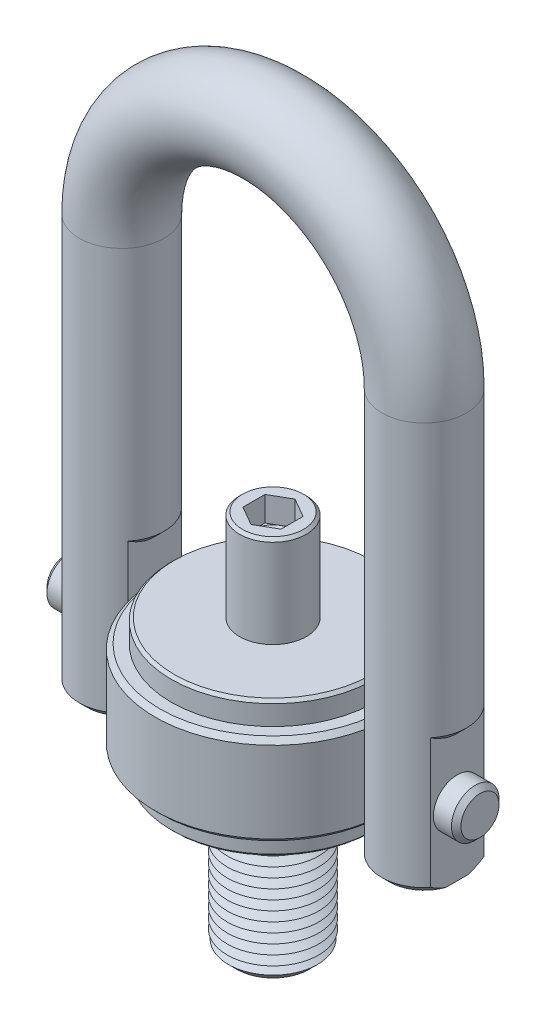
ISO-10303-21;
HEADER;
FILE_DESCRIPTION(('STEP AP214'),'2;1');
FILE_NAME('part.step','',(''),(''),'','','');
FILE_SCHEMA(('AUTOMOTIVE_DESIGN { 1 0 10303 214 1 1 1 1 }'));
ENDSEC;
DATA;
#1=APPLICATION_CONTEXT('core data for automotive mechanical design processes');
#2=APPLICATION_PROTOCOL_DEFINITION('international standard','automotive_design',2000,#1);
#3=PRODUCT_CONTEXT('',#1,'mechanical');
#4=PRODUCT('Part','Part','',(#3));
#5=PRODUCT_RELATED_PRODUCT_CATEGORY('part','',(#4));
#6=PRODUCT_DEFINITION_FORMATION('','',#4);
#7=PRODUCT_DEFINITION_CONTEXT('part definition',#1,'design');
#8=PRODUCT_DEFINITION('design','',#6,#7);
#9=PRODUCT_DEFINITION_SHAPE('','',#8);
#10=(LENGTH_UNIT() NAMED_UNIT(*) SI_UNIT(.MILLI.,.METRE.));
#11=(NAMED_UNIT(*) PLANE_ANGLE_UNIT() SI_UNIT($,.RADIAN.));
#12=(NAMED_UNIT(*) SI_UNIT($,.STERADIAN.) SOLID_ANGLE_UNIT());
#13=UNCERTAINTY_MEASURE_WITH_UNIT(LENGTH_MEASURE(1.E-05),#10,'distance_accuracy_value','');
#14=(GEOMETRIC_REPRESENTATION_CONTEXT(3) GLOBAL_UNCERTAINTY_ASSIGNED_CONTEXT((#13)) GLOBAL_UNIT_ASSIGNED_CONTEXT((#10,
#11,#12)) REPRESENTATION_CONTEXT('',''));
#15=CARTESIAN_POINT('',(0.,0.,0.));
#16=DIRECTION('',(0.,0.,1.));
#17=DIRECTION('',(1.,0.,0.));
#18=AXIS2_PLACEMENT_3D('',#15,#16,#17);
#19=CARTESIAN_POINT('',(108.6,0.,0.));
#20=DIRECTION('',(-1.,0.,0.));
#21=DIRECTION('',(0.,0.,1.));
#22=AXIS2_PLACEMENT_3D('',#19,#20,#21);
#23=CYLINDRICAL_SURFACE('',#22,12.5);
#24=CARTESIAN_POINT('',(-106.1,0.,0.));
#25=DIRECTION('',(1.,0.,0.));
#26=DIRECTION('',(0.,0.,-1.));
#27=AXIS2_PLACEMENT_3D('',#24,#25,#26);
#28=CIRCLE('',#27,12.5);
#29=CARTESIAN_POINT('',(-106.1,0.,12.5));
#30=VERTEX_POINT('',#29);
#31=EDGE_CURVE('P0_E25',#30,#30,#28,.T.);
#32=CARTESIAN_POINT('',(106.1,0.,0.));
#33=DIRECTION('',(1.,0.,0.));
#34=DIRECTION('',(0.,0.,-1.));
#35=AXIS2_PLACEMENT_3D('',#32,#33,#34);
#36=CIRCLE('',#35,12.5);
#37=CARTESIAN_POINT('',(106.1,0.,12.5));
#38=VERTEX_POINT('',#37);
#39=EDGE_CURVE('P0_E29',#38,#38,#36,.F.);
#40=CARTESIAN_POINT('',(-106.1,0.,12.5));
#41=CARTESIAN_POINT('',(-103.889583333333,0.,12.5));
#42=CARTESIAN_POINT('',(-101.679166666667,0.,12.5));
#43=CARTESIAN_POINT('',(-97.2583333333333,0.,12.5));
#44=CARTESIAN_POINT('',(-95.0479166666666,0.,12.5));
#45=CARTESIAN_POINT('',(-90.6270833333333,0.,12.5));
#46=CARTESIAN_POINT('',(-88.4166666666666,0.,12.5));
#47=CARTESIAN_POINT('',(-83.9958333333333,0.,12.5));
#48=CARTESIAN_POINT('',(-81.7854166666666,0.,12.5));
#49=CARTESIAN_POINT('',(-77.3645833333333,0.,12.5));
#50=CARTESIAN_POINT('',(-75.1541666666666,0.,12.5));
#51=CARTESIAN_POINT('',(-70.7333333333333,0.,12.5));
#52=CARTESIAN_POINT('',(-68.5229166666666,0.,12.5));
#53=CARTESIAN_POINT('',(-64.1020833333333,0.,12.5));
#54=CARTESIAN_POINT('',(-61.8916666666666,0.,12.5));
#55=CARTESIAN_POINT('',(-57.4708333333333,0.,12.5));
#56=CARTESIAN_POINT('',(-55.2604166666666,0.,12.5));
#57=CARTESIAN_POINT('',(-50.8395833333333,0.,12.5));
#58=CARTESIAN_POINT('',(-48.6291666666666,0.,12.5));
#59=CARTESIAN_POINT('',(-44.2083333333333,0.,12.5));
#60=CARTESIAN_POINT('',(-41.9979166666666,0.,12.5));
#61=CARTESIAN_POINT('',(-37.5770833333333,0.,12.5));
#62=CARTESIAN_POINT('',(-35.3666666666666,0.,12.5));
#63=CARTESIAN_POINT('',(-30.9458333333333,0.,12.5));
#64=CARTESIAN_POINT('',(-28.7354166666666,0.,12.5));
#65=CARTESIAN_POINT('',(-24.3145833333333,0.,12.5));
#66=CARTESIAN_POINT('',(-22.1041666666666,0.,12.5));
#67=CARTESIAN_POINT('',(-17.6833333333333,0.,12.5));
#68=CARTESIAN_POINT('',(-15.4729166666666,0.,12.5));
#69=CARTESIAN_POINT('',(-11.0520833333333,0.,12.5));
#70=CARTESIAN_POINT('',(-8.84166666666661,0.,12.5));
#71=CARTESIAN_POINT('',(-4.42083333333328,0.,12.5));
#72=CARTESIAN_POINT('',(-2.21041666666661,0.,12.5));
#73=CARTESIAN_POINT('',(2.21041666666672,0.,12.5));
#74=CARTESIAN_POINT('',(4.42083333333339,0.,12.5));
#75=CARTESIAN_POINT('',(8.84166666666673,0.,12.5));
#76=CARTESIAN_POINT('',(11.0520833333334,0.,12.5));
#77=CARTESIAN_POINT('',(15.4729166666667,0.,12.5));
#78=CARTESIAN_POINT('',(17.6833333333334,0.,12.5));
#79=CARTESIAN_POINT('',(22.1041666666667,0.,12.5));
#80=CARTESIAN_POINT('',(24.3145833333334,0.,12.5));
#81=CARTESIAN_POINT('',(28.7354166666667,0.,12.5));
#82=CARTESIAN_POINT('',(30.9458333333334,0.,12.5));
#83=CARTESIAN_POINT('',(35.3666666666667,0.,12.5));
#84=CARTESIAN_POINT('',(37.5770833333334,0.,12.5));
#85=CARTESIAN_POINT('',(41.9979166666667,0.,12.5));
#86=CARTESIAN_POINT('',(44.2083333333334,0.,12.5));
#87=CARTESIAN_POINT('',(48.6291666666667,0.,12.5));
#88=CARTESIAN_POINT('',(50.8395833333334,0.,12.5));
#89=CARTESIAN_POINT('',(55.2604166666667,0.,12.5));
#90=CARTESIAN_POINT('',(57.4708333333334,0.,12.5));
#91=CARTESIAN_POINT('',(61.8916666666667,0.,12.5));
#92=CARTESIAN_POINT('',(64.1020833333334,0.,12.5));
#93=CARTESIAN_POINT('',(68.5229166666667,0.,12.5));
#94=CARTESIAN_POINT('',(70.7333333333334,0.,12.5));
#95=CARTESIAN_POINT('',(75.1541666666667,0.,12.5));
#96=CARTESIAN_POINT('',(77.3645833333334,0.,12.5));
#97=CARTESIAN_POINT('',(81.7854166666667,0.,12.5));
#98=CARTESIAN_POINT('',(83.9958333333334,0.,12.5));
#99=CARTESIAN_POINT('',(88.4166666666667,0.,12.5));
#100=CARTESIAN_POINT('',(90.6270833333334,0.,12.5));
#101=CARTESIAN_POINT('',(95.0479166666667,0.,12.5));
#102=CARTESIAN_POINT('',(97.2583333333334,0.,12.5));
#103=CARTESIAN_POINT('',(101.679166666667,0.,12.5));
#104=CARTESIAN_POINT('',(103.889583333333,0.,12.5));
#105=CARTESIAN_POINT('',(106.1,0.,12.5));
#106=B_SPLINE_CURVE_WITH_KNOTS('',3,(#40,#41,#42,#43,#44,#45,#46,#47,#48,#49,#50,#51,#52,#53,
#54,#55,#56,#57,#58,#59,#60,#61,#62,#63,#64,#65,#66,#67,#68,#69,#70,#71,#72,#73,#74,#75,#76,#77,
#78,#79,#80,#81,#82,#83,#84,#85,#86,#87,#88,#89,#90,#91,#92,#93,#94,#95,#96,#97,#98,#99,#100,
#101,#102,#103,#104,#105),.UNSPECIFIED.,.F.,.F.,(4,2,2,2,2,2,2,2,2,2,2,2,2,2,2,2,2,2,2,2,2,2,2,
2,2,2,2,2,2,2,2,2,4),(0.,6.63125,13.2625,19.89375,26.525,33.15625,39.7875,46.41875,53.05,
59.68125,66.3125,72.94375,79.575,86.20625,92.8375,99.46875,106.1,112.73125,119.3625,125.99375,
132.625,139.25625,145.8875,152.51875,159.15,165.78125,172.4125,179.04375,185.675,192.30625,
198.9375,205.56875,212.2),.UNSPECIFIED.);
#107=EDGE_CURVE('P0_BSEAM14',#30,#38,#106,.T.);
#108=ORIENTED_EDGE('',*,*,#31,.T.);
#109=ORIENTED_EDGE('',*,*,#39,.T.);
#110=ORIENTED_EDGE('',*,*,#107,.T.);
#111=ORIENTED_EDGE('',*,*,#107,.F.);
#112=EDGE_LOOP('',(#108,#110,#109,#111));
#113=FACE_BOUND('',#112,.T.);
#114=ADVANCED_FACE('P0_F14',(#113),#23,.T.);
#115=CARTESIAN_POINT('',(108.6,0.,0.));
#116=DIRECTION('',(1.,0.,0.));
#117=DIRECTION('',(0.,0.,-1.));
#118=AXIS2_PLACEMENT_3D('',#115,#116,#117);
#119=PLANE('',#118);
#120=CARTESIAN_POINT('',(108.6,0.,0.));
#121=DIRECTION('',(1.,0.,0.));
#122=DIRECTION('',(0.,0.,-1.));
#123=AXIS2_PLACEMENT_3D('',#120,#121,#122);
#124=CIRCLE('',#123,10.0000000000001);
#125=CARTESIAN_POINT('',(108.6,0.,-10.0000000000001));
#126=VERTEX_POINT('',#125);
#127=EDGE_CURVE('P0_E10',#126,#126,#124,.T.);
#128=ORIENTED_EDGE('',*,*,#127,.T.);
#129=EDGE_LOOP('',(#128));
#130=FACE_BOUND('',#129,.T.);
#131=ADVANCED_FACE('P0_F46',(#130),#119,.T.);
#132=CARTESIAN_POINT('',(-108.6,0.,0.));
#133=DIRECTION('',(1.,0.,0.));
#134=DIRECTION('',(0.,0.,-1.));
#135=AXIS2_PLACEMENT_3D('',#132,#133,#134);
#136=PLANE('',#135);
#137=CARTESIAN_POINT('',(-108.6,0.,0.));
#138=DIRECTION('',(1.,0.,0.));
#139=DIRECTION('',(0.,0.,-1.));
#140=AXIS2_PLACEMENT_3D('',#137,#138,#139);
#141=CIRCLE('',#140,9.9999999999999);
#142=CARTESIAN_POINT('',(-108.6,0.,-9.9999999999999));
#143=VERTEX_POINT('',#142);
#144=EDGE_CURVE('P0_E21',#143,#143,#141,.F.);
#145=ORIENTED_EDGE('',*,*,#144,.T.);
#146=EDGE_LOOP('',(#145));
#147=FACE_BOUND('',#146,.T.);
#148=ADVANCED_FACE('P0_F43',(#147),#136,.F.);
#149=CARTESIAN_POINT('',(-106.1,0.,0.));
#150=DIRECTION('',(1.,0.,0.));
#151=DIRECTION('',(0.,0.,-1.));
#152=AXIS2_PLACEMENT_3D('',#149,#150,#151);
#153=CONICAL_SURFACE('',#152,12.5,0.785398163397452);
#154=ORIENTED_EDGE('',*,*,#144,.F.);
#155=EDGE_LOOP('',(#154));
#156=FACE_BOUND('',#155,.T.);
#157=ORIENTED_EDGE('',*,*,#31,.F.);
#158=EDGE_LOOP('',(#157));
#159=FACE_BOUND('',#158,.T.);
#160=ADVANCED_FACE('P0_F38',(#156,#159),#153,.T.);
#161=CARTESIAN_POINT('',(108.6,0.,0.));
#162=DIRECTION('',(-1.,0.,0.));
#163=DIRECTION('',(0.,0.,1.));
#164=AXIS2_PLACEMENT_3D('',#161,#162,#163);
#165=CONICAL_SURFACE('',#164,10.0000000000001,0.785398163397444);
#166=ORIENTED_EDGE('',*,*,#39,.F.);
#167=EDGE_LOOP('',(#166));
#168=FACE_BOUND('',#167,.T.);
#169=ORIENTED_EDGE('',*,*,#127,.F.);
#170=EDGE_LOOP('',(#169));
#171=FACE_BOUND('',#170,.T.);
#172=ADVANCED_FACE('P0_F16',(#168,#171),#165,.T.);
#173=CLOSED_SHELL('',(#114,#131,#148,#160,#172));
#174=MANIFOLD_SOLID_BREP('P0_B1',#173);
#175=CARTESIAN_POINT('',(79.3500000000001,-35.6999999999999,0.));
#176=DIRECTION('',(0.,-1.,0.));
#177=DIRECTION('',(0.,0.,1.));
#178=AXIS2_PLACEMENT_3D('',#175,#176,#177);
#179=PLANE('',#178);
#180=DIRECTION('',(0.,0.,-1.));
#181=VECTOR('',#180,1.);
#182=CARTESIAN_POINT('',(62.0565763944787,-35.7,14.));
#183=LINE('',#182,#181);
#184=CARTESIAN_POINT('',(62.0565763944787,-35.7,5.83095189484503));
#185=VERTEX_POINT('',#184);
#186=CARTESIAN_POINT('',(62.0565763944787,-35.7,-5.83095189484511));
#187=VERTEX_POINT('',#186);
#188=EDGE_CURVE('P1_E132',#185,#187,#183,.T.);
#189=ORIENTED_EDGE('',*,*,#188,.T.);
#190=CARTESIAN_POINT('',(79.3500000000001,-35.6999999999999,0.));
#191=DIRECTION('',(0.,-1.,0.));
#192=DIRECTION('',(1.,0.,0.));
#193=AXIS2_PLACEMENT_3D('',#190,#191,#192);
#194=CIRCLE('',#193,18.25);
#195=CARTESIAN_POINT('',(96.6434236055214,-35.7,-5.83095189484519));
#196=VERTEX_POINT('',#195);
#197=EDGE_CURVE('P1_E192',#187,#196,#194,.T.);
#198=ORIENTED_EDGE('',*,*,#197,.T.);
#199=DIRECTION('',(0.,0.,1.));
#200=VECTOR('',#199,1.);
#201=CARTESIAN_POINT('',(96.6434236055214,-35.7,14.));
#202=LINE('',#201,#200);
#203=CARTESIAN_POINT('',(96.6434236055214,-35.7,5.83095189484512));
#204=VERTEX_POINT('',#203);
#205=EDGE_CURVE('P1_E315',#196,#204,#202,.T.);
#206=ORIENTED_EDGE('',*,*,#205,.T.);
#207=CARTESIAN_POINT('',(79.3500000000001,-35.6999999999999,0.));
#208=DIRECTION('',(0.,-1.,0.));
#209=DIRECTION('',(1.,0.,0.));
#210=AXIS2_PLACEMENT_3D('',#207,#208,#209);
#211=CIRCLE('',#210,18.25);
#212=CARTESIAN_POINT('',(79.3500000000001,-35.6999999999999,18.25));
#213=VERTEX_POINT('',#212);
#214=EDGE_CURVE('P1_E370',#204,#213,#211,.T.);
#215=ORIENTED_EDGE('',*,*,#214,.T.);
#216=CARTESIAN_POINT('',(79.3500000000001,-35.6999999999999,0.));
#217=DIRECTION('',(0.,-1.,0.));
#218=DIRECTION('',(1.,0.,0.));
#219=AXIS2_PLACEMENT_3D('',#216,#217,#218);
#220=CIRCLE('',#219,18.25);
#221=EDGE_CURVE('P1_E369',#213,#185,#220,.T.);
#222=ORIENTED_EDGE('',*,*,#221,.T.);
#223=EDGE_LOOP('',(#189,#198,#206,#215,#222));
#224=FACE_BOUND('',#223,.T.);
#225=ADVANCED_FACE('P1_F16',(#224),#179,.T.);
#226=CARTESIAN_POINT('',(79.35,179.4,0.));
#227=DIRECTION('',(0.,-1.,0.));
#228=DIRECTION('',(1.,0.,0.));
#229=AXIS2_PLACEMENT_3D('',#226,#227,#228);
#230=CYLINDRICAL_SURFACE('',#229,22.25);
#231=CARTESIAN_POINT('',(79.35,179.4,0.));
#232=DIRECTION('',(0.,-1.,0.));
#233=DIRECTION('',(0.,0.,1.));
#234=AXIS2_PLACEMENT_3D('',#231,#232,#233);
#235=CIRCLE('',#234,22.25);
#236=CARTESIAN_POINT('',(101.6,179.4,0.));
#237=VERTEX_POINT('',#236);
#238=EDGE_CURVE('P1_E143',#237,#237,#235,.T.);
#239=ORIENTED_EDGE('',*,*,#238,.T.);
#240=EDGE_LOOP('',(#239));
#241=FACE_BOUND('',#240,.T.);
#242=DIRECTION('',(0.,-1.,0.));
#243=VECTOR('',#242,1.);
#244=CARTESIAN_POINT('',(96.6434236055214,29.3,-14.));
#245=LINE('',#244,#243);
#246=CARTESIAN_POINT('',(96.6434236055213,36.3000000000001,-14.));
#247=VERTEX_POINT('',#246);
#248=CARTESIAN_POINT('',(96.6434236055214,-31.6999999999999,-14.));
#249=VERTEX_POINT('',#248);
#250=EDGE_CURVE('P1_E328',#247,#249,#245,.T.);
#251=ORIENTED_EDGE('',*,*,#250,.T.);
#252=CARTESIAN_POINT('',(79.3500000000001,-31.6999999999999,0.));
#253=DIRECTION('',(0.,-1.,0.));
#254=DIRECTION('',(0.,0.,-1.));
#255=AXIS2_PLACEMENT_3D('',#252,#253,#254);
#256=CIRCLE('',#255,22.25);
#257=CARTESIAN_POINT('',(62.0565763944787,-31.6999999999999,-14.));
#258=VERTEX_POINT('',#257);
#259=EDGE_CURVE('P1_E128',#249,#258,#256,.F.);
#260=ORIENTED_EDGE('',*,*,#259,.T.);
#261=DIRECTION('',(0.,-1.,0.));
#262=VECTOR('',#261,1.);
#263=CARTESIAN_POINT('',(62.0565763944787,39.3,-14.));
#264=LINE('',#263,#262);
#265=CARTESIAN_POINT('',(62.0565763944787,46.3000000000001,-14.));
#266=VERTEX_POINT('',#265);
#267=EDGE_CURVE('P1_E120',#266,#258,#264,.T.);
#268=ORIENTED_EDGE('',*,*,#267,.F.);
#269=CARTESIAN_POINT('',(79.35,46.3000000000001,0.));
#270=DIRECTION('',(0.,-1.,0.));
#271=DIRECTION('',(0.,0.,-1.));
#272=AXIS2_PLACEMENT_3D('',#269,#270,#271);
#273=CIRCLE('',#272,22.25);
#274=CARTESIAN_POINT('',(62.0565763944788,46.3000000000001,14.));
#275=VERTEX_POINT('',#274);
#276=EDGE_CURVE('P1_E126',#266,#275,#273,.F.);
#277=ORIENTED_EDGE('',*,*,#276,.T.);
#278=DIRECTION('',(0.,-1.,0.));
#279=VECTOR('',#278,1.);
#280=CARTESIAN_POINT('',(62.0565763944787,39.3,14.));
#281=LINE('',#280,#279);
#282=CARTESIAN_POINT('',(62.0565763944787,-31.6999999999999,14.));
#283=VERTEX_POINT('',#282);
#284=EDGE_CURVE('P1_E131',#275,#283,#281,.T.);
#285=ORIENTED_EDGE('',*,*,#284,.T.);
#286=CARTESIAN_POINT('',(79.3500000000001,-31.6999999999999,0.));
#287=DIRECTION('',(0.,-1.,0.));
#288=DIRECTION('',(0.,0.,-1.));
#289=AXIS2_PLACEMENT_3D('',#286,#287,#288);
#290=CIRCLE('',#289,22.25);
#291=CARTESIAN_POINT('',(79.3500000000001,-31.6999999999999,22.25));
#292=VERTEX_POINT('',#291);
#293=EDGE_CURVE('P1_E530',#283,#292,#290,.F.);
#294=ORIENTED_EDGE('',*,*,#293,.T.);
#295=CARTESIAN_POINT('',(79.3500000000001,-31.6999999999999,0.));
#296=DIRECTION('',(0.,-1.,0.));
#297=DIRECTION('',(0.,0.,-1.));
#298=AXIS2_PLACEMENT_3D('',#295,#296,#297);
#299=CIRCLE('',#298,22.25);
#300=CARTESIAN_POINT('',(96.6434236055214,-31.6999999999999,14.));
#301=VERTEX_POINT('',#300);
#302=EDGE_CURVE('P1_E528',#292,#301,#299,.F.);
#303=ORIENTED_EDGE('',*,*,#302,.T.);
#304=DIRECTION('',(0.,-1.,0.));
#305=VECTOR('',#304,1.);
#306=CARTESIAN_POINT('',(96.6434236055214,29.3,14.));
#307=LINE('',#306,#305);
#308=CARTESIAN_POINT('',(96.6434236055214,36.3000000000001,14.));
#309=VERTEX_POINT('',#308);
#310=EDGE_CURVE('P1_E327',#309,#301,#307,.T.);
#311=ORIENTED_EDGE('',*,*,#310,.F.);
#312=CARTESIAN_POINT('',(79.35,36.3000000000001,0.));
#313=DIRECTION('',(0.,-1.,0.));
#314=DIRECTION('',(0.,0.,-1.));
#315=AXIS2_PLACEMENT_3D('',#312,#313,#314);
#316=CIRCLE('',#315,22.25);
#317=EDGE_CURVE('P1_E142',#309,#247,#316,.F.);
#318=ORIENTED_EDGE('',*,*,#317,.T.);
#319=EDGE_LOOP('',(#251,#260,#268,#277,#285,#294,#303,#311,#318));
#320=FACE_BOUND('',#319,.T.);
#321=ADVANCED_FACE('P1_F123',(#241,#320),#230,.T.);
#322=CARTESIAN_POINT('',(-79.3500000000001,-35.7,0.));
#323=DIRECTION('',(0.,1.,0.));
#324=DIRECTION('',(0.,0.,1.));
#325=AXIS2_PLACEMENT_3D('',#322,#323,#324);
#326=PLANE('',#325);
#327=DIRECTION('',(0.,0.,1.));
#328=VECTOR('',#327,1.);
#329=CARTESIAN_POINT('',(-96.6434236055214,-35.7,14.));
#330=LINE('',#329,#328);
#331=CARTESIAN_POINT('',(-96.6434236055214,-35.7,-5.83095189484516));
#332=VERTEX_POINT('',#331);
#333=CARTESIAN_POINT('',(-96.6434236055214,-35.7,5.83095189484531));
#334=VERTEX_POINT('',#333);
#335=EDGE_CURVE('P1_E334',#332,#334,#330,.T.);
#336=ORIENTED_EDGE('',*,*,#335,.F.);
#337=CARTESIAN_POINT('',(-79.3500000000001,-35.7,0.));
#338=DIRECTION('',(0.,1.,0.));
#339=DIRECTION('',(0.,0.,1.));
#340=AXIS2_PLACEMENT_3D('',#337,#338,#339);
#341=CIRCLE('',#340,18.25);
#342=CARTESIAN_POINT('',(-62.0565763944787,-35.7,-5.83095189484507));
#343=VERTEX_POINT('',#342);
#344=EDGE_CURVE('P1_E40',#332,#343,#341,.F.);
#345=ORIENTED_EDGE('',*,*,#344,.T.);
#346=DIRECTION('',(0.,0.,-1.));
#347=VECTOR('',#346,1.);
#348=CARTESIAN_POINT('',(-62.0565763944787,-35.7,14.));
#349=LINE('',#348,#347);
#350=CARTESIAN_POINT('',(-62.0565763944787,-35.7,5.83095189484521));
#351=VERTEX_POINT('',#350);
#352=EDGE_CURVE('P1_E303',#351,#343,#349,.T.);
#353=ORIENTED_EDGE('',*,*,#352,.F.);
#354=CARTESIAN_POINT('',(-79.3500000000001,-35.7,0.));
#355=DIRECTION('',(0.,1.,0.));
#356=DIRECTION('',(0.,0.,1.));
#357=AXIS2_PLACEMENT_3D('',#354,#355,#356);
#358=CIRCLE('',#357,18.25);
#359=CARTESIAN_POINT('',(-79.3500000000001,-35.7,18.25));
#360=VERTEX_POINT('',#359);
#361=EDGE_CURVE('P1_E34',#351,#360,#358,.F.);
#362=ORIENTED_EDGE('',*,*,#361,.T.);
#363=CARTESIAN_POINT('',(-79.3500000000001,-35.7,0.));
#364=DIRECTION('',(0.,1.,0.));
#365=DIRECTION('',(0.,0.,1.));
#366=AXIS2_PLACEMENT_3D('',#363,#364,#365);
#367=CIRCLE('',#366,18.25);
#368=EDGE_CURVE('P1_E298',#360,#334,#367,.F.);
#369=ORIENTED_EDGE('',*,*,#368,.T.);
#370=EDGE_LOOP('',(#336,#345,#353,#362,#369));
#371=FACE_BOUND('',#370,.T.);
#372=ADVANCED_FACE('P1_F239',(#371),#326,.F.);
#373=CARTESIAN_POINT('',(-79.3500000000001,-35.7,0.));
#374=DIRECTION('',(0.,1.,0.));
#375=DIRECTION('',(-1.,0.,0.));
#376=AXIS2_PLACEMENT_3D('',#373,#374,#375);
#377=CYLINDRICAL_SURFACE('',#376,22.25);
#378=DIRECTION('',(0.,-1.,0.));
#379=VECTOR('',#378,1.);
#380=CARTESIAN_POINT('',(-62.0565763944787,39.3,-14.));
#381=LINE('',#380,#379);
#382=CARTESIAN_POINT('',(-62.0565763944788,46.3,-14.));
#383=VERTEX_POINT('',#382);
#384=CARTESIAN_POINT('',(-62.0565763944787,-31.7,-14.));
#385=VERTEX_POINT('',#384);
#386=EDGE_CURVE('P1_E340',#383,#385,#381,.T.);
#387=ORIENTED_EDGE('',*,*,#386,.T.);
#388=CARTESIAN_POINT('',(-79.3500000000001,-31.7,0.));
#389=DIRECTION('',(0.,1.,0.));
#390=DIRECTION('',(0.,0.,1.));
#391=AXIS2_PLACEMENT_3D('',#388,#389,#390);
#392=CIRCLE('',#391,22.25);
#393=CARTESIAN_POINT('',(-96.6434236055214,-31.7,-14.));
#394=VERTEX_POINT('',#393);
#395=EDGE_CURVE('P1_E287',#385,#394,#392,.T.);
#396=ORIENTED_EDGE('',*,*,#395,.T.);
#397=DIRECTION('',(0.,-1.,0.));
#398=VECTOR('',#397,1.);
#399=CARTESIAN_POINT('',(-96.6434236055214,29.3,-14.));
#400=LINE('',#399,#398);
#401=CARTESIAN_POINT('',(-96.6434236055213,36.3000000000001,-14.));
#402=VERTEX_POINT('',#401);
#403=EDGE_CURVE('P1_E337',#402,#394,#400,.T.);
#404=ORIENTED_EDGE('',*,*,#403,.F.);
#405=CARTESIAN_POINT('',(-79.35,36.3000000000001,0.));
#406=DIRECTION('',(0.,-1.,0.));
#407=DIRECTION('',(0.,0.,-1.));
#408=AXIS2_PLACEMENT_3D('',#405,#406,#407);
#409=CIRCLE('',#408,22.25);
#410=CARTESIAN_POINT('',(-96.6434236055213,36.3000000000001,14.));
#411=VERTEX_POINT('',#410);
#412=EDGE_CURVE('P1_E146',#402,#411,#409,.F.);
#413=ORIENTED_EDGE('',*,*,#412,.T.);
#414=DIRECTION('',(0.,-1.,0.));
#415=VECTOR('',#414,1.);
#416=CARTESIAN_POINT('',(-96.6434236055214,29.3,14.));
#417=LINE('',#416,#415);
#418=CARTESIAN_POINT('',(-96.6434236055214,-31.7000000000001,14.));
#419=VERTEX_POINT('',#418);
#420=EDGE_CURVE('P1_E308',#411,#419,#417,.T.);
#421=ORIENTED_EDGE('',*,*,#420,.T.);
#422=CARTESIAN_POINT('',(-79.3500000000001,-31.7000000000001,0.));
#423=DIRECTION('',(0.,1.,0.));
#424=DIRECTION('',(0.,0.,1.));
#425=AXIS2_PLACEMENT_3D('',#422,#423,#424);
#426=CIRCLE('',#425,22.25);
#427=CARTESIAN_POINT('',(-79.3500000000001,-31.7000000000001,22.25));
#428=VERTEX_POINT('',#427);
#429=EDGE_CURVE('P1_E284',#419,#428,#426,.T.);
#430=ORIENTED_EDGE('',*,*,#429,.T.);
#431=CARTESIAN_POINT('',(-79.3500000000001,-31.7000000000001,0.));
#432=DIRECTION('',(0.,1.,0.));
#433=DIRECTION('',(0.,0.,1.));
#434=AXIS2_PLACEMENT_3D('',#431,#432,#433);
#435=CIRCLE('',#434,22.25);
#436=CARTESIAN_POINT('',(-62.0565763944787,-31.7000000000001,14.));
#437=VERTEX_POINT('',#436);
#438=EDGE_CURVE('P1_E277',#428,#437,#435,.T.);
#439=ORIENTED_EDGE('',*,*,#438,.T.);
#440=DIRECTION('',(0.,-1.,0.));
#441=VECTOR('',#440,1.);
#442=CARTESIAN_POINT('',(-62.0565763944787,39.3,14.));
#443=LINE('',#442,#441);
#444=CARTESIAN_POINT('',(-62.0565763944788,46.3,14.));
#445=VERTEX_POINT('',#444);
#446=EDGE_CURVE('P1_E305',#445,#437,#443,.T.);
#447=ORIENTED_EDGE('',*,*,#446,.F.);
#448=CARTESIAN_POINT('',(-79.35,46.3,0.));
#449=DIRECTION('',(0.,-1.,0.));
#450=DIRECTION('',(0.,0.,-1.));
#451=AXIS2_PLACEMENT_3D('',#448,#449,#450);
#452=CIRCLE('',#451,22.25);
#453=EDGE_CURVE('P1_E155',#445,#383,#452,.F.);
#454=ORIENTED_EDGE('',*,*,#453,.T.);
#455=EDGE_LOOP('',(#387,#396,#404,#413,#421,#430,#439,#447,#454));
#456=FACE_BOUND('',#455,.T.);
#457=CARTESIAN_POINT('',(-79.35,179.4,0.));
#458=DIRECTION('',(0.,1.,0.));
#459=DIRECTION('',(0.,0.,1.));
#460=AXIS2_PLACEMENT_3D('',#457,#458,#459);
#461=CIRCLE('',#460,22.25);
#462=CARTESIAN_POINT('',(-101.6,179.4,0.));
#463=VERTEX_POINT('',#462);
#464=EDGE_CURVE('P1_E149',#463,#463,#461,.T.);
#465=ORIENTED_EDGE('',*,*,#464,.F.);
#466=EDGE_LOOP('',(#465));
#467=FACE_BOUND('',#466,.T.);
#468=ADVANCED_FACE('P1_F241',(#456,#467),#377,.T.);
#469=CARTESIAN_POINT('',(0.,179.4,0.));
#470=DIRECTION('',(0.,0.,-1.));
#471=DIRECTION('',(-1.,0.,0.));
#472=AXIS2_PLACEMENT_3D('',#469,#470,#471);
#473=TOROIDAL_SURFACE('',#472,79.35,22.25);
#474=CARTESIAN_POINT('',(0.,179.4,0.));
#475=DIRECTION('',(0.,0.,-1.));
#476=DIRECTION('',(-1.,0.,0.));
#477=AXIS2_PLACEMENT_3D('',#474,#475,#476);
#478=CIRCLE('',#477,101.6);
#479=EDGE_CURVE('',#463,#237,#478,.T.);
#480=ORIENTED_EDGE('',*,*,#464,.T.);
#481=ORIENTED_EDGE('',*,*,#238,.F.);
#482=ORIENTED_EDGE('',*,*,#479,.T.);
#483=ORIENTED_EDGE('',*,*,#479,.F.);
#484=EDGE_LOOP('',(#480,#482,#481,#483));
#485=FACE_BOUND('',#484,.T.);
#486=ADVANCED_FACE('P1_F237',(#485),#473,.T.);
#487=CARTESIAN_POINT('',(-62.0565763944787,39.3,14.));
#488=DIRECTION('',(-1.,0.,0.));
#489=DIRECTION('',(0.,0.,1.));
#490=AXIS2_PLACEMENT_3D('',#487,#488,#489);
#491=PLANE('',#490);
#492=CARTESIAN_POINT('',(-62.0565763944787,0.,0.));
#493=DIRECTION('',(-1.,0.,0.));
#494=DIRECTION('',(0.,0.,1.));
#495=AXIS2_PLACEMENT_3D('',#492,#493,#494);
#496=CIRCLE('',#495,12.5);
#497=CARTESIAN_POINT('',(-62.0565763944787,0.,12.5));
#498=VERTEX_POINT('',#497);
#499=EDGE_CURVE('P1_E313',#498,#498,#496,.T.);
#500=ORIENTED_EDGE('',*,*,#499,.T.);
#501=EDGE_LOOP('',(#500));
#502=FACE_BOUND('',#501,.T.);
#503=ORIENTED_EDGE('',*,*,#352,.T.);
#504=CARTESIAN_POINT('',(-62.0565763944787,-35.7,-5.83095189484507));
#505=CARTESIAN_POINT('',(-62.0565763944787,-35.58398574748,-6.19401937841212));
#506=CARTESIAN_POINT('',(-62.0565763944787,-35.4591933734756,-6.55418682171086));
#507=CARTESIAN_POINT('',(-62.0565763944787,-35.1940757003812,-7.26858296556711));
#508=CARTESIAN_POINT('',(-62.0565763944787,-35.0537576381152,-7.62281434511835));
#509=CARTESIAN_POINT('',(-62.0565763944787,-34.7600585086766,-8.32420425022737));
#510=CARTESIAN_POINT('',(-62.0565763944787,-34.6067289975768,-8.67138450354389));
#511=CARTESIAN_POINT('',(-62.0565763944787,-34.2882447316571,-9.36031187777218));
#512=CARTESIAN_POINT('',(-62.0565763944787,-34.1230885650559,-9.70205834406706));
#513=CARTESIAN_POINT('',(-62.0565763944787,-33.7827181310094,-10.3799111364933));
#514=CARTESIAN_POINT('',(-62.0565763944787,-33.6075177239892,-10.7160244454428));
#515=CARTESIAN_POINT('',(-62.0565763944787,-33.2481701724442,-11.3834225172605));
#516=CARTESIAN_POINT('',(-62.0565763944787,-33.0640230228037,-11.7147072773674));
#517=CARTESIAN_POINT('',(-62.0565763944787,-32.6871902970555,-12.3740913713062));
#518=CARTESIAN_POINT('',(-62.0565763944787,-32.494474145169,-12.702173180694));
#519=CARTESIAN_POINT('',(-62.0565763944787,-32.1021630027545,-13.3541357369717));
#520=CARTESIAN_POINT('',(-62.0565763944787,-31.9025690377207,-13.6780171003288));
#521=CARTESIAN_POINT('',(-62.0565763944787,-31.7,-14.));
#522=B_SPLINE_CURVE_WITH_KNOTS('',3,(#504,#505,#506,#507,#508,#509,#510,#511,#512,#513,#514,
#515,#516,#517,#518,#519,#520,#521),.UNSPECIFIED.,.F.,.F.,(4,2,2,2,2,2,2,2,4),(0.,
1.14321450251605,2.28589835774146,3.42424887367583,4.56273550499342,5.69968723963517,
6.83663962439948,7.97803842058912,9.11926776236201),.UNSPECIFIED.);
#523=EDGE_CURVE('P1_E11',#343,#385,#522,.T.);
#524=ORIENTED_EDGE('',*,*,#523,.T.);
#525=ORIENTED_EDGE('',*,*,#386,.F.);
#526=CARTESIAN_POINT('',(-62.0565763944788,46.3,-14.));
#527=CARTESIAN_POINT('',(-62.0565763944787,46.08757975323,-13.6623513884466));
#528=CARTESIAN_POINT('',(-62.0565763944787,45.8784256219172,-13.3226161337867));
#529=CARTESIAN_POINT('',(-62.0565763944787,45.4677120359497,-12.638478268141));
#530=CARTESIAN_POINT('',(-62.0565763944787,45.2661544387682,-12.294074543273));
#531=CARTESIAN_POINT('',(-62.0565763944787,44.8709431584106,-11.598760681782));
#532=CARTESIAN_POINT('',(-62.0565763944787,44.6773276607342,-11.2478287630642));
#533=CARTESIAN_POINT('',(-62.0565763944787,44.3003266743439,-10.5405310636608));
#534=CARTESIAN_POINT('',(-62.0565763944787,44.1169405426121,-10.1841656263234));
#535=CARTESIAN_POINT('',(-62.0565763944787,43.7584088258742,-9.45835090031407));
#536=CARTESIAN_POINT('',(-62.0565763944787,43.5835025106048,-9.08878256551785));
#537=CARTESIAN_POINT('',(-62.0565763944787,43.2479479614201,-8.34323555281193));
#538=CARTESIAN_POINT('',(-62.0565763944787,43.0873009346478,-7.96725633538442));
#539=CARTESIAN_POINT('',(-62.0565763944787,42.6305688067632,-6.83050144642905));
#540=CARTESIAN_POINT('',(-62.0565763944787,42.3589507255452,-6.05944377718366));
#541=CARTESIAN_POINT('',(-62.0565763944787,41.9844305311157,-4.77597443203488));
#542=CARTESIAN_POINT('',(-62.0565763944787,41.8560447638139,-4.27094970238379));
#543=CARTESIAN_POINT('',(-62.0565763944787,41.6395093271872,-3.25203170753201));
#544=CARTESIAN_POINT('',(-62.0565763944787,41.5513652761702,-2.7381372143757));
#545=CARTESIAN_POINT('',(-62.0565763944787,41.4528477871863,-1.96507741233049));
#546=CARTESIAN_POINT('',(-62.0565763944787,41.4256638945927,-1.70796920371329));
#547=CARTESIAN_POINT('',(-62.0565763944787,41.3826139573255,-1.19281542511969));
#548=CARTESIAN_POINT('',(-62.0565763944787,41.3667466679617,-0.934769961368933));
#549=CARTESIAN_POINT('',(-62.0565763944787,41.3465580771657,-0.418324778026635));
#550=CARTESIAN_POINT('',(-62.0565763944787,41.3422326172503,-0.159925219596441));
#551=CARTESIAN_POINT('',(-62.0565763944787,41.3451748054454,0.356781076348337));
#552=CARTESIAN_POINT('',(-62.0565763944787,41.3524409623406,0.615087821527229));
#553=CARTESIAN_POINT('',(-62.0565763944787,41.374195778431,1.04656254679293));
#554=CARTESIAN_POINT('',(-62.0565763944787,41.3855379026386,1.21989565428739));
#555=CARTESIAN_POINT('',(-62.0565763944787,41.4133359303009,1.56611318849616));
#556=CARTESIAN_POINT('',(-62.0565763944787,41.4297908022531,1.73899769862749));
#557=CARTESIAN_POINT('',(-62.0565763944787,41.4867069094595,2.25698800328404));
#558=CARTESIAN_POINT('',(-62.0565763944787,41.534712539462,2.60129233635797));
#559=CARTESIAN_POINT('',(-62.0565763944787,41.6449454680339,3.25816008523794));
#560=CARTESIAN_POINT('',(-62.0565763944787,41.7056579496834,3.57098183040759));
#561=CARTESIAN_POINT('',(-62.0565763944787,41.8419839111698,4.19337992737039));
#562=CARTESIAN_POINT('',(-62.0565763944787,41.9175993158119,4.50295585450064));
#563=CARTESIAN_POINT('',(-62.0565763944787,42.1651494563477,5.42660328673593));
#564=CARTESIAN_POINT('',(-62.0565763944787,42.3577203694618,6.03520640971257));
#565=CARTESIAN_POINT('',(-62.0565763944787,42.7889374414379,7.23901181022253));
#566=CARTESIAN_POINT('',(-62.0565763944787,43.0278137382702,7.83412984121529));
#567=CARTESIAN_POINT('',(-62.0565763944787,43.5418111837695,9.00813965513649));
#568=CARTESIAN_POINT('',(-62.0565763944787,43.816922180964,9.58703592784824));
#569=CARTESIAN_POINT('',(-62.0565763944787,44.4412729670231,10.8197450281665));
#570=CARTESIAN_POINT('',(-62.0565763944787,44.7953732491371,11.4710810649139));
#571=CARTESIAN_POINT('',(-62.0565763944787,45.3468078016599,12.4321853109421));
#572=CARTESIAN_POINT('',(-62.0565763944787,45.5330544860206,12.7484170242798));
#573=CARTESIAN_POINT('',(-62.0565763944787,45.91193665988,13.3770161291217));
#574=CARTESIAN_POINT('',(-62.0565763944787,46.1045718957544,13.6893836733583));
#575=CARTESIAN_POINT('',(-62.0565763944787,46.3000000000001,14.));
#576=B_SPLINE_CURVE_WITH_KNOTS('',3,(#526,#527,#528,#529,#530,#531,#532,#533,#534,#535,#536,
#537,#538,#539,#540,#541,#542,#543,#544,#545,#546,#547,#548,#549,#550,#551,#552,#553,#554,#555,
#556,#557,#558,#559,#560,#561,#562,#563,#564,#565,#566,#567,#568,#569,#570,#571,#572,#573,#574,
#575),.UNSPECIFIED.,.F.,.F.,(4,2,2,2,2,2,2,2,2,2,2,2,2,2,2,2,2,2,2,2,2,2,2,2,4),(0.,
1.19675006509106,2.39379088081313,3.59603752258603,4.79820850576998,6.02450807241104,
7.25091135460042,9.69880513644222,11.2607712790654,12.8229554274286,13.5983736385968,
14.3737065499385,15.1487600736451,15.9237138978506,16.444752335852,16.9656857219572,
18.0079671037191,18.9635650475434,19.919286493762,21.8319065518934,23.7542880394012,
25.6761320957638,27.8991558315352,29.0001061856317,30.1010128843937),.UNSPECIFIED.);
#577=EDGE_CURVE('P1_E138',#383,#445,#576,.T.);
#578=ORIENTED_EDGE('',*,*,#577,.T.);
#579=ORIENTED_EDGE('',*,*,#446,.T.);
#580=CARTESIAN_POINT('',(-62.0565763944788,-31.7000000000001,14.));
#581=CARTESIAN_POINT('',(-62.0565763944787,-31.9025690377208,13.6780171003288));
#582=CARTESIAN_POINT('',(-62.0565763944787,-32.1021630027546,13.3541357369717));
#583=CARTESIAN_POINT('',(-62.0565763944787,-32.4944741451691,12.702173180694));
#584=CARTESIAN_POINT('',(-62.0565763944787,-32.6871902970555,12.3740913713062));
#585=CARTESIAN_POINT('',(-62.0565763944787,-33.0640230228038,11.7147072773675));
#586=CARTESIAN_POINT('',(-62.0565763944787,-33.2481701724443,11.3834225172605));
#587=CARTESIAN_POINT('',(-62.0565763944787,-33.6075177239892,10.7160244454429));
#588=CARTESIAN_POINT('',(-62.0565763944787,-33.7827181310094,10.3799111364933));
#589=CARTESIAN_POINT('',(-62.0565763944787,-34.1230885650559,9.70205834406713));
#590=CARTESIAN_POINT('',(-62.0565763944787,-34.2882447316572,9.36031187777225));
#591=CARTESIAN_POINT('',(-62.0565763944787,-34.6067289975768,8.67138450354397));
#592=CARTESIAN_POINT('',(-62.0565763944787,-34.7600585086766,8.32420425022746));
#593=CARTESIAN_POINT('',(-62.0565763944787,-35.0537576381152,7.62281434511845));
#594=CARTESIAN_POINT('',(-62.0565763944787,-35.1940757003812,7.26858296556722));
#595=CARTESIAN_POINT('',(-62.0565763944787,-35.4591933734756,6.55418682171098));
#596=CARTESIAN_POINT('',(-62.0565763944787,-35.58398574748,6.19401937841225));
#597=CARTESIAN_POINT('',(-62.0565763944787,-35.7,5.83095189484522));
#598=B_SPLINE_CURVE_WITH_KNOTS('',3,(#580,#581,#582,#583,#584,#585,#586,#587,#588,#589,#590,
#591,#592,#593,#594,#595,#596,#597),.UNSPECIFIED.,.F.,.F.,(4,2,2,2,2,2,2,2,4),(0.,
1.14122934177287,2.28262813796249,3.41958052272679,4.55653225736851,5.69501888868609,
6.83336940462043,7.97605325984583,9.11926776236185),.UNSPECIFIED.);
#599=EDGE_CURVE('P1_E26',#437,#351,#598,.T.);
#600=ORIENTED_EDGE('',*,*,#599,.T.);
#601=EDGE_LOOP('',(#503,#524,#525,#578,#579,#600));
#602=FACE_BOUND('',#601,.T.);
#603=ADVANCED_FACE('P1_F232',(#502,#602),#491,.F.);
#604=CARTESIAN_POINT('',(-96.6434236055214,29.3,14.));
#605=DIRECTION('',(1.,0.,0.));
#606=DIRECTION('',(0.,0.,-1.));
#607=AXIS2_PLACEMENT_3D('',#604,#605,#606);
#608=PLANE('',#607);
#609=CARTESIAN_POINT('',(-96.6434236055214,0.,0.));
#610=DIRECTION('',(1.,0.,0.));
#611=DIRECTION('',(0.,0.,-1.));
#612=AXIS2_PLACEMENT_3D('',#609,#610,#611);
#613=CIRCLE('',#612,12.5);
#614=CARTESIAN_POINT('',(-96.6434236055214,0.,-12.5));
#615=VERTEX_POINT('',#614);
#616=EDGE_CURVE('P1_E321',#615,#615,#613,.F.);
#617=ORIENTED_EDGE('',*,*,#616,.F.);
#618=EDGE_LOOP('',(#617));
#619=FACE_BOUND('',#618,.T.);
#620=ORIENTED_EDGE('',*,*,#403,.T.);
#621=CARTESIAN_POINT('',(-96.6434236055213,-31.7,-14.));
#622=CARTESIAN_POINT('',(-96.6434236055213,-31.9025690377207,-13.6780171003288));
#623=CARTESIAN_POINT('',(-96.6434236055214,-32.1021630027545,-13.3541357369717));
#624=CARTESIAN_POINT('',(-96.6434236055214,-32.494474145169,-12.702173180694));
#625=CARTESIAN_POINT('',(-96.6434236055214,-32.6871902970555,-12.3740913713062));
#626=CARTESIAN_POINT('',(-96.6434236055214,-33.0640230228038,-11.7147072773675));
#627=CARTESIAN_POINT('',(-96.6434236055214,-33.2481701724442,-11.3834225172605));
#628=CARTESIAN_POINT('',(-96.6434236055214,-33.6075177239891,-10.7160244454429));
#629=CARTESIAN_POINT('',(-96.6434236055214,-33.7827181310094,-10.3799111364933));
#630=CARTESIAN_POINT('',(-96.6434236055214,-34.1230885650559,-9.70205834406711));
#631=CARTESIAN_POINT('',(-96.6434236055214,-34.2882447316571,-9.36031187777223));
#632=CARTESIAN_POINT('',(-96.6434236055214,-34.6067289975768,-8.67138450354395));
#633=CARTESIAN_POINT('',(-96.6434236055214,-34.7600585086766,-8.32420425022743));
#634=CARTESIAN_POINT('',(-96.6434236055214,-35.0537576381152,-7.62281434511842));
#635=CARTESIAN_POINT('',(-96.6434236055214,-35.1940757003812,-7.26858296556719));
#636=CARTESIAN_POINT('',(-96.6434236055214,-35.4591933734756,-6.55418682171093));
#637=CARTESIAN_POINT('',(-96.6434236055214,-35.58398574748,-6.1940193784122));
#638=CARTESIAN_POINT('',(-96.6434236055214,-35.7,-5.83095189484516));
#639=B_SPLINE_CURVE_WITH_KNOTS('',3,(#621,#622,#623,#624,#625,#626,#627,#628,#629,#630,#631,
#632,#633,#634,#635,#636,#637,#638),.UNSPECIFIED.,.F.,.F.,(4,2,2,2,2,2,2,2,4),(0.,
1.14122934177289,2.28262813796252,3.41958052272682,4.55653225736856,5.69501888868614,
6.8333694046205,7.97605325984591,9.11926776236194),.UNSPECIFIED.);
#640=EDGE_CURVE('P1_E216',#394,#332,#639,.T.);
#641=ORIENTED_EDGE('',*,*,#640,.T.);
#642=ORIENTED_EDGE('',*,*,#335,.T.);
#643=CARTESIAN_POINT('',(-96.6434236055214,-35.7,5.83095189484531));
#644=CARTESIAN_POINT('',(-96.6434236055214,-35.58398574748,6.19401937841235));
#645=CARTESIAN_POINT('',(-96.6434236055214,-35.4591933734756,6.55418682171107));
#646=CARTESIAN_POINT('',(-96.6434236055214,-35.1940757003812,7.26858296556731));
#647=CARTESIAN_POINT('',(-96.6434236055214,-35.0537576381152,7.62281434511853));
#648=CARTESIAN_POINT('',(-96.6434236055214,-34.7600585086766,8.32420425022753));
#649=CARTESIAN_POINT('',(-96.6434236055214,-34.6067289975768,8.67138450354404));
#650=CARTESIAN_POINT('',(-96.6434236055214,-34.2882447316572,9.36031187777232));
#651=CARTESIAN_POINT('',(-96.6434236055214,-34.1230885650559,9.70205834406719));
#652=CARTESIAN_POINT('',(-96.6434236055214,-33.7827181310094,10.3799111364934));
#653=CARTESIAN_POINT('',(-96.6434236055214,-33.6075177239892,10.7160244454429));
#654=CARTESIAN_POINT('',(-96.6434236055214,-33.2481701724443,11.3834225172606));
#655=CARTESIAN_POINT('',(-96.6434236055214,-33.0640230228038,11.7147072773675));
#656=CARTESIAN_POINT('',(-96.6434236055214,-32.6871902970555,12.3740913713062));
#657=CARTESIAN_POINT('',(-96.6434236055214,-32.4944741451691,12.702173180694));
#658=CARTESIAN_POINT('',(-96.6434236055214,-32.1021630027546,13.3541357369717));
#659=CARTESIAN_POINT('',(-96.6434236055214,-31.9025690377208,13.6780171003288));
#660=CARTESIAN_POINT('',(-96.6434236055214,-31.7,14.));
#661=B_SPLINE_CURVE_WITH_KNOTS('',3,(#643,#644,#645,#646,#647,#648,#649,#650,#651,#652,#653,
#654,#655,#656,#657,#658,#659,#660),.UNSPECIFIED.,.F.,.F.,(4,2,2,2,2,2,2,2,4),(0.,
1.14321450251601,2.2858983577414,3.42424887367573,4.5627355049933,5.69968723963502,
6.8366396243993,7.97803842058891,9.11926776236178),.UNSPECIFIED.);
#662=EDGE_CURVE('P1_E289',#334,#419,#661,.T.);
#663=ORIENTED_EDGE('',*,*,#662,.T.);
#664=ORIENTED_EDGE('',*,*,#420,.F.);
#665=CARTESIAN_POINT('',(-96.6434236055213,36.3000000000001,14.));
#666=CARTESIAN_POINT('',(-96.6434236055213,36.08757975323,13.6623513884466));
#667=CARTESIAN_POINT('',(-96.6434236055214,35.8784256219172,13.3226161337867));
#668=CARTESIAN_POINT('',(-96.6434236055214,35.4677120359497,12.638478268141));
#669=CARTESIAN_POINT('',(-96.6434236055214,35.2661544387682,12.294074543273));
#670=CARTESIAN_POINT('',(-96.6434236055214,34.8709431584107,11.598760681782));
#671=CARTESIAN_POINT('',(-96.6434236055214,34.6773276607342,11.2478287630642));
#672=CARTESIAN_POINT('',(-96.6434236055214,34.300326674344,10.5405310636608));
#673=CARTESIAN_POINT('',(-96.6434236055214,34.1169405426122,10.1841656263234));
#674=CARTESIAN_POINT('',(-96.6434236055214,33.7584088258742,9.45835090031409));
#675=CARTESIAN_POINT('',(-96.6434236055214,33.5835025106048,9.08878256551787));
#676=CARTESIAN_POINT('',(-96.6434236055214,33.2479479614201,8.34323555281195));
#677=CARTESIAN_POINT('',(-96.6434236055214,33.0873009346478,7.96725633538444));
#678=CARTESIAN_POINT('',(-96.6434236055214,32.6305688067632,6.83050144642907));
#679=CARTESIAN_POINT('',(-96.6434236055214,32.3589507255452,6.05944377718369));
#680=CARTESIAN_POINT('',(-96.6434236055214,31.9844305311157,4.77597443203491));
#681=CARTESIAN_POINT('',(-96.6434236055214,31.8560447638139,4.27094970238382));
#682=CARTESIAN_POINT('',(-96.6434236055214,31.6395093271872,3.25203170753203));
#683=CARTESIAN_POINT('',(-96.6434236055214,31.5513652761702,2.73813721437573));
#684=CARTESIAN_POINT('',(-96.6434236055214,31.4528477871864,1.96507741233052));
#685=CARTESIAN_POINT('',(-96.6434236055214,31.4256638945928,1.70796920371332));
#686=CARTESIAN_POINT('',(-96.6434236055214,31.3826139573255,1.19281542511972));
#687=CARTESIAN_POINT('',(-96.6434236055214,31.3667466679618,0.934769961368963));
#688=CARTESIAN_POINT('',(-96.6434236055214,31.3465580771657,0.418324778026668));
#689=CARTESIAN_POINT('',(-96.6434236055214,31.3422326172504,0.159925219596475));
#690=CARTESIAN_POINT('',(-96.6434236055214,31.3451748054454,-0.356781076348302));
#691=CARTESIAN_POINT('',(-96.6434236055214,31.3524409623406,-0.615087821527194));
#692=CARTESIAN_POINT('',(-96.6434236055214,31.374195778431,-1.0465625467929));
#693=CARTESIAN_POINT('',(-96.6434236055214,31.3855379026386,-1.21989565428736));
#694=CARTESIAN_POINT('',(-96.6434236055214,31.4133359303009,-1.56611318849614));
#695=CARTESIAN_POINT('',(-96.6434236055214,31.4297908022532,-1.73899769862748));
#696=CARTESIAN_POINT('',(-96.6434236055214,31.4867069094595,-2.25698800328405));
#697=CARTESIAN_POINT('',(-96.6434236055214,31.534712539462,-2.60129233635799));
#698=CARTESIAN_POINT('',(-96.6434236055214,31.644945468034,-3.25816008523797));
#699=CARTESIAN_POINT('',(-96.6434236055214,31.7056579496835,-3.57098183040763));
#700=CARTESIAN_POINT('',(-96.6434236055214,31.8419839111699,-4.19337992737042));
#701=CARTESIAN_POINT('',(-96.6434236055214,31.9175993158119,-4.50295585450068));
#702=CARTESIAN_POINT('',(-96.6434236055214,32.1651494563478,-5.42660328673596));
#703=CARTESIAN_POINT('',(-96.6434236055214,32.3577203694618,-6.03520640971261));
#704=CARTESIAN_POINT('',(-96.6434236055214,32.7889374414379,-7.23901181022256));
#705=CARTESIAN_POINT('',(-96.6434236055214,33.0278137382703,-7.83412984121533));
#706=CARTESIAN_POINT('',(-96.6434236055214,33.5418111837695,-9.00813965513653));
#707=CARTESIAN_POINT('',(-96.6434236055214,33.816922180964,-9.58703592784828));
#708=CARTESIAN_POINT('',(-96.6434236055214,34.4412729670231,-10.8197450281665));
#709=CARTESIAN_POINT('',(-96.6434236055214,34.7953732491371,-11.4710810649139));
#710=CARTESIAN_POINT('',(-96.6434236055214,35.3468078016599,-12.4321853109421));
#711=CARTESIAN_POINT('',(-96.6434236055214,35.5330544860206,-12.7484170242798));
#712=CARTESIAN_POINT('',(-96.6434236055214,35.9119366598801,-13.3770161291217));
#713=CARTESIAN_POINT('',(-96.6434236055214,36.1045718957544,-13.6893836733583));
#714=CARTESIAN_POINT('',(-96.6434236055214,36.3000000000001,-14.));
#715=B_SPLINE_CURVE_WITH_KNOTS('',3,(#665,#666,#667,#668,#669,#670,#671,#672,#673,#674,#675,
#676,#677,#678,#679,#680,#681,#682,#683,#684,#685,#686,#687,#688,#689,#690,#691,#692,#693,#694,
#695,#696,#697,#698,#699,#700,#701,#702,#703,#704,#705,#706,#707,#708,#709,#710,#711,#712,#713,
#714),.UNSPECIFIED.,.F.,.F.,(4,2,2,2,2,2,2,2,2,2,2,2,2,2,2,2,2,2,2,2,2,2,2,2,4),(0.,
1.19675006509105,2.39379088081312,3.596037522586,4.79820850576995,6.024508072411,
7.25091135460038,9.69880513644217,11.2607712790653,12.8229554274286,13.5983736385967,
14.3737065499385,15.1487600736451,15.9237138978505,16.444752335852,16.9656857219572,
18.0079671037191,18.9635650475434,19.919286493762,21.8319065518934,23.7542880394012,
25.6761320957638,27.8991558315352,29.0001061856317,30.1010128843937),.UNSPECIFIED.);
#716=EDGE_CURVE('P1_E251',#411,#402,#715,.T.);
#717=ORIENTED_EDGE('',*,*,#716,.T.);
#718=EDGE_LOOP('',(#620,#641,#642,#663,#664,#717));
#719=FACE_BOUND('',#718,.T.);
#720=ADVANCED_FACE('P1_F236',(#619,#719),#608,.F.);
#721=CARTESIAN_POINT('',(62.0565763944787,39.3,14.));
#722=DIRECTION('',(-1.,0.,0.));
#723=DIRECTION('',(0.,0.,1.));
#724=AXIS2_PLACEMENT_3D('',#721,#722,#723);
#725=PLANE('',#724);
#726=CARTESIAN_POINT('',(62.0565763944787,0.,0.));
#727=DIRECTION('',(-1.,0.,0.));
#728=DIRECTION('',(0.,0.,1.));
#729=AXIS2_PLACEMENT_3D('',#726,#727,#728);
#730=CIRCLE('',#729,12.5);
#731=CARTESIAN_POINT('',(62.0565763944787,0.,12.5));
#732=VERTEX_POINT('',#731);
#733=EDGE_CURVE('P1_E317',#732,#732,#730,.T.);
#734=ORIENTED_EDGE('',*,*,#733,.F.);
#735=EDGE_LOOP('',(#734));
#736=FACE_BOUND('',#735,.T.);
#737=ORIENTED_EDGE('',*,*,#267,.T.);
#738=CARTESIAN_POINT('',(62.0565763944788,-31.6999999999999,-14.));
#739=CARTESIAN_POINT('',(62.0565763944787,-31.9025690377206,-13.6780171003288));
#740=CARTESIAN_POINT('',(62.0565763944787,-32.1021630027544,-13.3541357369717));
#741=CARTESIAN_POINT('',(62.0565763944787,-32.4944741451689,-12.702173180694));
#742=CARTESIAN_POINT('',(62.0565763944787,-32.6871902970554,-12.3740913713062));
#743=CARTESIAN_POINT('',(62.0565763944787,-33.0640230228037,-11.7147072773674));
#744=CARTESIAN_POINT('',(62.0565763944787,-33.2481701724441,-11.3834225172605));
#745=CARTESIAN_POINT('',(62.0565763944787,-33.6075177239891,-10.7160244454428));
#746=CARTESIAN_POINT('',(62.0565763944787,-33.7827181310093,-10.3799111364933));
#747=CARTESIAN_POINT('',(62.0565763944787,-34.1230885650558,-9.70205834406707));
#748=CARTESIAN_POINT('',(62.0565763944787,-34.2882447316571,-9.36031187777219));
#749=CARTESIAN_POINT('',(62.0565763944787,-34.6067289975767,-8.6713845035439));
#750=CARTESIAN_POINT('',(62.0565763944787,-34.7600585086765,-8.32420425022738));
#751=CARTESIAN_POINT('',(62.0565763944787,-35.0537576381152,-7.62281434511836));
#752=CARTESIAN_POINT('',(62.0565763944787,-35.1940757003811,-7.26858296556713));
#753=CARTESIAN_POINT('',(62.0565763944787,-35.4591933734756,-6.55418682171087));
#754=CARTESIAN_POINT('',(62.0565763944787,-35.5839857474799,-6.19401937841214));
#755=CARTESIAN_POINT('',(62.0565763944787,-35.6999999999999,-5.83095189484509));
#756=B_SPLINE_CURVE_WITH_KNOTS('',3,(#738,#739,#740,#741,#742,#743,#744,#745,#746,#747,#748,
#749,#750,#751,#752,#753,#754,#755),.UNSPECIFIED.,.F.,.F.,(4,2,2,2,2,2,2,2,4),(0.,
1.14122934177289,2.28262813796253,3.41958052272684,4.55653225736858,5.69501888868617,
6.83336940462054,7.97605325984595,9.11926776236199),.UNSPECIFIED.);
#757=EDGE_CURVE('P1_E271',#258,#187,#756,.T.);
#758=ORIENTED_EDGE('',*,*,#757,.T.);
#759=ORIENTED_EDGE('',*,*,#188,.F.);
#760=CARTESIAN_POINT('',(62.0565763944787,-35.6999999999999,5.83095189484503));
#761=CARTESIAN_POINT('',(62.0565763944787,-35.5839857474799,6.19401937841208));
#762=CARTESIAN_POINT('',(62.0565763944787,-35.4591933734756,6.55418682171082));
#763=CARTESIAN_POINT('',(62.0565763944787,-35.1940757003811,7.26858296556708));
#764=CARTESIAN_POINT('',(62.0565763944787,-35.0537576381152,7.62281434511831));
#765=CARTESIAN_POINT('',(62.0565763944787,-34.7600585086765,8.32420425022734));
#766=CARTESIAN_POINT('',(62.0565763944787,-34.6067289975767,8.67138450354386));
#767=CARTESIAN_POINT('',(62.0565763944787,-34.2882447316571,9.36031187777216));
#768=CARTESIAN_POINT('',(62.0565763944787,-34.1230885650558,9.70205834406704));
#769=CARTESIAN_POINT('',(62.0565763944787,-33.7827181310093,10.3799111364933));
#770=CARTESIAN_POINT('',(62.0565763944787,-33.6075177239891,10.7160244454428));
#771=CARTESIAN_POINT('',(62.0565763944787,-33.2481701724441,11.3834225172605));
#772=CARTESIAN_POINT('',(62.0565763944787,-33.0640230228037,11.7147072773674));
#773=CARTESIAN_POINT('',(62.0565763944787,-32.6871902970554,12.3740913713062));
#774=CARTESIAN_POINT('',(62.0565763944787,-32.4944741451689,12.702173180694));
#775=CARTESIAN_POINT('',(62.0565763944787,-32.1021630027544,13.3541357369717));
#776=CARTESIAN_POINT('',(62.0565763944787,-31.9025690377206,13.6780171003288));
#777=CARTESIAN_POINT('',(62.0565763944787,-31.6999999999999,14.));
#778=B_SPLINE_CURVE_WITH_KNOTS('',3,(#760,#761,#762,#763,#764,#765,#766,#767,#768,#769,#770,
#771,#772,#773,#774,#775,#776,#777),.UNSPECIFIED.,.F.,.F.,(4,2,2,2,2,2,2,2,4),(0.,
1.14321450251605,2.28589835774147,3.42424887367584,4.56273550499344,5.6996872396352,
6.83663962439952,7.97803842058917,9.11926776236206),.UNSPECIFIED.);
#779=EDGE_CURVE('P1_E278',#185,#283,#778,.T.);
#780=ORIENTED_EDGE('',*,*,#779,.T.);
#781=ORIENTED_EDGE('',*,*,#284,.F.);
#782=CARTESIAN_POINT('',(62.0565763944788,46.3000000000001,14.));
#783=CARTESIAN_POINT('',(62.0565763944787,46.1675577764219,13.7895059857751));
#784=CARTESIAN_POINT('',(62.0565763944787,46.0364035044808,13.5782028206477));
#785=CARTESIAN_POINT('',(62.0565763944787,45.7769061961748,13.1538649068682));
#786=CARTESIAN_POINT('',(62.0565763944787,45.6485632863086,12.940830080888));
#787=CARTESIAN_POINT('',(62.0565763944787,45.2679930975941,12.2987686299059));
#788=CARTESIAN_POINT('',(62.0565763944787,45.0203598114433,11.8669993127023));
#789=CARTESIAN_POINT('',(62.0565763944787,44.5371451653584,10.9907069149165));
#790=CARTESIAN_POINT('',(62.0565763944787,44.3017210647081,10.5460968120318));
#791=CARTESIAN_POINT('',(62.0565763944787,43.8488199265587,9.64785856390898));
#792=CARTESIAN_POINT('',(62.0565763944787,43.6313403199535,9.19423172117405));
#793=CARTESIAN_POINT('',(62.0565763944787,43.2155074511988,8.27197089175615));
#794=CARTESIAN_POINT('',(62.0565763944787,43.0174016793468,7.80322454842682));
#795=CARTESIAN_POINT('',(62.0565763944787,42.6475075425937,6.85530214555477));
#796=CARTESIAN_POINT('',(62.0565763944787,42.4757226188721,6.3761247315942));
#797=CARTESIAN_POINT('',(62.0565763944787,42.1640656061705,5.40971967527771));
#798=CARTESIAN_POINT('',(62.0565763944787,42.024057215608,4.9225364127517));
#799=CARTESIAN_POINT('',(62.0565763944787,41.7800485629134,3.93935784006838));
#800=CARTESIAN_POINT('',(62.0565763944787,41.6760307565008,3.44336694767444));
#801=CARTESIAN_POINT('',(62.0565763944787,41.5200696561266,2.51406041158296));
#802=CARTESIAN_POINT('',(62.0565763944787,41.4628949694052,2.08162493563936));
#803=CARTESIAN_POINT('',(62.0565763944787,41.3805657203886,1.213532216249));
#804=CARTESIAN_POINT('',(62.0565763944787,41.3554212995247,0.777873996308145));
#805=CARTESIAN_POINT('',(62.0565763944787,41.3382492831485,-0.0908115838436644));
#806=CARTESIAN_POINT('',(62.0565763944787,41.345973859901,-0.523834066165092));
#807=CARTESIAN_POINT('',(62.0565763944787,41.3936781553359,-1.38809996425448));
#808=CARTESIAN_POINT('',(62.0565763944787,41.4336579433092,-1.81934337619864));
#809=CARTESIAN_POINT('',(62.0565763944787,41.5286746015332,-2.55634043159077));
#810=CARTESIAN_POINT('',(62.0565763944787,41.5762528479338,-2.86308389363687));
#811=CARTESIAN_POINT('',(62.0565763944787,41.6863309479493,-3.47389481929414));
#812=CARTESIAN_POINT('',(62.0565763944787,41.7488322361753,-3.7779620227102));
#813=CARTESIAN_POINT('',(62.0565763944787,41.9572772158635,-4.68557538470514));
#814=CARTESIAN_POINT('',(62.0565763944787,42.1241425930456,-5.28438903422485));
#815=CARTESIAN_POINT('',(62.0565763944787,42.5061666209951,-6.47203597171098));
#816=CARTESIAN_POINT('',(62.0565763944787,42.7217488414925,-7.06072980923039));
#817=CARTESIAN_POINT('',(62.0565763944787,43.1912575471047,-8.22238022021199));
#818=CARTESIAN_POINT('',(62.0565763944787,43.4451786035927,-8.79533900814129));
#819=CARTESIAN_POINT('',(62.0565763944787,43.9062425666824,-9.76387969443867));
#820=CARTESIAN_POINT('',(62.0565763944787,44.1058475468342,-10.1631011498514));
#821=CARTESIAN_POINT('',(62.0565763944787,44.5183067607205,-10.9545948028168));
#822=CARTESIAN_POINT('',(62.0565763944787,44.7311599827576,-11.3468675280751));
#823=CARTESIAN_POINT('',(62.0565763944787,45.1648104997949,-12.119132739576));
#824=CARTESIAN_POINT('',(62.0565763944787,45.3854376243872,-12.4992212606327));
#825=CARTESIAN_POINT('',(62.0565763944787,45.836062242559,-13.2537154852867));
#826=CARTESIAN_POINT('',(62.0565763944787,46.0660580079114,-13.6281222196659));
#827=CARTESIAN_POINT('',(62.0565763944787,46.3000000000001,-14.));
#828=B_SPLINE_CURVE_WITH_KNOTS('',3,(#782,#783,#784,#785,#786,#787,#788,#789,#790,#791,#792,
#793,#794,#795,#796,#797,#798,#799,#800,#801,#802,#803,#804,#805,#806,#807,#808,#809,#810,#811,
#812,#813,#814,#815,#816,#817,#818,#819,#820,#821,#822,#823,#824,#825,#826,#827),.UNSPECIFIED.,
.F.,.F.,(4,2,2,2,2,2,2,2,2,2,2,2,2,2,2,2,2,2,2,2,2,2,4),(0.,0.746073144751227,1.49217979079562,
2.98515333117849,4.49409757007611,6.00282539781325,7.52882700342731,9.05502794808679,
10.5745532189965,12.0933367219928,13.4008279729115,14.7087330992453,16.0067943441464,
17.3048583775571,18.2357243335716,19.1666798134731,21.0290256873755,22.9082332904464,
24.7871750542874,26.1259498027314,27.4646224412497,28.7829247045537,30.1009848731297),.UNSPECIFIED.);
#829=EDGE_CURVE('P1_E135',#275,#266,#828,.T.);
#830=ORIENTED_EDGE('',*,*,#829,.T.);
#831=EDGE_LOOP('',(#737,#758,#759,#780,#781,#830));
#832=FACE_BOUND('',#831,.T.);
#833=ADVANCED_FACE('P1_F136',(#736,#832),#725,.T.);
#834=CARTESIAN_POINT('',(96.6434236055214,29.3,14.));
#835=DIRECTION('',(1.,0.,0.));
#836=DIRECTION('',(0.,0.,-1.));
#837=AXIS2_PLACEMENT_3D('',#834,#835,#836);
#838=PLANE('',#837);
#839=CARTESIAN_POINT('',(96.6434236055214,0.,0.));
#840=DIRECTION('',(1.,0.,0.));
#841=DIRECTION('',(0.,0.,-1.));
#842=AXIS2_PLACEMENT_3D('',#839,#840,#841);
#843=CIRCLE('',#842,12.5);
#844=CARTESIAN_POINT('',(96.6434236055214,0.,-12.5));
#845=VERTEX_POINT('',#844);
#846=EDGE_CURVE('P1_E520',#845,#845,#843,.T.);
#847=ORIENTED_EDGE('',*,*,#846,.F.);
#848=EDGE_LOOP('',(#847));
#849=FACE_BOUND('',#848,.T.);
#850=ORIENTED_EDGE('',*,*,#205,.F.);
#851=CARTESIAN_POINT('',(96.6434236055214,-35.6999999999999,-5.83095189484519));
#852=CARTESIAN_POINT('',(96.6434236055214,-35.5839857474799,-6.19401937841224));
#853=CARTESIAN_POINT('',(96.6434236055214,-35.4591933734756,-6.55418682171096));
#854=CARTESIAN_POINT('',(96.6434236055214,-35.1940757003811,-7.26858296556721));
#855=CARTESIAN_POINT('',(96.6434236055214,-35.0537576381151,-7.62281434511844));
#856=CARTESIAN_POINT('',(96.6434236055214,-34.7600585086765,-8.32420425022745));
#857=CARTESIAN_POINT('',(96.6434236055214,-34.6067289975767,-8.67138450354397));
#858=CARTESIAN_POINT('',(96.6434236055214,-34.2882447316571,-9.36031187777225));
#859=CARTESIAN_POINT('',(96.6434236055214,-34.1230885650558,-9.70205834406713));
#860=CARTESIAN_POINT('',(96.6434236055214,-33.7827181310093,-10.3799111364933));
#861=CARTESIAN_POINT('',(96.6434236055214,-33.6075177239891,-10.7160244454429));
#862=CARTESIAN_POINT('',(96.6434236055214,-33.2481701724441,-11.3834225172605));
#863=CARTESIAN_POINT('',(96.6434236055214,-33.0640230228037,-11.7147072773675));
#864=CARTESIAN_POINT('',(96.6434236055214,-32.6871902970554,-12.3740913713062));
#865=CARTESIAN_POINT('',(96.6434236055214,-32.4944741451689,-12.702173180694));
#866=CARTESIAN_POINT('',(96.6434236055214,-32.1021630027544,-13.3541357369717));
#867=CARTESIAN_POINT('',(96.6434236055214,-31.9025690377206,-13.6780171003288));
#868=CARTESIAN_POINT('',(96.6434236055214,-31.6999999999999,-14.));
#869=B_SPLINE_CURVE_WITH_KNOTS('',3,(#851,#852,#853,#854,#855,#856,#857,#858,#859,#860,#861,
#862,#863,#864,#865,#866,#867,#868),.UNSPECIFIED.,.F.,.F.,(4,2,2,2,2,2,2,2,4),(0.,
1.14321450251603,2.28589835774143,3.42424887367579,4.56273550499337,5.69968723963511,
6.83663962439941,7.97803842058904,9.11926776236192),.UNSPECIFIED.);
#870=EDGE_CURVE('P1_E191',#196,#249,#869,.T.);
#871=ORIENTED_EDGE('',*,*,#870,.T.);
#872=ORIENTED_EDGE('',*,*,#250,.F.);
#873=CARTESIAN_POINT('',(96.6434236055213,36.3000000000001,-14.));
#874=CARTESIAN_POINT('',(96.6434236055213,36.1675577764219,-13.7895059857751));
#875=CARTESIAN_POINT('',(96.6434236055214,36.0364035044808,-13.5782028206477));
#876=CARTESIAN_POINT('',(96.6434236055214,35.7769061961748,-13.1538649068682));
#877=CARTESIAN_POINT('',(96.6434236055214,35.6485632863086,-12.9408300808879));
#878=CARTESIAN_POINT('',(96.6434236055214,35.2679930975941,-12.2987686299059));
#879=CARTESIAN_POINT('',(96.6434236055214,35.0203598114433,-11.8669993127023));
#880=CARTESIAN_POINT('',(96.6434236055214,34.5371451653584,-10.9907069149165));
#881=CARTESIAN_POINT('',(96.6434236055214,34.3017210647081,-10.5460968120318));
#882=CARTESIAN_POINT('',(96.6434236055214,33.8488199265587,-9.64785856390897));
#883=CARTESIAN_POINT('',(96.6434236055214,33.6313403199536,-9.19423172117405));
#884=CARTESIAN_POINT('',(96.6434236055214,33.2155074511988,-8.27197089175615));
#885=CARTESIAN_POINT('',(96.6434236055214,33.0174016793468,-7.80322454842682));
#886=CARTESIAN_POINT('',(96.6434236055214,32.6475075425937,-6.85530214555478));
#887=CARTESIAN_POINT('',(96.6434236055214,32.4757226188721,-6.37612473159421));
#888=CARTESIAN_POINT('',(96.6434236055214,32.1640656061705,-5.40971967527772));
#889=CARTESIAN_POINT('',(96.6434236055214,32.0240572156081,-4.92253641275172));
#890=CARTESIAN_POINT('',(96.6434236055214,31.7800485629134,-3.9393578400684));
#891=CARTESIAN_POINT('',(96.6434236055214,31.6760307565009,-3.44336694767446));
#892=CARTESIAN_POINT('',(96.6434236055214,31.5200696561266,-2.51406041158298));
#893=CARTESIAN_POINT('',(96.6434236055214,31.4628949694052,-2.08162493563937));
#894=CARTESIAN_POINT('',(96.6434236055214,31.3805657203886,-1.21353221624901));
#895=CARTESIAN_POINT('',(96.6434236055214,31.3554212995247,-0.777873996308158));
#896=CARTESIAN_POINT('',(96.6434236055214,31.3382492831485,0.090811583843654));
#897=CARTESIAN_POINT('',(96.6434236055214,31.345973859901,0.523834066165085));
#898=CARTESIAN_POINT('',(96.6434236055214,31.3936781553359,1.38809996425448));
#899=CARTESIAN_POINT('',(96.6434236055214,31.4336579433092,1.81934337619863));
#900=CARTESIAN_POINT('',(96.6434236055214,31.5286746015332,2.55634043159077));
#901=CARTESIAN_POINT('',(96.6434236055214,31.5762528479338,2.86308389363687));
#902=CARTESIAN_POINT('',(96.6434236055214,31.6863309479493,3.47389481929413));
#903=CARTESIAN_POINT('',(96.6434236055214,31.7488322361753,3.7779620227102));
#904=CARTESIAN_POINT('',(96.6434236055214,31.9572772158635,4.68557538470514));
#905=CARTESIAN_POINT('',(96.6434236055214,32.1241425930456,5.28438903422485));
#906=CARTESIAN_POINT('',(96.6434236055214,32.5061666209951,6.47203597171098));
#907=CARTESIAN_POINT('',(96.6434236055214,32.7217488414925,7.06072980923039));
#908=CARTESIAN_POINT('',(96.6434236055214,33.1912575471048,8.22238022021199));
#909=CARTESIAN_POINT('',(96.6434236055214,33.4451786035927,8.79533900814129));
#910=CARTESIAN_POINT('',(96.6434236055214,33.9062425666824,9.76387969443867));
#911=CARTESIAN_POINT('',(96.6434236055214,34.1058475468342,10.1631011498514));
#912=CARTESIAN_POINT('',(96.6434236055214,34.5183067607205,10.9545948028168));
#913=CARTESIAN_POINT('',(96.6434236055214,34.7311599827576,11.3468675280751));
#914=CARTESIAN_POINT('',(96.6434236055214,35.1648104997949,12.119132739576));
#915=CARTESIAN_POINT('',(96.6434236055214,35.3854376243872,12.4992212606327));
#916=CARTESIAN_POINT('',(96.6434236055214,35.836062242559,13.2537154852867));
#917=CARTESIAN_POINT('',(96.6434236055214,36.0660580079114,13.6281222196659));
#918=CARTESIAN_POINT('',(96.6434236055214,36.3000000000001,14.));
#919=B_SPLINE_CURVE_WITH_KNOTS('',3,(#873,#874,#875,#876,#877,#878,#879,#880,#881,#882,#883,
#884,#885,#886,#887,#888,#889,#890,#891,#892,#893,#894,#895,#896,#897,#898,#899,#900,#901,#902,
#903,#904,#905,#906,#907,#908,#909,#910,#911,#912,#913,#914,#915,#916,#917,#918),.UNSPECIFIED.,
.F.,.F.,(4,2,2,2,2,2,2,2,2,2,2,2,2,2,2,2,2,2,2,2,2,2,4),(0.,0.74607314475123,1.49217979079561,
2.98515333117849,4.49409757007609,6.00282539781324,7.52882700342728,9.05502794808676,
10.5745532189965,12.0933367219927,13.4008279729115,14.7087330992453,16.0067943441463,
17.3048583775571,18.2357243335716,19.166679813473,21.0290256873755,22.9082332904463,
24.7871750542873,26.1259498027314,27.4646224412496,28.7829247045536,30.1009848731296),.UNSPECIFIED.);
#920=EDGE_CURVE('P1_E139',#247,#309,#919,.T.);
#921=ORIENTED_EDGE('',*,*,#920,.T.);
#922=ORIENTED_EDGE('',*,*,#310,.T.);
#923=CARTESIAN_POINT('',(96.6434236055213,-31.6999999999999,14.));
#924=CARTESIAN_POINT('',(96.6434236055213,-31.9025690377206,13.6780171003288));
#925=CARTESIAN_POINT('',(96.6434236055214,-32.1021630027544,13.3541357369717));
#926=CARTESIAN_POINT('',(96.6434236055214,-32.4944741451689,12.702173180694));
#927=CARTESIAN_POINT('',(96.6434236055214,-32.6871902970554,12.3740913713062));
#928=CARTESIAN_POINT('',(96.6434236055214,-33.0640230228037,11.7147072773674));
#929=CARTESIAN_POINT('',(96.6434236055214,-33.2481701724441,11.3834225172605));
#930=CARTESIAN_POINT('',(96.6434236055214,-33.6075177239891,10.7160244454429));
#931=CARTESIAN_POINT('',(96.6434236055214,-33.7827181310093,10.3799111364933));
#932=CARTESIAN_POINT('',(96.6434236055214,-34.1230885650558,9.7020583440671));
#933=CARTESIAN_POINT('',(96.6434236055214,-34.2882447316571,9.36031187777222));
#934=CARTESIAN_POINT('',(96.6434236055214,-34.6067289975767,8.67138450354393));
#935=CARTESIAN_POINT('',(96.6434236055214,-34.7600585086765,8.32420425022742));
#936=CARTESIAN_POINT('',(96.6434236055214,-35.0537576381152,7.6228143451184));
#937=CARTESIAN_POINT('',(96.6434236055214,-35.1940757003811,7.26858296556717));
#938=CARTESIAN_POINT('',(96.6434236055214,-35.4591933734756,6.55418682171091));
#939=CARTESIAN_POINT('',(96.6434236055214,-35.5839857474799,6.19401937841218));
#940=CARTESIAN_POINT('',(96.6434236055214,-35.6999999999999,5.83095189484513));
#941=B_SPLINE_CURVE_WITH_KNOTS('',3,(#923,#924,#925,#926,#927,#928,#929,#930,#931,#932,#933,
#934,#935,#936,#937,#938,#939,#940),.UNSPECIFIED.,.F.,.F.,(4,2,2,2,2,2,2,2,4),(0.,
1.14122934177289,2.28262813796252,3.41958052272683,4.55653225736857,5.69501888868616,
6.83336940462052,7.97605325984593,9.11926776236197),.UNSPECIFIED.);
#942=EDGE_CURVE('P1_E185',#301,#204,#941,.T.);
#943=ORIENTED_EDGE('',*,*,#942,.T.);
#944=EDGE_LOOP('',(#850,#871,#872,#921,#922,#943));
#945=FACE_BOUND('',#944,.T.);
#946=ADVANCED_FACE('P1_F173',(#849,#945),#838,.T.);
#947=CARTESIAN_POINT('',(79.35,36.3000000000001,0.));
#948=DIRECTION('',(0.,1.,0.));
#949=DIRECTION('',(0.,0.,1.));
#950=AXIS2_PLACEMENT_3D('',#947,#948,#949);
#951=CONICAL_SURFACE('',#950,22.25,0.785398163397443);
#952=ORIENTED_EDGE('',*,*,#317,.F.);
#953=ORIENTED_EDGE('',*,*,#920,.F.);
#954=EDGE_LOOP('',(#952,#953));
#955=FACE_BOUND('',#954,.T.);
#956=ADVANCED_FACE('P1_F170',(#955),#951,.T.);
#957=CARTESIAN_POINT('',(79.35,46.3000000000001,0.));
#958=DIRECTION('',(0.,1.,0.));
#959=DIRECTION('',(0.,0.,1.));
#960=AXIS2_PLACEMENT_3D('',#957,#958,#959);
#961=CONICAL_SURFACE('',#960,22.25,0.785398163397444);
#962=ORIENTED_EDGE('',*,*,#276,.F.);
#963=ORIENTED_EDGE('',*,*,#829,.F.);
#964=EDGE_LOOP('',(#962,#963));
#965=FACE_BOUND('',#964,.T.);
#966=ADVANCED_FACE('P1_F141',(#965),#961,.T.);
#967=CARTESIAN_POINT('',(-79.35,39.3,0.));
#968=DIRECTION('',(0.,1.,0.));
#969=DIRECTION('',(0.,0.,1.));
#970=AXIS2_PLACEMENT_3D('',#967,#968,#969);
#971=CONICAL_SURFACE('',#970,15.2499999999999,0.785398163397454);
#972=ORIENTED_EDGE('',*,*,#577,.F.);
#973=ORIENTED_EDGE('',*,*,#453,.F.);
#974=EDGE_LOOP('',(#972,#973));
#975=FACE_BOUND('',#974,.T.);
#976=ADVANCED_FACE('P1_F257',(#975),#971,.T.);
#977=CARTESIAN_POINT('',(-79.35,29.3,0.));
#978=DIRECTION('',(0.,1.,0.));
#979=DIRECTION('',(0.,0.,1.));
#980=AXIS2_PLACEMENT_3D('',#977,#978,#979);
#981=CONICAL_SURFACE('',#980,15.2499999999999,0.785398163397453);
#982=ORIENTED_EDGE('',*,*,#716,.F.);
#983=ORIENTED_EDGE('',*,*,#412,.F.);
#984=EDGE_LOOP('',(#982,#983));
#985=FACE_BOUND('',#984,.T.);
#986=ADVANCED_FACE('P1_F260',(#985),#981,.T.);
#987=CARTESIAN_POINT('',(79.3500000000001,-35.6999999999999,0.));
#988=DIRECTION('',(0.,1.,0.));
#989=DIRECTION('',(0.,0.,1.));
#990=AXIS2_PLACEMENT_3D('',#987,#988,#989);
#991=CONICAL_SURFACE('',#990,18.25,0.785398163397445);
#992=ORIENTED_EDGE('',*,*,#757,.F.);
#993=ORIENTED_EDGE('',*,*,#259,.F.);
#994=ORIENTED_EDGE('',*,*,#870,.F.);
#995=ORIENTED_EDGE('',*,*,#197,.F.);
#996=EDGE_LOOP('',(#992,#993,#994,#995));
#997=FACE_BOUND('',#996,.T.);
#998=ADVANCED_FACE('P1_F205',(#997),#991,.T.);
#999=CARTESIAN_POINT('',(79.3500000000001,-35.6999999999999,0.));
#1000=DIRECTION('',(0.,1.,0.));
#1001=DIRECTION('',(0.,0.,1.));
#1002=AXIS2_PLACEMENT_3D('',#999,#1000,#1001);
#1003=CONICAL_SURFACE('',#1002,18.25,0.785398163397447);
#1004=ORIENTED_EDGE('',*,*,#942,.F.);
#1005=ORIENTED_EDGE('',*,*,#302,.F.);
#1006=DIRECTION('',(0.,0.707106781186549,0.707106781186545));
#1007=VECTOR('',#1006,1.);
#1008=CARTESIAN_POINT('',(79.3500000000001,-35.6999999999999,18.25));
#1009=LINE('',#1008,#1007);
#1010=EDGE_CURVE('P1_E231',#213,#292,#1009,.T.);
#1011=ORIENTED_EDGE('',*,*,#1010,.F.);
#1012=ORIENTED_EDGE('',*,*,#214,.F.);
#1013=EDGE_LOOP('',(#1004,#1005,#1011,#1012));
#1014=FACE_BOUND('',#1013,.T.);
#1015=ADVANCED_FACE('P1_F199',(#1014),#1003,.T.);
#1016=CARTESIAN_POINT('',(79.3500000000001,-35.6999999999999,0.));
#1017=DIRECTION('',(0.,1.,0.));
#1018=DIRECTION('',(0.,0.,1.));
#1019=AXIS2_PLACEMENT_3D('',#1016,#1017,#1018);
#1020=CONICAL_SURFACE('',#1019,18.25,0.785398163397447);
#1021=ORIENTED_EDGE('',*,*,#1010,.T.);
#1022=ORIENTED_EDGE('',*,*,#293,.F.);
#1023=ORIENTED_EDGE('',*,*,#779,.F.);
#1024=ORIENTED_EDGE('',*,*,#221,.F.);
#1025=EDGE_LOOP('',(#1021,#1022,#1023,#1024));
#1026=FACE_BOUND('',#1025,.T.);
#1027=ADVANCED_FACE('P1_F204',(#1026),#1020,.T.);
#1028=CARTESIAN_POINT('',(-79.3500000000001,-31.7,0.));
#1029=DIRECTION('',(0.,1.,0.));
#1030=DIRECTION('',(0.,0.,1.));
#1031=AXIS2_PLACEMENT_3D('',#1028,#1029,#1030);
#1032=CONICAL_SURFACE('',#1031,22.25,0.785398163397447);
#1033=ORIENTED_EDGE('',*,*,#523,.F.);
#1034=ORIENTED_EDGE('',*,*,#344,.F.);
#1035=ORIENTED_EDGE('',*,*,#640,.F.);
#1036=ORIENTED_EDGE('',*,*,#395,.F.);
#1037=EDGE_LOOP('',(#1033,#1034,#1035,#1036));
#1038=FACE_BOUND('',#1037,.T.);
#1039=ADVANCED_FACE('P1_F208',(#1038),#1032,.T.);
#1040=CARTESIAN_POINT('',(-79.3500000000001,-31.7000000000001,0.));
#1041=DIRECTION('',(0.,1.,0.));
#1042=DIRECTION('',(0.,0.,1.));
#1043=AXIS2_PLACEMENT_3D('',#1040,#1041,#1042);
#1044=CONICAL_SURFACE('',#1043,22.25,0.785398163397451);
#1045=ORIENTED_EDGE('',*,*,#599,.F.);
#1046=ORIENTED_EDGE('',*,*,#438,.F.);
#1047=DIRECTION('',(0.,0.707106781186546,0.707106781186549));
#1048=VECTOR('',#1047,1.);
#1049=CARTESIAN_POINT('',(-79.3500000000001,-35.7,18.25));
#1050=LINE('',#1049,#1048);
#1051=EDGE_CURVE('P1_E21',#360,#428,#1050,.T.);
#1052=ORIENTED_EDGE('',*,*,#1051,.F.);
#1053=ORIENTED_EDGE('',*,*,#361,.F.);
#1054=EDGE_LOOP('',(#1045,#1046,#1052,#1053));
#1055=FACE_BOUND('',#1054,.T.);
#1056=ADVANCED_FACE('P1_F18',(#1055),#1044,.T.);
#1057=CARTESIAN_POINT('',(-79.3500000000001,-31.7000000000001,0.));
#1058=DIRECTION('',(0.,1.,0.));
#1059=DIRECTION('',(0.,0.,1.));
#1060=AXIS2_PLACEMENT_3D('',#1057,#1058,#1059);
#1061=CONICAL_SURFACE('',#1060,22.25,0.78539816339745);
#1062=ORIENTED_EDGE('',*,*,#662,.F.);
#1063=ORIENTED_EDGE('',*,*,#368,.F.);
#1064=ORIENTED_EDGE('',*,*,#1051,.T.);
#1065=ORIENTED_EDGE('',*,*,#429,.F.);
#1066=EDGE_LOOP('',(#1062,#1063,#1064,#1065));
#1067=FACE_BOUND('',#1066,.T.);
#1068=ADVANCED_FACE('P1_F212',(#1067),#1061,.T.);
#1069=CARTESIAN_POINT('',(-131.998762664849,0.,0.));
#1070=DIRECTION('',(1.,0.,0.));
#1071=DIRECTION('',(0.,0.,-1.));
#1072=AXIS2_PLACEMENT_3D('',#1069,#1070,#1071);
#1073=CYLINDRICAL_SURFACE('',#1072,12.5);
#1074=ORIENTED_EDGE('',*,*,#733,.T.);
#1075=EDGE_LOOP('',(#1074));
#1076=FACE_BOUND('',#1075,.T.);
#1077=ORIENTED_EDGE('',*,*,#846,.T.);
#1078=EDGE_LOOP('',(#1077));
#1079=FACE_BOUND('',#1078,.T.);
#1080=ADVANCED_FACE('P1_F178',(#1076,#1079),#1073,.F.);
#1081=ORIENTED_EDGE('',*,*,#616,.T.);
#1082=EDGE_LOOP('',(#1081));
#1083=FACE_BOUND('',#1082,.T.);
#1084=ORIENTED_EDGE('',*,*,#499,.F.);
#1085=EDGE_LOOP('',(#1084));
#1086=FACE_BOUND('',#1085,.T.);
#1087=ADVANCED_FACE('P1_F384',(#1083,#1086),#1073,.F.);
#1088=CLOSED_SHELL('',(#225,#321,#372,#468,#486,#603,#720,#833,#946,#956,#966,#976,#986,#998,
#1015,#1027,#1039,#1056,#1068,#1080,#1087));
#1089=MANIFOLD_SOLID_BREP('P1_B1',#1088);
#1090=CARTESIAN_POINT('',(0.,70.7,0.));
#1091=DIRECTION('',(0.,1.,0.));
#1092=DIRECTION('',(0.,0.,1.));
#1093=AXIS2_PLACEMENT_3D('',#1090,#1091,#1092);
#1094=PLANE('',#1093);
#1095=CARTESIAN_POINT('',(0.,70.7,0.));
#1096=DIRECTION('',(0.,1.,0.));
#1097=DIRECTION('',(0.,0.,1.));
#1098=AXIS2_PLACEMENT_3D('',#1095,#1096,#1097);
#1099=CIRCLE('',#1098,10.);
#1100=CARTESIAN_POINT('',(5.,70.7,8.66025403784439));
#1101=VERTEX_POINT('',#1100);
#1102=CARTESIAN_POINT('',(10.,70.7,0.));
#1103=VERTEX_POINT('',#1102);
#1104=EDGE_CURVE('P2_E98',#1101,#1103,#1099,.T.);
#1105=ORIENTED_EDGE('',*,*,#1104,.F.);
#1106=DIRECTION('',(0.866025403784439,0.,-0.5));
#1107=VECTOR('',#1106,1.);
#1108=CARTESIAN_POINT('',(0.,70.7,11.5470053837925));
#1109=LINE('',#1108,#1107);
#1110=CARTESIAN_POINT('',(10.,70.7,5.77350269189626));
#1111=VERTEX_POINT('',#1110);
#1112=EDGE_CURVE('P2_E127',#1101,#1111,#1109,.T.);
#1113=ORIENTED_EDGE('',*,*,#1112,.T.);
#1114=DIRECTION('',(0.,0.,-1.));
#1115=VECTOR('',#1114,1.);
#1116=CARTESIAN_POINT('',(10.,70.7,5.77350269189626));
#1117=LINE('',#1116,#1115);
#1118=EDGE_CURVE('P2_E123',#1111,#1103,#1117,.T.);
#1119=ORIENTED_EDGE('',*,*,#1118,.T.);
#1120=EDGE_LOOP('',(#1105,#1113,#1119));
#1121=FACE_BOUND('',#1120,.T.);
#1122=ADVANCED_FACE('P2_F15',(#1121),#1094,.T.);
#1123=CARTESIAN_POINT('',(0.,70.7,0.));
#1124=DIRECTION('',(0.,1.,0.));
#1125=DIRECTION('',(0.,0.,1.));
#1126=AXIS2_PLACEMENT_3D('',#1123,#1124,#1125);
#1127=CIRCLE('',#1126,10.);
#1128=CARTESIAN_POINT('',(5.,70.7,-8.66025403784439));
#1129=VERTEX_POINT('',#1128);
#1130=EDGE_CURVE('P2_E100',#1103,#1129,#1127,.T.);
#1131=ORIENTED_EDGE('',*,*,#1130,.F.);
#1132=CARTESIAN_POINT('',(10.,70.7,-5.77350269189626));
#1133=VERTEX_POINT('',#1132);
#1134=EDGE_CURVE('P2_E112',#1103,#1133,#1117,.T.);
#1135=ORIENTED_EDGE('',*,*,#1134,.T.);
#1136=DIRECTION('',(-0.866025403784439,0.,-0.5));
#1137=VECTOR('',#1136,1.);
#1138=CARTESIAN_POINT('',(10.,70.7,-5.77350269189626));
#1139=LINE('',#1138,#1137);
#1140=EDGE_CURVE('P2_E115',#1133,#1129,#1139,.T.);
#1141=ORIENTED_EDGE('',*,*,#1140,.T.);
#1142=EDGE_LOOP('',(#1131,#1135,#1141));
#1143=FACE_BOUND('',#1142,.T.);
#1144=ADVANCED_FACE('P2_F111',(#1143),#1094,.T.);
#1145=CARTESIAN_POINT('',(-5.,70.7,-8.66025403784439));
#1146=VERTEX_POINT('',#1145);
#1147=EDGE_CURVE('P2_E117',#1129,#1146,#1127,.T.);
#1148=ORIENTED_EDGE('',*,*,#1147,.F.);
#1149=CARTESIAN_POINT('',(0.,70.7,-11.5470053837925));
#1150=VERTEX_POINT('',#1149);
#1151=EDGE_CURVE('P2_E150',#1129,#1150,#1139,.T.);
#1152=ORIENTED_EDGE('',*,*,#1151,.T.);
#1153=DIRECTION('',(-0.866025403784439,0.,0.5));
#1154=VECTOR('',#1153,1.);
#1155=CARTESIAN_POINT('',(0.,70.7,-11.5470053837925));
#1156=LINE('',#1155,#1154);
#1157=EDGE_CURVE('P2_E407',#1150,#1146,#1156,.T.);
#1158=ORIENTED_EDGE('',*,*,#1157,.T.);
#1159=EDGE_LOOP('',(#1148,#1152,#1158));
#1160=FACE_BOUND('',#1159,.T.);
#1161=ADVANCED_FACE('P2_F394',(#1160),#1094,.T.);
#1162=CARTESIAN_POINT('',(-10.,70.7,0.));
#1163=VERTEX_POINT('',#1162);
#1164=EDGE_CURVE('P2_E409',#1146,#1163,#1127,.T.);
#1165=ORIENTED_EDGE('',*,*,#1164,.F.);
#1166=CARTESIAN_POINT('',(-10.,70.7,-5.77350269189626));
#1167=VERTEX_POINT('',#1166);
#1168=EDGE_CURVE('P2_E411',#1146,#1167,#1156,.T.);
#1169=ORIENTED_EDGE('',*,*,#1168,.T.);
#1170=DIRECTION('',(0.,0.,1.));
#1171=VECTOR('',#1170,1.);
#1172=CARTESIAN_POINT('',(-10.,70.7,-5.77350269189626));
#1173=LINE('',#1172,#1171);
#1174=EDGE_CURVE('P2_E416',#1167,#1163,#1173,.T.);
#1175=ORIENTED_EDGE('',*,*,#1174,.T.);
#1176=EDGE_LOOP('',(#1165,#1169,#1175));
#1177=FACE_BOUND('',#1176,.T.);
#1178=ADVANCED_FACE('P2_F398',(#1177),#1094,.T.);
#1179=CARTESIAN_POINT('',(-5.,70.7,8.66025403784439));
#1180=VERTEX_POINT('',#1179);
#1181=EDGE_CURVE('P2_E34',#1163,#1180,#1127,.T.);
#1182=ORIENTED_EDGE('',*,*,#1181,.F.);
#1183=CARTESIAN_POINT('',(-10.,70.7,5.77350269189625));
#1184=VERTEX_POINT('',#1183);
#1185=EDGE_CURVE('P2_E415',#1163,#1184,#1173,.T.);
#1186=ORIENTED_EDGE('',*,*,#1185,.T.);
#1187=DIRECTION('',(0.866025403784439,0.,0.5));
#1188=VECTOR('',#1187,1.);
#1189=CARTESIAN_POINT('',(-10.,70.7,5.77350269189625));
#1190=LINE('',#1189,#1188);
#1191=EDGE_CURVE('P2_E419',#1184,#1180,#1190,.T.);
#1192=ORIENTED_EDGE('',*,*,#1191,.T.);
#1193=EDGE_LOOP('',(#1182,#1186,#1192));
#1194=FACE_BOUND('',#1193,.T.);
#1195=ADVANCED_FACE('P2_F346',(#1194),#1094,.T.);
#1196=CARTESIAN_POINT('',(0.,35.7,53.35));
#1197=DIRECTION('',(0.,1.,0.));
#1198=DIRECTION('',(0.,0.,1.));
#1199=AXIS2_PLACEMENT_3D('',#1196,#1197,#1198);
#1200=PLANE('',#1199);
#1201=CARTESIAN_POINT('',(0.,35.7,0.));
#1202=DIRECTION('',(0.,1.,0.));
#1203=DIRECTION('',(0.,0.,1.));
#1204=AXIS2_PLACEMENT_3D('',#1201,#1202,#1203);
#1205=CIRCLE('',#1204,51.85);
#1206=CARTESIAN_POINT('',(0.,35.7,51.85));
#1207=VERTEX_POINT('',#1206);
#1208=EDGE_CURVE('P2_E186',#1207,#1207,#1205,.T.);
#1209=ORIENTED_EDGE('',*,*,#1208,.T.);
#1210=EDGE_LOOP('',(#1209));
#1211=FACE_BOUND('',#1210,.T.);
#1212=CARTESIAN_POINT('',(0.,35.7,0.));
#1213=DIRECTION('',(0.,1.,0.));
#1214=DIRECTION('',(0.,0.,1.));
#1215=AXIS2_PLACEMENT_3D('',#1212,#1213,#1214);
#1216=CIRCLE('',#1215,17.5);
#1217=CARTESIAN_POINT('',(0.,35.7,17.5));
#1218=VERTEX_POINT('',#1217);
#1219=EDGE_CURVE('P2_E160',#1218,#1218,#1216,.T.);
#1220=ORIENTED_EDGE('',*,*,#1219,.F.);
#1221=EDGE_LOOP('',(#1220));
#1222=FACE_BOUND('',#1221,.T.);
#1223=ADVANCED_FACE('P2_F439',(#1211,#1222),#1200,.T.);
#1224=CARTESIAN_POINT('',(0.,-35.7,0.));
#1225=DIRECTION('',(0.,-1.,0.));
#1226=DIRECTION('',(0.,0.,-1.));
#1227=AXIS2_PLACEMENT_3D('',#1224,#1225,#1226);
#1228=PLANE('',#1227);
#1229=CARTESIAN_POINT('',(0.,-35.7,0.));
#1230=DIRECTION('',(0.,1.,0.));
#1231=DIRECTION('',(0.,0.,1.));
#1232=AXIS2_PLACEMENT_3D('',#1229,#1230,#1231);
#1233=CIRCLE('',#1232,24.);
#1234=CARTESIAN_POINT('',(0.,-35.7,24.));
#1235=VERTEX_POINT('',#1234);
#1236=EDGE_CURVE('P2_E106',#1235,#1235,#1233,.T.);
#1237=ORIENTED_EDGE('',*,*,#1236,.T.);
#1238=EDGE_LOOP('',(#1237));
#1239=FACE_BOUND('',#1238,.T.);
#1240=CARTESIAN_POINT('',(0.,-35.7,0.));
#1241=DIRECTION('',(0.,-1.,0.));
#1242=DIRECTION('',(0.,0.,-1.));
#1243=AXIS2_PLACEMENT_3D('',#1240,#1241,#1242);
#1244=CIRCLE('',#1243,51.85);
#1245=CARTESIAN_POINT('',(0.,-35.7,-51.85));
#1246=VERTEX_POINT('',#1245);
#1247=EDGE_CURVE('P2_E183',#1246,#1246,#1244,.T.);
#1248=ORIENTED_EDGE('',*,*,#1247,.T.);
#1249=EDGE_LOOP('',(#1248));
#1250=FACE_BOUND('',#1249,.T.);
#1251=ADVANCED_FACE('P2_F443',(#1239,#1250),#1228,.T.);
#1252=CARTESIAN_POINT('',(0.,59.0086077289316,0.));
#1253=DIRECTION('',(0.,1.,0.));
#1254=DIRECTION('',(0.,0.,1.));
#1255=AXIS2_PLACEMENT_3D('',#1252,#1253,#1254);
#1256=CYLINDRICAL_SURFACE('',#1255,53.35);
#1257=CARTESIAN_POINT('',(0.,-34.2,0.));
#1258=DIRECTION('',(0.,-1.,0.));
#1259=DIRECTION('',(0.,0.,-1.));
#1260=AXIS2_PLACEMENT_3D('',#1257,#1258,#1259);
#1261=CIRCLE('',#1260,53.35);
#1262=CARTESIAN_POINT('',(0.,-34.2,-53.35));
#1263=VERTEX_POINT('',#1262);
#1264=EDGE_CURVE('P2_E163',#1263,#1263,#1261,.F.);
#1265=ORIENTED_EDGE('',*,*,#1264,.T.);
#1266=EDGE_LOOP('',(#1265));
#1267=FACE_BOUND('',#1266,.T.);
#1268=CARTESIAN_POINT('',(0.,-23.8,0.));
#1269=DIRECTION('',(0.,1.,0.));
#1270=DIRECTION('',(0.,0.,1.));
#1271=AXIS2_PLACEMENT_3D('',#1268,#1269,#1270);
#1272=CIRCLE('',#1271,53.35);
#1273=CARTESIAN_POINT('',(0.,-23.8,53.35));
#1274=VERTEX_POINT('',#1273);
#1275=EDGE_CURVE('P2_E167',#1274,#1274,#1272,.T.);
#1276=ORIENTED_EDGE('',*,*,#1275,.F.);
#1277=EDGE_LOOP('',(#1276));
#1278=FACE_BOUND('',#1277,.T.);
#1279=ADVANCED_FACE('P2_F449',(#1267,#1278),#1256,.T.);
#1280=CARTESIAN_POINT('',(0.,-23.8,53.35));
#1281=DIRECTION('',(0.,-1.,0.));
#1282=DIRECTION('',(0.,0.,-1.));
#1283=AXIS2_PLACEMENT_3D('',#1280,#1281,#1282);
#1284=PLANE('',#1283);
#1285=CARTESIAN_POINT('',(0.,-23.8,0.));
#1286=DIRECTION('',(0.,-1.,0.));
#1287=DIRECTION('',(0.,0.,-1.));
#1288=AXIS2_PLACEMENT_3D('',#1285,#1286,#1287);
#1289=CIRCLE('',#1288,59.35);
#1290=CARTESIAN_POINT('',(0.,-23.8,-59.35));
#1291=VERTEX_POINT('',#1290);
#1292=EDGE_CURVE('P2_E176',#1291,#1291,#1289,.T.);
#1293=ORIENTED_EDGE('',*,*,#1292,.T.);
#1294=EDGE_LOOP('',(#1293));
#1295=FACE_BOUND('',#1294,.T.);
#1296=ORIENTED_EDGE('',*,*,#1275,.T.);
#1297=EDGE_LOOP('',(#1296));
#1298=FACE_BOUND('',#1297,.T.);
#1299=ADVANCED_FACE('P2_F387',(#1295,#1298),#1284,.T.);
#1300=CARTESIAN_POINT('',(0.,59.0086077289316,0.));
#1301=DIRECTION('',(0.,1.,0.));
#1302=DIRECTION('',(0.,0.,1.));
#1303=AXIS2_PLACEMENT_3D('',#1300,#1301,#1302);
#1304=CYLINDRICAL_SURFACE('',#1303,61.85);
#1305=CARTESIAN_POINT('',(-61.85,12.5,0.));
#1306=CARTESIAN_POINT('',(-61.8500036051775,12.5000070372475,-0.347394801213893));
#1307=CARTESIAN_POINT('',(-61.8470681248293,12.4855143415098,-0.694701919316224));
#1308=CARTESIAN_POINT('',(-61.8354160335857,12.4276726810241,-1.3869110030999));
#1309=CARTESIAN_POINT('',(-61.826698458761,12.384318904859,-1.73181255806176));
#1310=CARTESIAN_POINT('',(-61.8037128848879,12.2690502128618,-2.41684882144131));
#1311=CARTESIAN_POINT('',(-61.789441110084,12.1971158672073,-2.7569801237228));
#1312=CARTESIAN_POINT('',(-61.7557458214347,12.0252542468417,-3.42984346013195));
#1313=CARTESIAN_POINT('',(-61.7363221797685,11.9253262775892,-3.76257531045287));
#1314=CARTESIAN_POINT('',(-61.692882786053,11.6983618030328,-4.41797244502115));
#1315=CARTESIAN_POINT('',(-61.6688716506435,11.5713525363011,-4.74064747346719));
#1316=CARTESIAN_POINT('',(-61.6169037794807,11.2911150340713,-5.37407331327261));
#1317=CARTESIAN_POINT('',(-61.5889470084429,11.1378865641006,-5.68482401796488));
#1318=CARTESIAN_POINT('',(-61.5298526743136,10.8063344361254,-6.29228601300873));
#1319=CARTESIAN_POINT('',(-61.498715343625,10.6280126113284,-6.58899832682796));
#1320=CARTESIAN_POINT('',(-61.4341033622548,10.2475212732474,-7.1664400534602));
#1321=CARTESIAN_POINT('',(-61.4006287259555,10.0453519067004,-7.44716956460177));
#1322=CARTESIAN_POINT('',(-61.3318233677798,9.61589941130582,-7.99417800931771));
#1323=CARTESIAN_POINT('',(-61.2964747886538,9.3883361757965,-8.26023482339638));
#1324=CARTESIAN_POINT('',(-61.2252897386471,8.91173985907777,-8.77229925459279));
#1325=CARTESIAN_POINT('',(-61.1894532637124,8.66270659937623,-9.01830670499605));
#1326=CARTESIAN_POINT('',(-61.118287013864,8.14483133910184,-9.48862897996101));
#1327=CARTESIAN_POINT('',(-61.0829572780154,7.87598782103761,-9.71294213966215));
#1328=CARTESIAN_POINT('',(-61.0137974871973,7.32031186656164,-10.1383166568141));
#1329=CARTESIAN_POINT('',(-60.9799674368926,7.03347937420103,-10.3393779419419));
#1330=CARTESIAN_POINT('',(-60.9144605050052,6.44099910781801,-10.718600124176));
#1331=CARTESIAN_POINT('',(-60.8828066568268,6.13520075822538,-10.8965298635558));
#1332=CARTESIAN_POINT('',(-60.8229272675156,5.50935462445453,-11.2259548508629));
#1333=CARTESIAN_POINT('',(-60.794701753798,5.18930672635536,-11.377449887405));
#1334=CARTESIAN_POINT('',(-60.7425176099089,4.53723894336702,-11.652841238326));
#1335=CARTESIAN_POINT('',(-60.7185586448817,4.20522000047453,-11.7767397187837));
#1336=CARTESIAN_POINT('',(-60.6756253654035,3.53156948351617,-11.9959775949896));
#1337=CARTESIAN_POINT('',(-60.6566509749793,3.18993805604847,-12.0913174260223));
#1338=CARTESIAN_POINT('',(-60.6244807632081,2.50417619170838,-12.2515888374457));
#1339=CARTESIAN_POINT('',(-60.6112110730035,2.16014023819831,-12.3169099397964));
#1340=CARTESIAN_POINT('',(-60.5904832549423,1.46762876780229,-12.4184754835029));
#1341=CARTESIAN_POINT('',(-60.5830250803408,1.11915328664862,-12.4547201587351));
#1342=CARTESIAN_POINT('',(-60.5741457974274,0.420345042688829,-12.4978337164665));
#1343=CARTESIAN_POINT('',(-60.5727241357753,0.070012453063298,-12.5047052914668));
#1344=CARTESIAN_POINT('',(-60.5759594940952,-0.629963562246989,-12.4890230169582));
#1345=CARTESIAN_POINT('',(-60.5806164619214,-0.979606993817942,-12.4664694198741));
#1346=CARTESIAN_POINT('',(-60.5957499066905,-1.67025992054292,-12.3926985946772));
#1347=CARTESIAN_POINT('',(-60.6061354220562,-2.01131937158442,-12.3419293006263));
#1348=CARTESIAN_POINT('',(-60.6323585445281,-2.68787409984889,-12.2124507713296));
#1349=CARTESIAN_POINT('',(-60.6481960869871,-3.02336944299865,-12.1337418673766));
#1350=CARTESIAN_POINT('',(-60.6848662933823,-3.68647605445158,-11.9489899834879));
#1351=CARTESIAN_POINT('',(-60.7056991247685,-4.01408705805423,-11.8429460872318));
#1352=CARTESIAN_POINT('',(-60.7517647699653,-4.65917851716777,-11.6043237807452));
#1353=CARTESIAN_POINT('',(-60.7769976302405,-4.97665886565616,-11.4717450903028));
#1354=CARTESIAN_POINT('',(-60.8313387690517,-5.6015019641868,-11.1800212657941));
#1355=CARTESIAN_POINT('',(-60.8604725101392,-5.90878010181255,-11.0206996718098));
#1356=CARTESIAN_POINT('',(-60.9216594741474,-6.50885536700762,-10.6772801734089));
#1357=CARTESIAN_POINT('',(-60.9537127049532,-6.80165245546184,-10.4931822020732));
#1358=CARTESIAN_POINT('',(-61.0198512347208,-7.37086672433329,-10.1014700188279));
#1359=CARTESIAN_POINT('',(-61.0539367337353,-7.6472822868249,-9.89385348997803));
#1360=CARTESIAN_POINT('',(-61.123200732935,-8.18189708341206,-9.45652326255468));
#1361=CARTESIAN_POINT('',(-61.1583792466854,-8.44009609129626,-9.22680928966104));
#1362=CARTESIAN_POINT('',(-61.2295202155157,-8.94115690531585,-8.74238892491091));
#1363=CARTESIAN_POINT('',(-61.265485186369,-9.18364915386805,-8.48730048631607));
#1364=CARTESIAN_POINT('',(-61.3365454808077,-9.64632492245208,-7.95751864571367));
#1365=CARTESIAN_POINT('',(-61.371640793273,-9.86650815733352,-7.68282499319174));
#1366=CARTESIAN_POINT('',(-61.4399789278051,-10.2830312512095,-7.11569052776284));
#1367=CARTESIAN_POINT('',(-61.4732217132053,-10.4793706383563,-6.82324936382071));
#1368=CARTESIAN_POINT('',(-61.5369213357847,-10.8467938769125,-6.2226199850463));
#1369=CARTESIAN_POINT('',(-61.5673781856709,-11.0178778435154,-5.91443184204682));
#1370=CARTESIAN_POINT('',(-61.6246952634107,-11.3337878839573,-5.2839180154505));
#1371=CARTESIAN_POINT('',(-61.6515495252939,-11.4785705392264,-4.9615700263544));
#1372=CARTESIAN_POINT('',(-61.7008393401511,-11.7404268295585,-4.30547703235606));
#1373=CARTESIAN_POINT('',(-61.7232748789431,-11.8575003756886,-3.97173199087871));
#1374=CARTESIAN_POINT('',(-61.7630830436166,-12.0630053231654,-3.29527613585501));
#1375=CARTESIAN_POINT('',(-61.78045618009,-12.1514396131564,-2.95256623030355));
#1376=CARTESIAN_POINT('',(-61.8096417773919,-12.2989655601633,-2.26065608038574));
#1377=CARTESIAN_POINT('',(-61.8214543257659,-12.35805767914,-1.91145593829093));
#1378=CARTESIAN_POINT('',(-61.8390257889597,-12.4456586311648,-1.21515462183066));
#1379=CARTESIAN_POINT('',(-61.8448846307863,-12.4746724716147,-0.868119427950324));
#1380=CARTESIAN_POINT('',(-61.8507357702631,-12.5036482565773,-0.172790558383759));
#1381=CARTESIAN_POINT('',(-61.850728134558,-12.5036105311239,0.175503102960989));
#1382=CARTESIAN_POINT('',(-61.8448467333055,-12.4744847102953,0.870803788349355));
#1383=CARTESIAN_POINT('',(-61.8389732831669,-12.4453981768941,1.2178108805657));
#1384=CARTESIAN_POINT('',(-61.8215256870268,-12.3584121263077,1.90804811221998));
#1385=CARTESIAN_POINT('',(-61.8099515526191,-12.3005126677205,2.2512782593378));
#1386=CARTESIAN_POINT('',(-61.7815584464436,-12.1570290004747,2.92836128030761));
#1387=CARTESIAN_POINT('',(-61.764788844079,-12.0717051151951,3.2622714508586));
#1388=CARTESIAN_POINT('',(-61.7264303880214,-11.8738837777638,3.92165314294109));
#1389=CARTESIAN_POINT('',(-61.7048415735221,-11.7613865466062,4.24712473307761));
#1390=CARTESIAN_POINT('',(-61.6574292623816,-11.5100522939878,4.88743241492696));
#1391=CARTESIAN_POINT('',(-61.6316055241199,-11.3712137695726,5.20226789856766));
#1392=CARTESIAN_POINT('',(-61.5764204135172,-11.0682081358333,5.8191813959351));
#1393=CARTESIAN_POINT('',(-61.5470589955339,-10.9040406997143,6.12125924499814));
#1394=CARTESIAN_POINT('',(-61.4852022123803,-10.5493343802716,6.71434420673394));
#1395=CARTESIAN_POINT('',(-61.4526723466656,-10.3584923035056,7.00516640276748));
#1396=CARTESIAN_POINT('',(-61.3856830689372,-9.95336534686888,7.56975859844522));
#1397=CARTESIAN_POINT('',(-61.3512236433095,-9.7390803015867,7.84352847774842));
#1398=CARTESIAN_POINT('',(-61.2813134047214,-9.28850868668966,8.37223105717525));
#1399=CARTESIAN_POINT('',(-61.2458624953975,-9.05221997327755,8.62716191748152));
#1400=CARTESIAN_POINT('',(-61.1749428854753,-8.55924192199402,9.11646820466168));
#1401=CARTESIAN_POINT('',(-61.1394741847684,-8.30255245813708,9.35084350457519));
#1402=CARTESIAN_POINT('',(-61.0689488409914,-7.7663203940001,9.80095417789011));
#1403=CARTESIAN_POINT('',(-61.0339072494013,-7.48648383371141,10.0163418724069));
#1404=CARTESIAN_POINT('',(-60.9658151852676,-6.90942788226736,10.4227805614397));
#1405=CARTESIAN_POINT('',(-60.9327647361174,-6.61220828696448,10.6138312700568));
#1406=CARTESIAN_POINT('',(-60.8696130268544,-6.00243511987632,10.9702084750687));
#1407=CARTESIAN_POINT('',(-60.8395116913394,-5.68988194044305,11.1355356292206));
#1408=CARTESIAN_POINT('',(-60.7831410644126,-5.05161066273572,11.4392364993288));
#1409=CARTESIAN_POINT('',(-60.7568717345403,-4.72589269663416,11.5776104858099));
#1410=CARTESIAN_POINT('',(-60.709074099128,-4.06535297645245,11.8256799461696));
#1411=CARTESIAN_POINT('',(-60.6875213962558,-3.73058864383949,11.9355235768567));
#1412=CARTESIAN_POINT('',(-60.6496249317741,-3.05270546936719,12.1266234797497));
#1413=CARTESIAN_POINT('',(-60.6332811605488,-2.70958664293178,12.2078798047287));
#1414=CARTESIAN_POINT('',(-60.6062983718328,-2.01753142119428,12.3411396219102));
#1415=CARTESIAN_POINT('',(-60.5956587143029,-1.66859568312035,12.3931463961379));
#1416=CARTESIAN_POINT('',(-60.5804062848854,-0.967448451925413,12.4674905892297));
#1417=CARTESIAN_POINT('',(-60.5757934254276,-0.615237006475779,12.4898284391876));
#1418=CARTESIAN_POINT('',(-60.5727638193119,0.0832926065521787,12.5045124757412));
#1419=CARTESIAN_POINT('',(-60.5742336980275,0.429598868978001,12.4974074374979));
#1420=CARTESIAN_POINT('',(-60.5830704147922,1.12034947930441,12.454499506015));
#1421=CARTESIAN_POINT('',(-60.5904371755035,1.4647938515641,12.4186969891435));
#1422=CARTESIAN_POINT('',(-60.6108502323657,2.14935464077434,12.3186822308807));
#1423=CARTESIAN_POINT('',(-60.6238964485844,2.48947111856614,12.2544703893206));
#1424=CARTESIAN_POINT('',(-60.6552863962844,3.16297892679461,12.098143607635));
#1425=CARTESIAN_POINT('',(-60.6736301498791,3.49637022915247,12.0060285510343));
#1426=CARTESIAN_POINT('',(-60.7150306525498,4.15326845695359,11.7948753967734));
#1427=CARTESIAN_POINT('',(-60.7380752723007,4.47679840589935,11.6759065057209));
#1428=CARTESIAN_POINT('',(-60.7882500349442,5.11266157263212,11.4118014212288));
#1429=CARTESIAN_POINT('',(-60.8153801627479,5.42499483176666,11.2666653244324));
#1430=CARTESIAN_POINT('',(-60.8729663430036,6.03640452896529,10.9512626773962));
#1431=CARTESIAN_POINT('',(-60.9034226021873,6.33548014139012,10.7809945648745));
#1432=CARTESIAN_POINT('',(-60.9668169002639,6.91839764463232,10.4165223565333));
#1433=CARTESIAN_POINT('',(-60.9997549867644,7.20223924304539,10.2223178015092));
#1434=CARTESIAN_POINT('',(-61.0677977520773,7.75762220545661,9.80772415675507));
#1435=CARTESIAN_POINT('',(-61.1029300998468,8.02886485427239,9.58693934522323));
#1436=CARTESIAN_POINT('',(-61.1738479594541,8.55186047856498,9.12347346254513));
#1437=CARTESIAN_POINT('',(-61.2096334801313,8.80361319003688,8.88079209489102));
#1438=CARTESIAN_POINT('',(-61.2808711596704,9.28598953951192,8.37511336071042));
#1439=CARTESIAN_POINT('',(-61.3163232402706,9.51660832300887,8.11211135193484));
#1440=CARTESIAN_POINT('',(-61.385903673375,9.95507597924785,7.56760517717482));
#1441=CARTESIAN_POINT('',(-61.4200320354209,10.162925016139,7.28610114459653));
#1442=CARTESIAN_POINT('',(-61.4863763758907,10.5565159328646,6.70335133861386));
#1443=CARTESIAN_POINT('',(-61.5185678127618,10.741995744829,6.40192566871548));
#1444=CARTESIAN_POINT('',(-61.5797209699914,11.0868544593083,5.78418522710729));
#1445=CARTESIAN_POINT('',(-61.6086827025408,11.2462334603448,5.46787051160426));
#1446=CARTESIAN_POINT('',(-61.6625303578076,11.5375759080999,4.82280637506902));
#1447=CARTESIAN_POINT('',(-61.6874194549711,11.6695607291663,4.49406688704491));
#1448=CARTESIAN_POINT('',(-61.7324331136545,11.9052140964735,3.82638934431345));
#1449=CARTESIAN_POINT('',(-61.7525585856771,12.008888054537,3.48745325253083));
#1450=CARTESIAN_POINT('',(-61.7960838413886,12.2311437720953,2.63229188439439));
#1451=CARTESIAN_POINT('',(-61.8161966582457,12.3318259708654,2.11113327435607));
#1452=CARTESIAN_POINT('',(-61.8431517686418,12.4662476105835,1.05991492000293));
#1453=CARTESIAN_POINT('',(-61.8499945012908,12.4999892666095,0.5298554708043));
#1454=CARTESIAN_POINT('',(-61.85,12.5,0.));
#1455=B_SPLINE_CURVE_WITH_KNOTS('',3,(#1305,#1306,#1307,#1308,#1309,#1310,#1311,#1312,#1313,
#1314,#1315,#1316,#1317,#1318,#1319,#1320,#1321,#1322,#1323,#1324,#1325,#1326,#1327,#1328,#1329,
#1330,#1331,#1332,#1333,#1334,#1335,#1336,#1337,#1338,#1339,#1340,#1341,#1342,#1343,#1344,#1345,
#1346,#1347,#1348,#1349,#1350,#1351,#1352,#1353,#1354,#1355,#1356,#1357,#1358,#1359,#1360,#1361,
#1362,#1363,#1364,#1365,#1366,#1367,#1368,#1369,#1370,#1371,#1372,#1373,#1374,#1375,#1376,#1377,
#1378,#1379,#1380,#1381,#1382,#1383,#1384,#1385,#1386,#1387,#1388,#1389,#1390,#1391,#1392,#1393,
#1394,#1395,#1396,#1397,#1398,#1399,#1400,#1401,#1402,#1403,#1404,#1405,#1406,#1407,#1408,#1409,
#1410,#1411,#1412,#1413,#1414,#1415,#1416,#1417,#1418,#1419,#1420,#1421,#1422,#1423,#1424,#1425,
#1426,#1427,#1428,#1429,#1430,#1431,#1432,#1433,#1434,#1435,#1436,#1437,#1438,#1439,#1440,#1441,
#1442,#1443,#1444,#1445,#1446,#1447,#1448,#1449,#1450,#1451,#1452,#1453,#1454),.UNSPECIFIED.,
.T.,.F.,(4,2,2,2,2,2,2,2,2,2,2,2,2,2,2,2,2,2,2,2,2,2,2,2,2,2,2,2,2,2,2,2,2,2,2,2,2,2,2,2,2,2,2,
2,2,2,2,2,2,2,2,2,2,2,2,2,2,2,2,2,2,2,2,2,2,2,2,2,2,2,2,2,2,2,4),(0.,1.04171907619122,
2.08361186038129,3.12621416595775,4.16884234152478,5.21042673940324,6.25202045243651,
7.29353811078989,8.33504936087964,9.38946403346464,10.4438874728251,11.4983917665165,
12.5528993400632,13.6172452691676,14.6815997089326,15.7458705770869,16.8101252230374,
17.8601505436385,18.9101674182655,19.9600880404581,21.0099996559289,22.0437009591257,
23.077390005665,24.1111137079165,25.1448483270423,26.1856932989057,27.226541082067,
28.2674914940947,29.3084548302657,30.3685692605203,31.4286972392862,32.4888461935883,
33.5489903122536,34.6108689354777,35.672750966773,36.7345258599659,37.7962840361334,
38.8399117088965,39.8835275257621,40.9270872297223,41.9706448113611,43.0045754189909,
44.0384976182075,45.0724788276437,46.1064733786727,47.1533557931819,48.2002455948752,
49.2472375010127,50.2942358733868,51.3575617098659,52.4209000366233,53.484211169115,
54.5475116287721,55.6051747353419,56.662835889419,57.7203783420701,58.7779054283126,
59.8158111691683,60.8537032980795,61.891580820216,62.9294626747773,63.9646996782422,
64.9999328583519,66.0352304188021,67.0705478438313,68.12382164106,69.1771097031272,
70.2306391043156,71.2841609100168,72.3490237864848,73.4138826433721,74.4779074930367,
75.5417288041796,77.1306380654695,78.7194947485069),.UNSPECIFIED.);
#1456=CARTESIAN_POINT('',(-61.85,12.5,0.));
#1457=VERTEX_POINT('',#1456);
#1458=EDGE_CURVE('P2_E10',#1457,#1457,#1455,.T.);
#1459=ORIENTED_EDGE('',*,*,#1458,.F.);
#1460=EDGE_LOOP('',(#1459));
#1461=FACE_BOUND('',#1460,.T.);
#1462=CARTESIAN_POINT('',(60.5736947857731,0.,-12.5));
#1463=CARTESIAN_POINT('',(60.5736908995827,0.347313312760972,-12.5000070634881));
#1464=CARTESIAN_POINT('',(60.5766874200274,0.694538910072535,-12.4855210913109));
#1465=CARTESIAN_POINT('',(60.5885760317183,1.38658272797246,-12.4277069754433));
#1466=CARTESIAN_POINT('',(60.5974691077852,1.73140053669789,-12.3843740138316));
#1467=CARTESIAN_POINT('',(60.6209005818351,2.41626752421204,-12.2691622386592));
#1468=CARTESIAN_POINT('',(60.6354428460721,2.75631327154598,-12.1972638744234));
#1469=CARTESIAN_POINT('',(60.6697431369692,3.42900372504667,-12.0254909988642));
#1470=CARTESIAN_POINT('',(60.6895012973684,3.76164824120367,-11.9256157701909));
#1471=CARTESIAN_POINT('',(60.733634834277,4.41685945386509,-11.6987786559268));
#1472=CARTESIAN_POINT('',(60.7580053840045,4.73943627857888,-11.5718450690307));
#1473=CARTESIAN_POINT('',(60.810677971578,5.37267392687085,-11.2917772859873));
#1474=CARTESIAN_POINT('',(60.8389800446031,5.68333464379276,-11.138642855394));
#1475=CARTESIAN_POINT('',(60.8987129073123,6.29063233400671,-10.8072933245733));
#1476=CARTESIAN_POINT('',(60.9301434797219,6.58727027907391,-10.6290799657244));
#1477=CARTESIAN_POINT('',(60.995257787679,7.16458320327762,-10.2488156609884));
#1478=CARTESIAN_POINT('',(61.0289415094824,7.44525827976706,-10.0467648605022));
#1479=CARTESIAN_POINT('',(61.0980799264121,7.99233795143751,-9.61743211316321));
#1480=CARTESIAN_POINT('',(61.1335519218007,8.25851031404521,-9.38985697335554));
#1481=CARTESIAN_POINT('',(61.2048625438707,8.7708071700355,-8.91321233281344));
#1482=CARTESIAN_POINT('',(61.2407011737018,9.01693149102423,-8.66414264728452));
#1483=CARTESIAN_POINT('',(61.3117502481,9.48748282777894,-8.14617117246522));
#1484=CARTESIAN_POINT('',(61.3469606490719,9.71190834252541,-7.87726801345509));
#1485=CARTESIAN_POINT('',(61.4157738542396,10.1374992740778,-7.32144960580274));
#1486=CARTESIAN_POINT('',(61.44937665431,10.3386646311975,-7.03453431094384));
#1487=CARTESIAN_POINT('',(61.5143310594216,10.7180069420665,-6.44198571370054));
#1488=CARTESIAN_POINT('',(61.5456598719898,10.8959624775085,-6.13620809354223));
#1489=CARTESIAN_POINT('',(61.6048435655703,11.2254411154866,-5.51040098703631));
#1490=CARTESIAN_POINT('',(61.6326984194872,11.3769640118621,-5.19037138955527));
#1491=CARTESIAN_POINT('',(61.6841380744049,11.6524120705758,-4.53834061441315));
#1492=CARTESIAN_POINT('',(61.707723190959,11.7763392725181,-4.20634032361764));
#1493=CARTESIAN_POINT('',(61.7499487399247,11.9956349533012,-3.53273206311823));
#1494=CARTESIAN_POINT('',(61.7685892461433,12.0910038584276,-3.19112423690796));
#1495=CARTESIAN_POINT('',(61.8001736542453,12.25132893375,-2.50544112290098));
#1496=CARTESIAN_POINT('',(61.8131907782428,12.3166767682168,-2.16146076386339));
#1497=CARTESIAN_POINT('',(61.8335207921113,12.4183041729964,-1.46906507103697));
#1498=CARTESIAN_POINT('',(61.8408337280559,12.4545839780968,-1.12064977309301));
#1499=CARTESIAN_POINT('',(61.8495472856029,12.4977777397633,-0.421959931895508));
#1500=CARTESIAN_POINT('',(61.8509484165,12.5046942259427,-0.0716855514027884));
#1501=CARTESIAN_POINT('',(61.8477998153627,12.489111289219,0.628179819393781));
#1502=CARTESIAN_POINT('',(61.8432501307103,12.4666121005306,0.97777081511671));
#1503=CARTESIAN_POINT('',(61.828438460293,12.3929244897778,1.66863549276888));
#1504=CARTESIAN_POINT('',(61.8182606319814,12.3421586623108,2.00995615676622));
#1505=CARTESIAN_POINT('',(61.7925328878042,12.2126427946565,2.68703494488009));
#1506=CARTESIAN_POINT('',(61.77698303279,12.1338930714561,3.02279313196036));
#1507=CARTESIAN_POINT('',(61.740936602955,11.9490152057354,3.68641911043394));
#1508=CARTESIAN_POINT('',(61.7204398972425,11.8428863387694,4.0142866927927));
#1509=CARTESIAN_POINT('',(61.6750577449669,11.6040503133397,4.65987964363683));
#1510=CARTESIAN_POINT('',(61.6501722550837,11.4713428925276,4.97760491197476));
#1511=CARTESIAN_POINT('',(61.5965139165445,11.1793889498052,5.60277087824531));
#1512=CARTESIAN_POINT('',(61.5677171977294,11.0199779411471,5.91013269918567));
#1513=CARTESIAN_POINT('',(61.5071435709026,10.6763662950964,6.51036031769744));
#1514=CARTESIAN_POINT('',(61.4753666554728,10.4921655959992,6.80322607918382));
#1515=CARTESIAN_POINT('',(61.4096900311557,10.100239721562,7.37255761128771));
#1516=CARTESIAN_POINT('',(61.3757901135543,9.89251223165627,7.64902176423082));
#1517=CARTESIAN_POINT('',(61.3067863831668,9.45495726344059,8.18371091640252));
#1518=CARTESIAN_POINT('',(61.2716825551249,9.2251295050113,8.44193568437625));
#1519=CARTESIAN_POINT('',(61.2005927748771,8.74062240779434,8.94287941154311));
#1520=CARTESIAN_POINT('',(61.1646022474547,8.48557333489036,9.18524026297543));
#1521=CARTESIAN_POINT('',(61.0933707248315,7.95589725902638,9.64765767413));
#1522=CARTESIAN_POINT('',(61.058129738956,7.68127001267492,9.86771395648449));
#1523=CARTESIAN_POINT('',(60.9893963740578,7.1142911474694,10.2839949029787));
#1524=CARTESIAN_POINT('',(60.9559040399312,6.8219390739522,10.480218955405));
#1525=CARTESIAN_POINT('',(60.8916297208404,6.22150692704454,10.8474278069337));
#1526=CARTESIAN_POINT('',(60.8608477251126,5.91342691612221,11.0184127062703));
#1527=CARTESIAN_POINT('',(60.8028233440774,5.28295010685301,11.3342413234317));
#1528=CARTESIAN_POINT('',(60.775589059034,4.96052272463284,11.479025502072));
#1529=CARTESIAN_POINT('',(60.7255478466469,4.30426380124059,11.7408739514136));
#1530=CARTESIAN_POINT('',(60.7027409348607,3.97043221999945,11.8579381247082));
#1531=CARTESIAN_POINT('',(60.6622418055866,3.29379764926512,12.063411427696));
#1532=CARTESIAN_POINT('',(60.6445490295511,2.95099564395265,12.1518236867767));
#1533=CARTESIAN_POINT('',(60.6148133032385,2.25889431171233,12.2992917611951));
#1534=CARTESIAN_POINT('',(60.6027702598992,1.90959509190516,12.3583480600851));
#1535=CARTESIAN_POINT('',(60.5848612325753,1.21323443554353,12.4458446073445));
#1536=CARTESIAN_POINT('',(60.5788909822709,0.866240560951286,12.4748018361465));
#1537=CARTESIAN_POINT('',(60.5729388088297,0.170996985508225,12.5036716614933));
#1538=CARTESIAN_POINT('',(60.5729568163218,-0.177252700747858,12.5035845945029));
#1539=CARTESIAN_POINT('',(60.5789804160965,-0.872459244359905,12.4743677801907));
#1540=CARTESIAN_POINT('',(60.5849856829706,-1.21941617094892,12.4452396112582));
#1541=CARTESIAN_POINT('',(60.6028041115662,-1.90954456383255,12.3581796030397));
#1542=CARTESIAN_POINT('',(60.61461726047,-2.25271603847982,12.3002478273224));
#1543=CARTESIAN_POINT('',(60.6435574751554,-2.92946025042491,12.1567564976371));
#1544=CARTESIAN_POINT('',(60.6606310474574,-3.26309424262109,12.0714747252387));
#1545=CARTESIAN_POINT('',(60.6996365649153,-3.92192871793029,11.8737846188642));
#1546=CARTESIAN_POINT('',(60.721568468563,-4.24712927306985,11.7613765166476));
#1547=CARTESIAN_POINT('',(60.7696685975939,-4.88691057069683,11.510265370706));
#1548=CARTESIAN_POINT('',(60.7958370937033,-5.20149063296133,11.3715606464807));
#1549=CARTESIAN_POINT('',(60.8516755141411,-5.8179160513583,11.0688644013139));
#1550=CARTESIAN_POINT('',(60.8813454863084,-6.11976123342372,10.904872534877));
#1551=CARTESIAN_POINT('',(60.9437785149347,-6.71265293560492,10.5504104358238));
#1552=CARTESIAN_POINT('',(60.9765774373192,-7.00350263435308,10.3596172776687));
#1553=CARTESIAN_POINT('',(61.044008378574,-7.56816037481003,9.95458064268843));
#1554=CARTESIAN_POINT('',(61.0786404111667,-7.8419682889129,9.74033699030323));
#1555=CARTESIAN_POINT('',(61.1487806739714,-8.37075711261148,9.28983734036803));
#1556=CARTESIAN_POINT('',(61.1842889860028,-8.62573625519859,9.05357928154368));
#1557=CARTESIAN_POINT('',(61.2552021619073,-9.11514851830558,8.56064813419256));
#1558=CARTESIAN_POINT('',(61.2906070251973,-9.34958152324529,8.303974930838));
#1559=CARTESIAN_POINT('',(61.3608931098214,-9.79984400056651,7.767724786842));
#1560=CARTESIAN_POINT('',(61.3957573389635,-10.0153229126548,7.4878511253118));
#1561=CARTESIAN_POINT('',(61.4633963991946,-10.4219385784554,6.91070236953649));
#1562=CARTESIAN_POINT('',(61.4961712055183,-10.6130750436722,6.61342706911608));
#1563=CARTESIAN_POINT('',(61.5587043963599,-10.9696126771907,6.00352940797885));
#1564=CARTESIAN_POINT('',(61.588462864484,-11.1350145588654,5.690907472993));
#1565=CARTESIAN_POINT('',(61.6441196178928,-11.4388505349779,5.05249118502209));
#1566=CARTESIAN_POINT('',(61.6700179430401,-11.5772849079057,4.72669696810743));
#1567=CARTESIAN_POINT('',(61.717077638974,-11.8253934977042,4.06617785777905));
#1568=CARTESIAN_POINT('',(61.7382657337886,-11.9352306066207,3.73151606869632));
#1569=CARTESIAN_POINT('',(61.7754939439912,-12.1263327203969,3.05384834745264));
#1570=CARTESIAN_POINT('',(61.7915340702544,-12.2075977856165,2.71084243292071));
#1571=CARTESIAN_POINT('',(61.8180060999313,-12.3408934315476,2.01901792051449));
#1572=CARTESIAN_POINT('',(61.8284385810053,-12.3929270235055,1.67019992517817));
#1573=CARTESIAN_POINT('',(61.8433976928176,-12.4673442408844,0.969291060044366));
#1574=CARTESIAN_POINT('',(61.8479244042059,-12.4897282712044,0.617200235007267));
#1575=CARTESIAN_POINT('',(61.8509152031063,-12.5045294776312,-0.0813656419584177));
#1576=CARTESIAN_POINT('',(61.8494856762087,-12.4974725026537,-0.427829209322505));
#1577=CARTESIAN_POINT('',(61.8408438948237,-12.454634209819,-1.11889979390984));
#1578=CARTESIAN_POINT('',(61.8336317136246,-12.4188532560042,-1.46350683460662));
#1579=CARTESIAN_POINT('',(61.8136252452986,-12.3188538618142,-2.14839661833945));
#1580=CARTESIAN_POINT('',(61.8008310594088,-12.2546359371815,-2.48867943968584));
#1581=CARTESIAN_POINT('',(61.770014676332,-12.0982677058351,-3.16252256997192));
#1582=CARTESIAN_POINT('',(61.7519924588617,-12.0061172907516,-3.49608285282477));
#1583=CARTESIAN_POINT('',(61.711264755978,-11.7948466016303,-4.15336931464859));
#1584=CARTESIAN_POINT('',(61.6885705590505,-11.6757912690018,-4.47711707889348));
#1585=CARTESIAN_POINT('',(61.6390902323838,-11.4114761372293,-5.11340343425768));
#1586=CARTESIAN_POINT('',(61.6123041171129,-11.2662164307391,-5.42594206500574));
#1587=CARTESIAN_POINT('',(61.5553619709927,-10.9505333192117,-6.03774104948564));
#1588=CARTESIAN_POINT('',(61.5252057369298,-10.7801083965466,-6.33700060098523));
#1589=CARTESIAN_POINT('',(61.4623349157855,-10.4152957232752,-6.92025568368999));
#1590=CARTESIAN_POINT('',(61.4296202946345,-10.2209076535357,-7.20425101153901));
#1591=CARTESIAN_POINT('',(61.3619563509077,-9.80610674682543,-7.75966311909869));
#1592=CARTESIAN_POINT('',(61.3269791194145,-9.58531839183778,-8.03079611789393));
#1593=CARTESIAN_POINT('',(61.256253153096,-9.12186831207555,-8.55356897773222));
#1594=CARTESIAN_POINT('',(61.2205044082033,-8.87920630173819,-8.80520858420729));
#1595=CARTESIAN_POINT('',(61.1492179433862,-8.3735890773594,-9.28736037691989));
#1596=CARTESIAN_POINT('',(61.1136802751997,-8.11062909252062,-9.51786756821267));
#1597=CARTESIAN_POINT('',(61.0438160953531,-7.56623027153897,-9.95611714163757));
#1598=CARTESIAN_POINT('',(61.0094895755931,-7.2847915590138,-10.1638596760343));
#1599=CARTESIAN_POINT('',(60.9426451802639,-6.70210163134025,-10.5573090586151));
#1600=CARTESIAN_POINT('',(60.9101515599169,-6.4006654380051,-10.7427462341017));
#1601=CARTESIAN_POINT('',(60.8483368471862,-5.78290953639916,-11.0875194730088));
#1602=CARTESIAN_POINT('',(60.8190157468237,-5.46658986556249,-11.2468556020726));
#1603=CARTESIAN_POINT('',(60.7644337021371,-4.82151880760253,-11.5381135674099));
#1604=CARTESIAN_POINT('',(60.7391695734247,-4.49277742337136,-11.6700569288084));
#1605=CARTESIAN_POINT('',(60.6934330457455,-3.82509362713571,-11.9056301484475));
#1606=CARTESIAN_POINT('',(60.6729597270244,-3.48615318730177,-12.0092654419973));
#1607=CARTESIAN_POINT('',(60.6286641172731,-2.63120178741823,-12.2313679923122));
#1608=CARTESIAN_POINT('',(60.608165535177,-2.11026237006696,-12.3319655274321));
#1609=CARTESIAN_POINT('',(60.5806840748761,-1.05948042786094,-12.4662749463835));
#1610=CARTESIAN_POINT('',(60.5737007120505,-0.529638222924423,-12.4999892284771));
#1611=CARTESIAN_POINT('',(60.5736947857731,0.,-12.5));
#1612=B_SPLINE_CURVE_WITH_KNOTS('',3,(#1462,#1463,#1464,#1465,#1466,#1467,#1468,#1469,#1470,
#1471,#1472,#1473,#1474,#1475,#1476,#1477,#1478,#1479,#1480,#1481,#1482,#1483,#1484,#1485,#1486,
#1487,#1488,#1489,#1490,#1491,#1492,#1493,#1494,#1495,#1496,#1497,#1498,#1499,#1500,#1501,#1502,
#1503,#1504,#1505,#1506,#1507,#1508,#1509,#1510,#1511,#1512,#1513,#1514,#1515,#1516,#1517,#1518,
#1519,#1520,#1521,#1522,#1523,#1524,#1525,#1526,#1527,#1528,#1529,#1530,#1531,#1532,#1533,#1534,
#1535,#1536,#1537,#1538,#1539,#1540,#1541,#1542,#1543,#1544,#1545,#1546,#1547,#1548,#1549,#1550,
#1551,#1552,#1553,#1554,#1555,#1556,#1557,#1558,#1559,#1560,#1561,#1562,#1563,#1564,#1565,#1566,
#1567,#1568,#1569,#1570,#1571,#1572,#1573,#1574,#1575,#1576,#1577,#1578,#1579,#1580,#1581,#1582,
#1583,#1584,#1585,#1586,#1587,#1588,#1589,#1590,#1591,#1592,#1593,#1594,#1595,#1596,#1597,#1598,
#1599,#1600,#1601,#1602,#1603,#1604,#1605,#1606,#1607,#1608,#1609,#1610,#1611),.UNSPECIFIED.,
.T.,.F.,(4,2,2,2,2,2,2,2,2,2,2,2,2,2,2,2,2,2,2,2,2,2,2,2,2,2,2,2,2,2,2,2,2,2,2,2,2,2,2,2,2,2,2,
2,2,2,2,2,2,2,2,2,2,2,2,2,2,2,2,2,2,2,2,2,2,2,2,2,2,2,2,2,2,2,4),(0.,1.04147427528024,
2.08312253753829,3.12548495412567,4.16787410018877,5.20917837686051,6.25049197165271,
7.29173329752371,8.33296827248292,9.38770463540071,10.4424500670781,11.4972684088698,
12.5520894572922,13.616333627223,14.6805860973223,15.7447598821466,16.808917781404,
17.8587678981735,18.9086095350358,19.9583607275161,21.0081035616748,22.0425582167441,
23.0770011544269,24.1114714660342,25.145951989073,26.1870561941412,27.2281629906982,
28.2693723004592,29.3105948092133,30.370363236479,31.4301448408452,32.4899536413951,
33.5497582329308,34.6119417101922,35.6741289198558,36.7362000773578,37.7982537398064,
38.84174804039,39.8852302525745,40.9286557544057,41.9720789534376,43.0052234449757,
44.0383591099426,45.0715608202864,46.1047766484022,47.1517235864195,48.1986783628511,
49.2457312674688,50.2927900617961,51.3563158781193,52.4198542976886,53.4833632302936,
54.5468611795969,55.6041618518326,56.6614602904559,57.718649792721,58.7758248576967,
59.8141992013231,60.852560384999,61.8909027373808,62.9292491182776,63.9651154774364,
65.0009781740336,66.0369033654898,67.072842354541,68.125823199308,69.1788177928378,
70.2320606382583,71.2852964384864,72.3502026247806,73.4151061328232,74.479169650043,
75.5430287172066,77.1312902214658,78.719494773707),.UNSPECIFIED.);
#1613=CARTESIAN_POINT('',(60.5736947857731,0.,-12.5));
#1614=VERTEX_POINT('',#1613);
#1615=EDGE_CURVE('P2_E27',#1614,#1614,#1612,.T.);
#1616=ORIENTED_EDGE('',*,*,#1615,.F.);
#1617=EDGE_LOOP('',(#1616));
#1618=FACE_BOUND('',#1617,.T.);
#1619=CARTESIAN_POINT('',(0.,-21.3,0.));
#1620=DIRECTION('',(0.,-1.,0.));
#1621=DIRECTION('',(0.,0.,-1.));
#1622=AXIS2_PLACEMENT_3D('',#1619,#1620,#1621);
#1623=CIRCLE('',#1622,61.85);
#1624=CARTESIAN_POINT('',(0.,-21.3,-61.85));
#1625=VERTEX_POINT('',#1624);
#1626=EDGE_CURVE('P2_E173',#1625,#1625,#1623,.F.);
#1627=ORIENTED_EDGE('',*,*,#1626,.T.);
#1628=EDGE_LOOP('',(#1627));
#1629=FACE_BOUND('',#1628,.T.);
#1630=CARTESIAN_POINT('',(0.,21.3,0.));
#1631=DIRECTION('',(0.,1.,0.));
#1632=DIRECTION('',(0.,0.,1.));
#1633=AXIS2_PLACEMENT_3D('',#1630,#1631,#1632);
#1634=CIRCLE('',#1633,61.85);
#1635=CARTESIAN_POINT('',(0.,21.3,-61.85));
#1636=VERTEX_POINT('',#1635);
#1637=EDGE_CURVE('P2_E170',#1636,#1636,#1634,.F.);
#1638=ORIENTED_EDGE('',*,*,#1637,.T.);
#1639=EDGE_LOOP('',(#1638));
#1640=FACE_BOUND('',#1639,.T.);
#1641=ADVANCED_FACE('P2_F207',(#1461,#1618,#1629,#1640),#1304,.T.);
#1642=CARTESIAN_POINT('',(0.,23.8,61.85));
#1643=DIRECTION('',(0.,1.,0.));
#1644=DIRECTION('',(0.,0.,1.));
#1645=AXIS2_PLACEMENT_3D('',#1642,#1643,#1644);
#1646=PLANE('',#1645);
#1647=CARTESIAN_POINT('',(0.,23.8,0.));
#1648=DIRECTION('',(0.,1.,0.));
#1649=DIRECTION('',(0.,0.,1.));
#1650=AXIS2_PLACEMENT_3D('',#1647,#1648,#1649);
#1651=CIRCLE('',#1650,59.35);
#1652=CARTESIAN_POINT('',(0.,23.8,-59.35));
#1653=VERTEX_POINT('',#1652);
#1654=EDGE_CURVE('P2_E164',#1653,#1653,#1651,.T.);
#1655=ORIENTED_EDGE('',*,*,#1654,.T.);
#1656=EDGE_LOOP('',(#1655));
#1657=FACE_BOUND('',#1656,.T.);
#1658=CARTESIAN_POINT('',(0.,23.8,0.));
#1659=DIRECTION('',(0.,1.,0.));
#1660=DIRECTION('',(0.,0.,1.));
#1661=AXIS2_PLACEMENT_3D('',#1658,#1659,#1660);
#1662=CIRCLE('',#1661,53.35);
#1663=CARTESIAN_POINT('',(0.,23.8,53.35));
#1664=VERTEX_POINT('',#1663);
#1665=EDGE_CURVE('P2_E152',#1664,#1664,#1662,.T.);
#1666=ORIENTED_EDGE('',*,*,#1665,.F.);
#1667=EDGE_LOOP('',(#1666));
#1668=FACE_BOUND('',#1667,.T.);
#1669=ADVANCED_FACE('P2_F379',(#1657,#1668),#1646,.T.);
#1670=CARTESIAN_POINT('',(0.,59.0086077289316,0.));
#1671=DIRECTION('',(0.,1.,0.));
#1672=DIRECTION('',(0.,0.,1.));
#1673=AXIS2_PLACEMENT_3D('',#1670,#1671,#1672);
#1674=CYLINDRICAL_SURFACE('',#1673,53.35);
#1675=CARTESIAN_POINT('',(0.,34.2,0.));
#1676=DIRECTION('',(0.,1.,0.));
#1677=DIRECTION('',(0.,0.,1.));
#1678=AXIS2_PLACEMENT_3D('',#1675,#1676,#1677);
#1679=CIRCLE('',#1678,53.35);
#1680=CARTESIAN_POINT('',(0.,34.2,53.35));
#1681=VERTEX_POINT('',#1680);
#1682=EDGE_CURVE('P2_E189',#1681,#1681,#1679,.F.);
#1683=ORIENTED_EDGE('',*,*,#1682,.T.);
#1684=EDGE_LOOP('',(#1683));
#1685=FACE_BOUND('',#1684,.T.);
#1686=ORIENTED_EDGE('',*,*,#1665,.T.);
#1687=EDGE_LOOP('',(#1686));
#1688=FACE_BOUND('',#1687,.T.);
#1689=ADVANCED_FACE('P2_F376',(#1685,#1688),#1674,.T.);
#1690=CARTESIAN_POINT('',(0.,-21.3,0.));
#1691=DIRECTION('',(0.,1.,0.));
#1692=DIRECTION('',(0.,0.,1.));
#1693=AXIS2_PLACEMENT_3D('',#1690,#1691,#1692);
#1694=CONICAL_SURFACE('',#1693,61.85,0.78539816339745);
#1695=ORIENTED_EDGE('',*,*,#1292,.F.);
#1696=EDGE_LOOP('',(#1695));
#1697=FACE_BOUND('',#1696,.T.);
#1698=ORIENTED_EDGE('',*,*,#1626,.F.);
#1699=EDGE_LOOP('',(#1698));
#1700=FACE_BOUND('',#1699,.T.);
#1701=ADVANCED_FACE('P2_F378',(#1697,#1700),#1694,.T.);
#1702=CARTESIAN_POINT('',(0.,23.8,0.));
#1703=DIRECTION('',(0.,-1.,0.));
#1704=DIRECTION('',(0.,0.,-1.));
#1705=AXIS2_PLACEMENT_3D('',#1702,#1703,#1704);
#1706=CONICAL_SURFACE('',#1705,59.35,0.78539816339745);
#1707=CARTESIAN_POINT('',(0.,21.3,-61.85));
#1708=CARTESIAN_POINT('',(0.,21.3260416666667,-61.8239583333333));
#1709=CARTESIAN_POINT('',(0.,21.3520833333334,-61.7979166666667));
#1710=CARTESIAN_POINT('',(0.,21.4041666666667,-61.7458333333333));
#1711=CARTESIAN_POINT('',(0.,21.4302083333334,-61.7197916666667));
#1712=CARTESIAN_POINT('',(0.,21.4822916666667,-61.6677083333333));
#1713=CARTESIAN_POINT('',(0.,21.5083333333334,-61.6416666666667));
#1714=CARTESIAN_POINT('',(0.,21.5604166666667,-61.5895833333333));
#1715=CARTESIAN_POINT('',(0.,21.5864583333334,-61.5635416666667));
#1716=CARTESIAN_POINT('',(0.,21.6385416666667,-61.5114583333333));
#1717=CARTESIAN_POINT('',(0.,21.6645833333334,-61.4854166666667));
#1718=CARTESIAN_POINT('',(0.,21.7166666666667,-61.4333333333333));
#1719=CARTESIAN_POINT('',(0.,21.7427083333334,-61.4072916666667));
#1720=CARTESIAN_POINT('',(0.,21.7947916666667,-61.3552083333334));
#1721=CARTESIAN_POINT('',(0.,21.8208333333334,-61.3291666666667));
#1722=CARTESIAN_POINT('',(0.,21.8729166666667,-61.2770833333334));
#1723=CARTESIAN_POINT('',(0.,21.8989583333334,-61.2510416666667));
#1724=CARTESIAN_POINT('',(0.,21.9510416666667,-61.1989583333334));
#1725=CARTESIAN_POINT('',(0.,21.9770833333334,-61.1729166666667));
#1726=CARTESIAN_POINT('',(0.,22.0291666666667,-61.1208333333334));
#1727=CARTESIAN_POINT('',(0.,22.0552083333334,-61.0947916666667));
#1728=CARTESIAN_POINT('',(0.,22.1072916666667,-61.0427083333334));
#1729=CARTESIAN_POINT('',(0.,22.1333333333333,-61.0166666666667));
#1730=CARTESIAN_POINT('',(0.,22.1854166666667,-60.9645833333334));
#1731=CARTESIAN_POINT('',(0.,22.2114583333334,-60.9385416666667));
#1732=CARTESIAN_POINT('',(0.,22.2635416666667,-60.8864583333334));
#1733=CARTESIAN_POINT('',(0.,22.2895833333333,-60.8604166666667));
#1734=CARTESIAN_POINT('',(0.,22.3416666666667,-60.8083333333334));
#1735=CARTESIAN_POINT('',(0.,22.3677083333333,-60.7822916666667));
#1736=CARTESIAN_POINT('',(0.,22.4197916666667,-60.7302083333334));
#1737=CARTESIAN_POINT('',(0.,22.4458333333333,-60.7041666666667));
#1738=CARTESIAN_POINT('',(0.,22.4979166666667,-60.6520833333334));
#1739=CARTESIAN_POINT('',(0.,22.5239583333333,-60.6260416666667));
#1740=CARTESIAN_POINT('',(0.,22.5760416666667,-60.5739583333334));
#1741=CARTESIAN_POINT('',(0.,22.6020833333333,-60.5479166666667));
#1742=CARTESIAN_POINT('',(0.,22.6541666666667,-60.4958333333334));
#1743=CARTESIAN_POINT('',(0.,22.6802083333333,-60.4697916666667));
#1744=CARTESIAN_POINT('',(0.,22.7322916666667,-60.4177083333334));
#1745=CARTESIAN_POINT('',(0.,22.7583333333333,-60.3916666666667));
#1746=CARTESIAN_POINT('',(0.,22.8104166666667,-60.3395833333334));
#1747=CARTESIAN_POINT('',(0.,22.8364583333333,-60.3135416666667));
#1748=CARTESIAN_POINT('',(0.,22.8885416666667,-60.2614583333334));
#1749=CARTESIAN_POINT('',(0.,22.9145833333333,-60.2354166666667));
#1750=CARTESIAN_POINT('',(0.,22.9666666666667,-60.1833333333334));
#1751=CARTESIAN_POINT('',(0.,22.9927083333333,-60.1572916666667));
#1752=CARTESIAN_POINT('',(0.,23.0447916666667,-60.1052083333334));
#1753=CARTESIAN_POINT('',(0.,23.0708333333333,-60.0791666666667));
#1754=CARTESIAN_POINT('',(0.,23.1229166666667,-60.0270833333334));
#1755=CARTESIAN_POINT('',(0.,23.1489583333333,-60.0010416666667));
#1756=CARTESIAN_POINT('',(0.,23.2010416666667,-59.9489583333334));
#1757=CARTESIAN_POINT('',(0.,23.2270833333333,-59.9229166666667));
#1758=CARTESIAN_POINT('',(0.,23.2791666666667,-59.8708333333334));
#1759=CARTESIAN_POINT('',(0.,23.3052083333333,-59.8447916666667));
#1760=CARTESIAN_POINT('',(0.,23.3572916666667,-59.7927083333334));
#1761=CARTESIAN_POINT('',(0.,23.3833333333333,-59.7666666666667));
#1762=CARTESIAN_POINT('',(0.,23.4354166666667,-59.7145833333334));
#1763=CARTESIAN_POINT('',(0.,23.4614583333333,-59.6885416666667));
#1764=CARTESIAN_POINT('',(0.,23.5135416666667,-59.6364583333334));
#1765=CARTESIAN_POINT('',(0.,23.5395833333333,-59.6104166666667));
#1766=CARTESIAN_POINT('',(0.,23.5916666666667,-59.5583333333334));
#1767=CARTESIAN_POINT('',(0.,23.6177083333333,-59.5322916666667));
#1768=CARTESIAN_POINT('',(0.,23.6697916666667,-59.4802083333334));
#1769=CARTESIAN_POINT('',(0.,23.6958333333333,-59.4541666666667));
#1770=CARTESIAN_POINT('',(0.,23.7479166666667,-59.4020833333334));
#1771=CARTESIAN_POINT('',(0.,23.7739583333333,-59.3760416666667));
#1772=CARTESIAN_POINT('',(0.,23.8,-59.35));
#1773=B_SPLINE_CURVE_WITH_KNOTS('',3,(#1707,#1708,#1709,#1710,#1711,#1712,#1713,#1714,#1715,
#1716,#1717,#1718,#1719,#1720,#1721,#1722,#1723,#1724,#1725,#1726,#1727,#1728,#1729,#1730,#1731,
#1732,#1733,#1734,#1735,#1736,#1737,#1738,#1739,#1740,#1741,#1742,#1743,#1744,#1745,#1746,#1747,
#1748,#1749,#1750,#1751,#1752,#1753,#1754,#1755,#1756,#1757,#1758,#1759,#1760,#1761,#1762,#1763,
#1764,#1765,#1766,#1767,#1768,#1769,#1770,#1771,#1772),.UNSPECIFIED.,.F.,.F.,(4,2,2,2,2,2,2,2,2,
2,2,2,2,2,2,2,2,2,2,2,2,2,2,2,2,2,2,2,2,2,2,2,4),(0.,0.110485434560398,0.220970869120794,
0.33145630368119,0.441941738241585,0.552427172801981,0.662912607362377,0.773398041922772,
0.883883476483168,0.994368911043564,1.10485434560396,1.21533978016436,1.32582521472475,
1.43631064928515,1.54679608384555,1.65728151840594,1.76776695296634,1.87825238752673,
1.98873782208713,2.09922325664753,2.20970869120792,2.32019412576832,2.43067956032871,
2.54116499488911,2.65165042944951,2.7621358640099,2.8726212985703,2.98310673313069,
3.09359216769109,3.20407760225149,3.31456303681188,3.42504847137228,3.53553390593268),.UNSPECIFIED.);
#1774=EDGE_CURVE('P2_BSEAM374',#1636,#1653,#1773,.T.);
#1775=ORIENTED_EDGE('',*,*,#1637,.F.);
#1776=ORIENTED_EDGE('',*,*,#1654,.F.);
#1777=ORIENTED_EDGE('',*,*,#1774,.T.);
#1778=ORIENTED_EDGE('',*,*,#1774,.F.);
#1779=EDGE_LOOP('',(#1775,#1777,#1776,#1778));
#1780=FACE_BOUND('',#1779,.T.);
#1781=ADVANCED_FACE('P2_F374',(#1780),#1706,.T.);
#1782=CARTESIAN_POINT('',(0.,83.7,0.));
#1783=DIRECTION('',(0.,-1.,0.));
#1784=DIRECTION('',(0.,0.,-1.));
#1785=AXIS2_PLACEMENT_3D('',#1782,#1783,#1784);
#1786=CYLINDRICAL_SURFACE('',#1785,17.5);
#1787=CARTESIAN_POINT('',(0.,82.2,0.));
#1788=DIRECTION('',(0.,1.,0.));
#1789=DIRECTION('',(0.,0.,1.));
#1790=AXIS2_PLACEMENT_3D('',#1787,#1788,#1789);
#1791=CIRCLE('',#1790,17.5);
#1792=CARTESIAN_POINT('',(0.,82.2,17.5));
#1793=VERTEX_POINT('',#1792);
#1794=EDGE_CURVE('P2_E195',#1793,#1793,#1791,.F.);
#1795=ORIENTED_EDGE('',*,*,#1794,.T.);
#1796=EDGE_LOOP('',(#1795));
#1797=FACE_BOUND('',#1796,.T.);
#1798=ORIENTED_EDGE('',*,*,#1219,.T.);
#1799=EDGE_LOOP('',(#1798));
#1800=FACE_BOUND('',#1799,.T.);
#1801=ADVANCED_FACE('P2_F370',(#1797,#1800),#1786,.T.);
#1802=CARTESIAN_POINT('',(0.,83.7,0.));
#1803=DIRECTION('',(0.,1.,0.));
#1804=DIRECTION('',(0.,0.,1.));
#1805=AXIS2_PLACEMENT_3D('',#1802,#1803,#1804);
#1806=PLANE('',#1805);
#1807=CARTESIAN_POINT('',(0.,83.7,0.));
#1808=DIRECTION('',(0.,1.,0.));
#1809=DIRECTION('',(0.,0.,1.));
#1810=AXIS2_PLACEMENT_3D('',#1807,#1808,#1809);
#1811=CIRCLE('',#1810,16.);
#1812=CARTESIAN_POINT('',(0.,83.7,16.));
#1813=VERTEX_POINT('',#1812);
#1814=EDGE_CURVE('P2_E192',#1813,#1813,#1811,.T.);
#1815=ORIENTED_EDGE('',*,*,#1814,.T.);
#1816=EDGE_LOOP('',(#1815));
#1817=FACE_BOUND('',#1816,.T.);
#1818=DIRECTION('',(-0.866025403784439,0.,-0.5));
#1819=VECTOR('',#1818,1.);
#1820=CARTESIAN_POINT('',(10.,83.7,-5.77350269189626));
#1821=LINE('',#1820,#1819);
#1822=CARTESIAN_POINT('',(10.,83.7,-5.77350269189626));
#1823=VERTEX_POINT('',#1822);
#1824=CARTESIAN_POINT('',(0.,83.7,-11.5470053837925));
#1825=VERTEX_POINT('',#1824);
#1826=EDGE_CURVE('P2_E42',#1823,#1825,#1821,.T.);
#1827=ORIENTED_EDGE('',*,*,#1826,.F.);
#1828=DIRECTION('',(0.,0.,-1.));
#1829=VECTOR('',#1828,1.);
#1830=CARTESIAN_POINT('',(10.,83.7,5.77350269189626));
#1831=LINE('',#1830,#1829);
#1832=CARTESIAN_POINT('',(10.,83.7,5.77350269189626));
#1833=VERTEX_POINT('',#1832);
#1834=EDGE_CURVE('P2_E148',#1833,#1823,#1831,.T.);
#1835=ORIENTED_EDGE('',*,*,#1834,.F.);
#1836=DIRECTION('',(0.866025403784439,0.,-0.5));
#1837=VECTOR('',#1836,1.);
#1838=CARTESIAN_POINT('',(0.,83.7,11.5470053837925));
#1839=LINE('',#1838,#1837);
#1840=CARTESIAN_POINT('',(0.,83.7,11.5470053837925));
#1841=VERTEX_POINT('',#1840);
#1842=EDGE_CURVE('P2_E145',#1841,#1833,#1839,.T.);
#1843=ORIENTED_EDGE('',*,*,#1842,.F.);
#1844=DIRECTION('',(0.866025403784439,0.,0.5));
#1845=VECTOR('',#1844,1.);
#1846=CARTESIAN_POINT('',(-10.,83.7,5.77350269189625));
#1847=LINE('',#1846,#1845);
#1848=CARTESIAN_POINT('',(-10.,83.7,5.77350269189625));
#1849=VERTEX_POINT('',#1848);
#1850=EDGE_CURVE('P2_E142',#1849,#1841,#1847,.T.);
#1851=ORIENTED_EDGE('',*,*,#1850,.F.);
#1852=DIRECTION('',(0.,0.,1.));
#1853=VECTOR('',#1852,1.);
#1854=CARTESIAN_POINT('',(-10.,83.7,-5.77350269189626));
#1855=LINE('',#1854,#1853);
#1856=CARTESIAN_POINT('',(-10.,83.7,-5.77350269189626));
#1857=VERTEX_POINT('',#1856);
#1858=EDGE_CURVE('P2_E139',#1857,#1849,#1855,.T.);
#1859=ORIENTED_EDGE('',*,*,#1858,.F.);
#1860=DIRECTION('',(-0.866025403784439,0.,0.5));
#1861=VECTOR('',#1860,1.);
#1862=CARTESIAN_POINT('',(0.,83.7,-11.5470053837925));
#1863=LINE('',#1862,#1861);
#1864=EDGE_CURVE('P2_E136',#1825,#1857,#1863,.T.);
#1865=ORIENTED_EDGE('',*,*,#1864,.F.);
#1866=EDGE_LOOP('',(#1827,#1835,#1843,#1851,#1859,#1865));
#1867=FACE_BOUND('',#1866,.T.);
#1868=ADVANCED_FACE('P2_F367',(#1817,#1867),#1806,.T.);
#1869=CARTESIAN_POINT('',(10.,70.7,-5.77350269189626));
#1870=DIRECTION('',(0.5,0.,-0.866025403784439));
#1871=DIRECTION('',(-0.866025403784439,0.,-0.5));
#1872=AXIS2_PLACEMENT_3D('',#1869,#1870,#1871);
#1873=PLANE('',#1872);
#1874=ORIENTED_EDGE('',*,*,#1826,.T.);
#1875=DIRECTION('',(0.,1.,0.));
#1876=VECTOR('',#1875,1.);
#1877=CARTESIAN_POINT('',(0.,70.7,-11.5470053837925));
#1878=LINE('',#1877,#1876);
#1879=EDGE_CURVE('P2_E129',#1150,#1825,#1878,.T.);
#1880=ORIENTED_EDGE('',*,*,#1879,.F.);
#1881=ORIENTED_EDGE('',*,*,#1151,.F.);
#1882=ORIENTED_EDGE('',*,*,#1140,.F.);
#1883=DIRECTION('',(0.,1.,0.));
#1884=VECTOR('',#1883,1.);
#1885=CARTESIAN_POINT('',(10.,70.7,-5.77350269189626));
#1886=LINE('',#1885,#1884);
#1887=EDGE_CURVE('P2_E124',#1133,#1823,#1886,.T.);
#1888=ORIENTED_EDGE('',*,*,#1887,.T.);
#1889=EDGE_LOOP('',(#1874,#1880,#1881,#1882,#1888));
#1890=FACE_BOUND('',#1889,.T.);
#1891=ADVANCED_FACE('P2_F350',(#1890),#1873,.F.);
#1892=CARTESIAN_POINT('',(10.,70.7,5.77350269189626));
#1893=DIRECTION('',(1.,0.,0.));
#1894=DIRECTION('',(0.,0.,-1.));
#1895=AXIS2_PLACEMENT_3D('',#1892,#1893,#1894);
#1896=PLANE('',#1895);
#1897=ORIENTED_EDGE('',*,*,#1834,.T.);
#1898=ORIENTED_EDGE('',*,*,#1887,.F.);
#1899=ORIENTED_EDGE('',*,*,#1134,.F.);
#1900=ORIENTED_EDGE('',*,*,#1118,.F.);
#1901=DIRECTION('',(0.,1.,0.));
#1902=VECTOR('',#1901,1.);
#1903=CARTESIAN_POINT('',(10.,70.7,5.77350269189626));
#1904=LINE('',#1903,#1902);
#1905=EDGE_CURVE('P2_E153',#1111,#1833,#1904,.T.);
#1906=ORIENTED_EDGE('',*,*,#1905,.T.);
#1907=EDGE_LOOP('',(#1897,#1898,#1899,#1900,#1906));
#1908=FACE_BOUND('',#1907,.T.);
#1909=ADVANCED_FACE('P2_F122',(#1908),#1896,.F.);
#1910=CARTESIAN_POINT('',(0.,70.7,11.5470053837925));
#1911=DIRECTION('',(0.5,0.,0.866025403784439));
#1912=DIRECTION('',(0.866025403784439,0.,-0.5));
#1913=AXIS2_PLACEMENT_3D('',#1910,#1911,#1912);
#1914=PLANE('',#1913);
#1915=ORIENTED_EDGE('',*,*,#1842,.T.);
#1916=ORIENTED_EDGE('',*,*,#1905,.F.);
#1917=ORIENTED_EDGE('',*,*,#1112,.F.);
#1918=CARTESIAN_POINT('',(0.,70.7,11.5470053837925));
#1919=VERTEX_POINT('',#1918);
#1920=EDGE_CURVE('P2_E125',#1919,#1101,#1109,.T.);
#1921=ORIENTED_EDGE('',*,*,#1920,.F.);
#1922=DIRECTION('',(0.,1.,0.));
#1923=VECTOR('',#1922,1.);
#1924=CARTESIAN_POINT('',(0.,70.7,11.5470053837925));
#1925=LINE('',#1924,#1923);
#1926=EDGE_CURVE('P2_E155',#1919,#1841,#1925,.T.);
#1927=ORIENTED_EDGE('',*,*,#1926,.T.);
#1928=EDGE_LOOP('',(#1915,#1916,#1917,#1921,#1927));
#1929=FACE_BOUND('',#1928,.T.);
#1930=ADVANCED_FACE('P2_F349',(#1929),#1914,.F.);
#1931=CARTESIAN_POINT('',(-10.,70.7,5.77350269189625));
#1932=DIRECTION('',(-0.5,0.,0.866025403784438));
#1933=DIRECTION('',(0.866025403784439,0.,0.5));
#1934=AXIS2_PLACEMENT_3D('',#1931,#1932,#1933);
#1935=PLANE('',#1934);
#1936=ORIENTED_EDGE('',*,*,#1850,.T.);
#1937=ORIENTED_EDGE('',*,*,#1926,.F.);
#1938=EDGE_CURVE('P2_E418',#1180,#1919,#1190,.T.);
#1939=ORIENTED_EDGE('',*,*,#1938,.F.);
#1940=ORIENTED_EDGE('',*,*,#1191,.F.);
#1941=DIRECTION('',(0.,1.,0.));
#1942=VECTOR('',#1941,1.);
#1943=CARTESIAN_POINT('',(-10.,70.7,5.77350269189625));
#1944=LINE('',#1943,#1942);
#1945=EDGE_CURVE('P2_E157',#1184,#1849,#1944,.T.);
#1946=ORIENTED_EDGE('',*,*,#1945,.T.);
#1947=EDGE_LOOP('',(#1936,#1937,#1939,#1940,#1946));
#1948=FACE_BOUND('',#1947,.T.);
#1949=ADVANCED_FACE('P2_F353',(#1948),#1935,.F.);
#1950=CARTESIAN_POINT('',(-10.,70.7,-5.77350269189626));
#1951=DIRECTION('',(-1.,0.,0.));
#1952=DIRECTION('',(0.,0.,1.));
#1953=AXIS2_PLACEMENT_3D('',#1950,#1951,#1952);
#1954=PLANE('',#1953);
#1955=ORIENTED_EDGE('',*,*,#1858,.T.);
#1956=ORIENTED_EDGE('',*,*,#1945,.F.);
#1957=ORIENTED_EDGE('',*,*,#1185,.F.);
#1958=ORIENTED_EDGE('',*,*,#1174,.F.);
#1959=DIRECTION('',(0.,1.,0.));
#1960=VECTOR('',#1959,1.);
#1961=CARTESIAN_POINT('',(-10.,70.7,-5.77350269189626));
#1962=LINE('',#1961,#1960);
#1963=EDGE_CURVE('P2_E130',#1167,#1857,#1962,.T.);
#1964=ORIENTED_EDGE('',*,*,#1963,.T.);
#1965=EDGE_LOOP('',(#1955,#1956,#1957,#1958,#1964));
#1966=FACE_BOUND('',#1965,.T.);
#1967=ADVANCED_FACE('P2_F357',(#1966),#1954,.F.);
#1968=CARTESIAN_POINT('',(0.,70.7,-11.5470053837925));
#1969=DIRECTION('',(-0.5,0.,-0.866025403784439));
#1970=DIRECTION('',(-0.866025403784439,0.,0.5));
#1971=AXIS2_PLACEMENT_3D('',#1968,#1969,#1970);
#1972=PLANE('',#1971);
#1973=ORIENTED_EDGE('',*,*,#1864,.T.);
#1974=ORIENTED_EDGE('',*,*,#1963,.F.);
#1975=ORIENTED_EDGE('',*,*,#1168,.F.);
#1976=ORIENTED_EDGE('',*,*,#1157,.F.);
#1977=ORIENTED_EDGE('',*,*,#1879,.T.);
#1978=EDGE_LOOP('',(#1973,#1974,#1975,#1976,#1977));
#1979=FACE_BOUND('',#1978,.T.);
#1980=ADVANCED_FACE('P2_F344',(#1979),#1972,.F.);
#1981=EDGE_CURVE('P2_E102',#1180,#1101,#1127,.T.);
#1982=ORIENTED_EDGE('',*,*,#1981,.F.);
#1983=ORIENTED_EDGE('',*,*,#1938,.T.);
#1984=ORIENTED_EDGE('',*,*,#1920,.T.);
#1985=EDGE_LOOP('',(#1982,#1983,#1984));
#1986=FACE_BOUND('',#1985,.T.);
#1987=ADVANCED_FACE('P2_F340',(#1986),#1094,.T.);
#1988=CARTESIAN_POINT('',(0.,-34.2,0.));
#1989=DIRECTION('',(0.,1.,0.));
#1990=DIRECTION('',(0.,0.,1.));
#1991=AXIS2_PLACEMENT_3D('',#1988,#1989,#1990);
#1992=CONICAL_SURFACE('',#1991,53.35,0.785398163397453);
#1993=ORIENTED_EDGE('',*,*,#1247,.F.);
#1994=EDGE_LOOP('',(#1993));
#1995=FACE_BOUND('',#1994,.T.);
#1996=ORIENTED_EDGE('',*,*,#1264,.F.);
#1997=EDGE_LOOP('',(#1996));
#1998=FACE_BOUND('',#1997,.T.);
#1999=ADVANCED_FACE('P2_F343',(#1995,#1998),#1992,.T.);
#2000=CARTESIAN_POINT('',(0.,35.7,0.));
#2001=DIRECTION('',(0.,-1.,0.));
#2002=DIRECTION('',(0.,0.,-1.));
#2003=AXIS2_PLACEMENT_3D('',#2000,#2001,#2002);
#2004=CONICAL_SURFACE('',#2003,51.85,0.785398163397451);
#2005=ORIENTED_EDGE('',*,*,#1682,.F.);
#2006=EDGE_LOOP('',(#2005));
#2007=FACE_BOUND('',#2006,.T.);
#2008=ORIENTED_EDGE('',*,*,#1208,.F.);
#2009=EDGE_LOOP('',(#2008));
#2010=FACE_BOUND('',#2009,.T.);
#2011=ADVANCED_FACE('P2_F463',(#2007,#2010),#2004,.T.);
#2012=CARTESIAN_POINT('',(0.,83.7,0.));
#2013=DIRECTION('',(0.,-1.,0.));
#2014=DIRECTION('',(0.,0.,-1.));
#2015=AXIS2_PLACEMENT_3D('',#2012,#2013,#2014);
#2016=CONICAL_SURFACE('',#2015,16.,0.785398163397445);
#2017=ORIENTED_EDGE('',*,*,#1794,.F.);
#2018=EDGE_LOOP('',(#2017));
#2019=FACE_BOUND('',#2018,.T.);
#2020=ORIENTED_EDGE('',*,*,#1814,.F.);
#2021=EDGE_LOOP('',(#2020));
#2022=FACE_BOUND('',#2021,.T.);
#2023=ADVANCED_FACE('P2_F95',(#2019,#2022),#2016,.T.);
#2024=CARTESIAN_POINT('',(0.,70.7,0.));
#2025=DIRECTION('',(0.,1.,0.));
#2026=DIRECTION('',(0.,0.,1.));
#2027=AXIS2_PLACEMENT_3D('',#2024,#2025,#2026);
#2028=CONICAL_SURFACE('',#2027,10.,1.0471975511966);
#2029=CARTESIAN_POINT('',(0.,64.9264973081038,0.));
#2030=VERTEX_POINT('',#2029);
#2031=VERTEX_LOOP('',#2030);
#2032=FACE_BOUND('',#2031,.T.);
#2033=ORIENTED_EDGE('',*,*,#1104,.T.);
#2034=ORIENTED_EDGE('',*,*,#1130,.T.);
#2035=ORIENTED_EDGE('',*,*,#1147,.T.);
#2036=ORIENTED_EDGE('',*,*,#1164,.T.);
#2037=ORIENTED_EDGE('',*,*,#1181,.T.);
#2038=ORIENTED_EDGE('',*,*,#1981,.T.);
#2039=EDGE_LOOP('',(#2033,#2034,#2035,#2036,#2037,#2038));
#2040=FACE_BOUND('',#2039,.T.);
#2041=ADVANCED_FACE('P2_F92',(#2032,#2040),#2028,.F.);
#2042=CARTESIAN_POINT('',(0.,-38.2,0.));
#2043=DIRECTION('',(0.,1.,0.));
#2044=DIRECTION('',(0.,0.,1.));
#2045=AXIS2_PLACEMENT_3D('',#2042,#2043,#2044);
#2046=CONICAL_SURFACE('',#2045,19.6698729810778,1.0471975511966);
#2047=ORIENTED_EDGE('',*,*,#1236,.F.);
#2048=EDGE_LOOP('',(#2047));
#2049=FACE_BOUND('',#2048,.T.);
#2050=CARTESIAN_POINT('',(0.,-38.2,0.));
#2051=DIRECTION('',(0.,1.,0.));
#2052=DIRECTION('',(0.,0.,1.));
#2053=AXIS2_PLACEMENT_3D('',#2050,#2051,#2052);
#2054=CIRCLE('',#2053,19.6698729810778);
#2055=CARTESIAN_POINT('',(0.,-38.2,19.6698729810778));
#2056=VERTEX_POINT('',#2055);
#2057=EDGE_CURVE('P2_E937',#2056,#2056,#2054,.T.);
#2058=ORIENTED_EDGE('',*,*,#2057,.T.);
#2059=EDGE_LOOP('',(#2058));
#2060=FACE_BOUND('',#2059,.T.);
#2061=ADVANCED_FACE('P2_F94',(#2049,#2060),#2046,.T.);
#2062=CARTESIAN_POINT('',(0.,-40.7,0.));
#2063=DIRECTION('',(0.,-1.,0.));
#2064=DIRECTION('',(0.,0.,-1.));
#2065=AXIS2_PLACEMENT_3D('',#2062,#2063,#2064);
#2066=CONICAL_SURFACE('',#2065,24.,1.0471975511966);
#2067=ORIENTED_EDGE('',*,*,#2057,.F.);
#2068=EDGE_LOOP('',(#2067));
#2069=FACE_BOUND('',#2068,.T.);
#2070=CARTESIAN_POINT('',(0.,-40.7,0.));
#2071=DIRECTION('',(0.,1.,0.));
#2072=DIRECTION('',(0.,0.,1.));
#2073=AXIS2_PLACEMENT_3D('',#2070,#2071,#2072);
#2074=CIRCLE('',#2073,24.);
#2075=CARTESIAN_POINT('',(0.,-40.7,24.));
#2076=VERTEX_POINT('',#2075);
#2077=EDGE_CURVE('P2_E934',#2076,#2076,#2074,.T.);
#2078=ORIENTED_EDGE('',*,*,#2077,.T.);
#2079=EDGE_LOOP('',(#2078));
#2080=FACE_BOUND('',#2079,.T.);
#2081=ADVANCED_FACE('P2_F329',(#2069,#2080),#2066,.T.);
#2082=CARTESIAN_POINT('',(0.,-43.2,0.));
#2083=DIRECTION('',(0.,1.,0.));
#2084=DIRECTION('',(0.,0.,1.));
#2085=AXIS2_PLACEMENT_3D('',#2082,#2083,#2084);
#2086=CONICAL_SURFACE('',#2085,19.6698729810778,1.0471975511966);
#2087=ORIENTED_EDGE('',*,*,#2077,.F.);
#2088=EDGE_LOOP('',(#2087));
#2089=FACE_BOUND('',#2088,.T.);
#2090=CARTESIAN_POINT('',(0.,-43.2,0.));
#2091=DIRECTION('',(0.,1.,0.));
#2092=DIRECTION('',(0.,0.,1.));
#2093=AXIS2_PLACEMENT_3D('',#2090,#2091,#2092);
#2094=CIRCLE('',#2093,19.6698729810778);
#2095=CARTESIAN_POINT('',(0.,-43.2,19.6698729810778));
#2096=VERTEX_POINT('',#2095);
#2097=EDGE_CURVE('P2_E931',#2096,#2096,#2094,.T.);
#2098=ORIENTED_EDGE('',*,*,#2097,.T.);
#2099=EDGE_LOOP('',(#2098));
#2100=FACE_BOUND('',#2099,.T.);
#2101=ADVANCED_FACE('P2_F325',(#2089,#2100),#2086,.T.);
#2102=CARTESIAN_POINT('',(0.,-45.7,0.));
#2103=DIRECTION('',(0.,-1.,0.));
#2104=DIRECTION('',(0.,0.,-1.));
#2105=AXIS2_PLACEMENT_3D('',#2102,#2103,#2104);
#2106=CONICAL_SURFACE('',#2105,24.,1.0471975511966);
#2107=ORIENTED_EDGE('',*,*,#2097,.F.);
#2108=EDGE_LOOP('',(#2107));
#2109=FACE_BOUND('',#2108,.T.);
#2110=CARTESIAN_POINT('',(0.,-45.7,0.));
#2111=DIRECTION('',(0.,1.,0.));
#2112=DIRECTION('',(0.,0.,1.));
#2113=AXIS2_PLACEMENT_3D('',#2110,#2111,#2112);
#2114=CIRCLE('',#2113,24.);
#2115=CARTESIAN_POINT('',(0.,-45.7,24.));
#2116=VERTEX_POINT('',#2115);
#2117=EDGE_CURVE('P2_E928',#2116,#2116,#2114,.T.);
#2118=ORIENTED_EDGE('',*,*,#2117,.T.);
#2119=EDGE_LOOP('',(#2118));
#2120=FACE_BOUND('',#2119,.T.);
#2121=ADVANCED_FACE('P2_F321',(#2109,#2120),#2106,.T.);
#2122=CARTESIAN_POINT('',(0.,-48.2,0.));
#2123=DIRECTION('',(0.,1.,0.));
#2124=DIRECTION('',(0.,0.,1.));
#2125=AXIS2_PLACEMENT_3D('',#2122,#2123,#2124);
#2126=CONICAL_SURFACE('',#2125,19.6698729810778,1.0471975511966);
#2127=ORIENTED_EDGE('',*,*,#2117,.F.);
#2128=EDGE_LOOP('',(#2127));
#2129=FACE_BOUND('',#2128,.T.);
#2130=CARTESIAN_POINT('',(0.,-48.2,0.));
#2131=DIRECTION('',(0.,1.,0.));
#2132=DIRECTION('',(0.,0.,1.));
#2133=AXIS2_PLACEMENT_3D('',#2130,#2131,#2132);
#2134=CIRCLE('',#2133,19.6698729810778);
#2135=CARTESIAN_POINT('',(0.,-48.2,19.6698729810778));
#2136=VERTEX_POINT('',#2135);
#2137=EDGE_CURVE('P2_E925',#2136,#2136,#2134,.T.);
#2138=ORIENTED_EDGE('',*,*,#2137,.T.);
#2139=EDGE_LOOP('',(#2138));
#2140=FACE_BOUND('',#2139,.T.);
#2141=ADVANCED_FACE('P2_F317',(#2129,#2140),#2126,.T.);
#2142=CARTESIAN_POINT('',(0.,-50.7,0.));
#2143=DIRECTION('',(0.,-1.,0.));
#2144=DIRECTION('',(0.,0.,-1.));
#2145=AXIS2_PLACEMENT_3D('',#2142,#2143,#2144);
#2146=CONICAL_SURFACE('',#2145,24.,1.0471975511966);
#2147=ORIENTED_EDGE('',*,*,#2137,.F.);
#2148=EDGE_LOOP('',(#2147));
#2149=FACE_BOUND('',#2148,.T.);
#2150=CARTESIAN_POINT('',(0.,-50.7,0.));
#2151=DIRECTION('',(0.,1.,0.));
#2152=DIRECTION('',(0.,0.,1.));
#2153=AXIS2_PLACEMENT_3D('',#2150,#2151,#2152);
#2154=CIRCLE('',#2153,24.);
#2155=CARTESIAN_POINT('',(0.,-50.7,24.));
#2156=VERTEX_POINT('',#2155);
#2157=EDGE_CURVE('P2_E922',#2156,#2156,#2154,.T.);
#2158=ORIENTED_EDGE('',*,*,#2157,.T.);
#2159=EDGE_LOOP('',(#2158));
#2160=FACE_BOUND('',#2159,.T.);
#2161=ADVANCED_FACE('P2_F313',(#2149,#2160),#2146,.T.);
#2162=CARTESIAN_POINT('',(0.,-53.2,0.));
#2163=DIRECTION('',(0.,1.,0.));
#2164=DIRECTION('',(0.,0.,1.));
#2165=AXIS2_PLACEMENT_3D('',#2162,#2163,#2164);
#2166=CONICAL_SURFACE('',#2165,19.6698729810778,1.0471975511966);
#2167=ORIENTED_EDGE('',*,*,#2157,.F.);
#2168=EDGE_LOOP('',(#2167));
#2169=FACE_BOUND('',#2168,.T.);
#2170=CARTESIAN_POINT('',(0.,-53.2,0.));
#2171=DIRECTION('',(0.,1.,0.));
#2172=DIRECTION('',(0.,0.,1.));
#2173=AXIS2_PLACEMENT_3D('',#2170,#2171,#2172);
#2174=CIRCLE('',#2173,19.6698729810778);
#2175=CARTESIAN_POINT('',(0.,-53.2,19.6698729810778));
#2176=VERTEX_POINT('',#2175);
#2177=EDGE_CURVE('P2_E919',#2176,#2176,#2174,.T.);
#2178=ORIENTED_EDGE('',*,*,#2177,.T.);
#2179=EDGE_LOOP('',(#2178));
#2180=FACE_BOUND('',#2179,.T.);
#2181=ADVANCED_FACE('P2_F309',(#2169,#2180),#2166,.T.);
#2182=CARTESIAN_POINT('',(0.,-55.7,0.));
#2183=DIRECTION('',(0.,-1.,0.));
#2184=DIRECTION('',(0.,0.,-1.));
#2185=AXIS2_PLACEMENT_3D('',#2182,#2183,#2184);
#2186=CONICAL_SURFACE('',#2185,24.,1.0471975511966);
#2187=ORIENTED_EDGE('',*,*,#2177,.F.);
#2188=EDGE_LOOP('',(#2187));
#2189=FACE_BOUND('',#2188,.T.);
#2190=CARTESIAN_POINT('',(0.,-55.7,0.));
#2191=DIRECTION('',(0.,1.,0.));
#2192=DIRECTION('',(0.,0.,1.));
#2193=AXIS2_PLACEMENT_3D('',#2190,#2191,#2192);
#2194=CIRCLE('',#2193,24.);
#2195=CARTESIAN_POINT('',(0.,-55.7,24.));
#2196=VERTEX_POINT('',#2195);
#2197=EDGE_CURVE('P2_E916',#2196,#2196,#2194,.T.);
#2198=ORIENTED_EDGE('',*,*,#2197,.T.);
#2199=EDGE_LOOP('',(#2198));
#2200=FACE_BOUND('',#2199,.T.);
#2201=ADVANCED_FACE('P2_F305',(#2189,#2200),#2186,.T.);
#2202=CARTESIAN_POINT('',(0.,-58.2,0.));
#2203=DIRECTION('',(0.,1.,0.));
#2204=DIRECTION('',(0.,0.,1.));
#2205=AXIS2_PLACEMENT_3D('',#2202,#2203,#2204);
#2206=CONICAL_SURFACE('',#2205,19.6698729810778,1.0471975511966);
#2207=ORIENTED_EDGE('',*,*,#2197,.F.);
#2208=EDGE_LOOP('',(#2207));
#2209=FACE_BOUND('',#2208,.T.);
#2210=CARTESIAN_POINT('',(0.,-58.2,0.));
#2211=DIRECTION('',(0.,1.,0.));
#2212=DIRECTION('',(0.,0.,1.));
#2213=AXIS2_PLACEMENT_3D('',#2210,#2211,#2212);
#2214=CIRCLE('',#2213,19.6698729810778);
#2215=CARTESIAN_POINT('',(0.,-58.2,19.6698729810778));
#2216=VERTEX_POINT('',#2215);
#2217=EDGE_CURVE('P2_E913',#2216,#2216,#2214,.T.);
#2218=ORIENTED_EDGE('',*,*,#2217,.T.);
#2219=EDGE_LOOP('',(#2218));
#2220=FACE_BOUND('',#2219,.T.);
#2221=ADVANCED_FACE('P2_F301',(#2209,#2220),#2206,.T.);
#2222=CARTESIAN_POINT('',(0.,-60.7,0.));
#2223=DIRECTION('',(0.,-1.,0.));
#2224=DIRECTION('',(0.,0.,-1.));
#2225=AXIS2_PLACEMENT_3D('',#2222,#2223,#2224);
#2226=CONICAL_SURFACE('',#2225,24.,1.0471975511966);
#2227=ORIENTED_EDGE('',*,*,#2217,.F.);
#2228=EDGE_LOOP('',(#2227));
#2229=FACE_BOUND('',#2228,.T.);
#2230=CARTESIAN_POINT('',(0.,-60.7,0.));
#2231=DIRECTION('',(0.,1.,0.));
#2232=DIRECTION('',(0.,0.,1.));
#2233=AXIS2_PLACEMENT_3D('',#2230,#2231,#2232);
#2234=CIRCLE('',#2233,24.);
#2235=CARTESIAN_POINT('',(0.,-60.7,24.));
#2236=VERTEX_POINT('',#2235);
#2237=EDGE_CURVE('P2_E910',#2236,#2236,#2234,.T.);
#2238=ORIENTED_EDGE('',*,*,#2237,.T.);
#2239=EDGE_LOOP('',(#2238));
#2240=FACE_BOUND('',#2239,.T.);
#2241=ADVANCED_FACE('P2_F297',(#2229,#2240),#2226,.T.);
#2242=CARTESIAN_POINT('',(0.,-63.2,0.));
#2243=DIRECTION('',(0.,1.,0.));
#2244=DIRECTION('',(0.,0.,1.));
#2245=AXIS2_PLACEMENT_3D('',#2242,#2243,#2244);
#2246=CONICAL_SURFACE('',#2245,19.6698729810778,1.0471975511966);
#2247=ORIENTED_EDGE('',*,*,#2237,.F.);
#2248=EDGE_LOOP('',(#2247));
#2249=FACE_BOUND('',#2248,.T.);
#2250=CARTESIAN_POINT('',(0.,-63.2,0.));
#2251=DIRECTION('',(0.,1.,0.));
#2252=DIRECTION('',(0.,0.,1.));
#2253=AXIS2_PLACEMENT_3D('',#2250,#2251,#2252);
#2254=CIRCLE('',#2253,19.6698729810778);
#2255=CARTESIAN_POINT('',(0.,-63.2,19.6698729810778));
#2256=VERTEX_POINT('',#2255);
#2257=EDGE_CURVE('P2_E907',#2256,#2256,#2254,.T.);
#2258=ORIENTED_EDGE('',*,*,#2257,.T.);
#2259=EDGE_LOOP('',(#2258));
#2260=FACE_BOUND('',#2259,.T.);
#2261=ADVANCED_FACE('P2_F293',(#2249,#2260),#2246,.T.);
#2262=CARTESIAN_POINT('',(0.,-65.7,0.));
#2263=DIRECTION('',(0.,-1.,0.));
#2264=DIRECTION('',(0.,0.,-1.));
#2265=AXIS2_PLACEMENT_3D('',#2262,#2263,#2264);
#2266=CONICAL_SURFACE('',#2265,24.,1.0471975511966);
#2267=ORIENTED_EDGE('',*,*,#2257,.F.);
#2268=EDGE_LOOP('',(#2267));
#2269=FACE_BOUND('',#2268,.T.);
#2270=CARTESIAN_POINT('',(0.,-65.7,0.));
#2271=DIRECTION('',(0.,1.,0.));
#2272=DIRECTION('',(0.,0.,1.));
#2273=AXIS2_PLACEMENT_3D('',#2270,#2271,#2272);
#2274=CIRCLE('',#2273,24.);
#2275=CARTESIAN_POINT('',(0.,-65.7,24.));
#2276=VERTEX_POINT('',#2275);
#2277=EDGE_CURVE('P2_E904',#2276,#2276,#2274,.T.);
#2278=ORIENTED_EDGE('',*,*,#2277,.T.);
#2279=EDGE_LOOP('',(#2278));
#2280=FACE_BOUND('',#2279,.T.);
#2281=ADVANCED_FACE('P2_F289',(#2269,#2280),#2266,.T.);
#2282=CARTESIAN_POINT('',(0.,-68.2,0.));
#2283=DIRECTION('',(0.,1.,0.));
#2284=DIRECTION('',(0.,0.,1.));
#2285=AXIS2_PLACEMENT_3D('',#2282,#2283,#2284);
#2286=CONICAL_SURFACE('',#2285,19.6698729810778,1.0471975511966);
#2287=ORIENTED_EDGE('',*,*,#2277,.F.);
#2288=EDGE_LOOP('',(#2287));
#2289=FACE_BOUND('',#2288,.T.);
#2290=CARTESIAN_POINT('',(0.,-68.2,0.));
#2291=DIRECTION('',(0.,1.,0.));
#2292=DIRECTION('',(0.,0.,1.));
#2293=AXIS2_PLACEMENT_3D('',#2290,#2291,#2292);
#2294=CIRCLE('',#2293,19.6698729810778);
#2295=CARTESIAN_POINT('',(0.,-68.2,19.6698729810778));
#2296=VERTEX_POINT('',#2295);
#2297=EDGE_CURVE('P2_E901',#2296,#2296,#2294,.T.);
#2298=ORIENTED_EDGE('',*,*,#2297,.T.);
#2299=EDGE_LOOP('',(#2298));
#2300=FACE_BOUND('',#2299,.T.);
#2301=ADVANCED_FACE('P2_F285',(#2289,#2300),#2286,.T.);
#2302=CARTESIAN_POINT('',(0.,-70.7,0.));
#2303=DIRECTION('',(0.,-1.,0.));
#2304=DIRECTION('',(0.,0.,-1.));
#2305=AXIS2_PLACEMENT_3D('',#2302,#2303,#2304);
#2306=CONICAL_SURFACE('',#2305,24.,1.0471975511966);
#2307=ORIENTED_EDGE('',*,*,#2297,.F.);
#2308=EDGE_LOOP('',(#2307));
#2309=FACE_BOUND('',#2308,.T.);
#2310=CARTESIAN_POINT('',(0.,-70.7,0.));
#2311=DIRECTION('',(0.,1.,0.));
#2312=DIRECTION('',(0.,0.,1.));
#2313=AXIS2_PLACEMENT_3D('',#2310,#2311,#2312);
#2314=CIRCLE('',#2313,24.);
#2315=CARTESIAN_POINT('',(0.,-70.7,24.));
#2316=VERTEX_POINT('',#2315);
#2317=EDGE_CURVE('P2_E898',#2316,#2316,#2314,.T.);
#2318=ORIENTED_EDGE('',*,*,#2317,.T.);
#2319=EDGE_LOOP('',(#2318));
#2320=FACE_BOUND('',#2319,.T.);
#2321=ADVANCED_FACE('P2_F281',(#2309,#2320),#2306,.T.);
#2322=CARTESIAN_POINT('',(0.,-73.2,0.));
#2323=DIRECTION('',(0.,1.,0.));
#2324=DIRECTION('',(0.,0.,1.));
#2325=AXIS2_PLACEMENT_3D('',#2322,#2323,#2324);
#2326=CONICAL_SURFACE('',#2325,19.6698729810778,1.0471975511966);
#2327=ORIENTED_EDGE('',*,*,#2317,.F.);
#2328=EDGE_LOOP('',(#2327));
#2329=FACE_BOUND('',#2328,.T.);
#2330=CARTESIAN_POINT('',(0.,-73.2,0.));
#2331=DIRECTION('',(0.,1.,0.));
#2332=DIRECTION('',(0.,0.,1.));
#2333=AXIS2_PLACEMENT_3D('',#2330,#2331,#2332);
#2334=CIRCLE('',#2333,19.6698729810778);
#2335=CARTESIAN_POINT('',(0.,-73.2,19.6698729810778));
#2336=VERTEX_POINT('',#2335);
#2337=EDGE_CURVE('P2_E895',#2336,#2336,#2334,.T.);
#2338=ORIENTED_EDGE('',*,*,#2337,.T.);
#2339=EDGE_LOOP('',(#2338));
#2340=FACE_BOUND('',#2339,.T.);
#2341=ADVANCED_FACE('P2_F277',(#2329,#2340),#2326,.T.);
#2342=CARTESIAN_POINT('',(0.,-75.7,0.));
#2343=DIRECTION('',(0.,-1.,0.));
#2344=DIRECTION('',(0.,0.,-1.));
#2345=AXIS2_PLACEMENT_3D('',#2342,#2343,#2344);
#2346=CONICAL_SURFACE('',#2345,24.,1.0471975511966);
#2347=ORIENTED_EDGE('',*,*,#2337,.F.);
#2348=EDGE_LOOP('',(#2347));
#2349=FACE_BOUND('',#2348,.T.);
#2350=CARTESIAN_POINT('',(0.,-75.7,0.));
#2351=DIRECTION('',(0.,1.,0.));
#2352=DIRECTION('',(0.,0.,1.));
#2353=AXIS2_PLACEMENT_3D('',#2350,#2351,#2352);
#2354=CIRCLE('',#2353,24.);
#2355=CARTESIAN_POINT('',(0.,-75.7,24.));
#2356=VERTEX_POINT('',#2355);
#2357=EDGE_CURVE('P2_E892',#2356,#2356,#2354,.T.);
#2358=ORIENTED_EDGE('',*,*,#2357,.T.);
#2359=EDGE_LOOP('',(#2358));
#2360=FACE_BOUND('',#2359,.T.);
#2361=ADVANCED_FACE('P2_F273',(#2349,#2360),#2346,.T.);
#2362=CARTESIAN_POINT('',(0.,-78.2,0.));
#2363=DIRECTION('',(0.,1.,0.));
#2364=DIRECTION('',(0.,0.,1.));
#2365=AXIS2_PLACEMENT_3D('',#2362,#2363,#2364);
#2366=CONICAL_SURFACE('',#2365,19.6698729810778,1.0471975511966);
#2367=ORIENTED_EDGE('',*,*,#2357,.F.);
#2368=EDGE_LOOP('',(#2367));
#2369=FACE_BOUND('',#2368,.T.);
#2370=CARTESIAN_POINT('',(0.,-78.2,0.));
#2371=DIRECTION('',(0.,1.,0.));
#2372=DIRECTION('',(0.,0.,1.));
#2373=AXIS2_PLACEMENT_3D('',#2370,#2371,#2372);
#2374=CIRCLE('',#2373,19.6698729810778);
#2375=CARTESIAN_POINT('',(0.,-78.2,19.6698729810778));
#2376=VERTEX_POINT('',#2375);
#2377=EDGE_CURVE('P2_E889',#2376,#2376,#2374,.T.);
#2378=ORIENTED_EDGE('',*,*,#2377,.T.);
#2379=EDGE_LOOP('',(#2378));
#2380=FACE_BOUND('',#2379,.T.);
#2381=ADVANCED_FACE('P2_F269',(#2369,#2380),#2366,.T.);
#2382=CARTESIAN_POINT('',(0.,-80.7,0.));
#2383=DIRECTION('',(0.,-1.,0.));
#2384=DIRECTION('',(0.,0.,-1.));
#2385=AXIS2_PLACEMENT_3D('',#2382,#2383,#2384);
#2386=CONICAL_SURFACE('',#2385,24.,1.0471975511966);
#2387=ORIENTED_EDGE('',*,*,#2377,.F.);
#2388=EDGE_LOOP('',(#2387));
#2389=FACE_BOUND('',#2388,.T.);
#2390=CARTESIAN_POINT('',(0.,-80.7,0.));
#2391=DIRECTION('',(0.,1.,0.));
#2392=DIRECTION('',(0.,0.,1.));
#2393=AXIS2_PLACEMENT_3D('',#2390,#2391,#2392);
#2394=CIRCLE('',#2393,24.);
#2395=CARTESIAN_POINT('',(0.,-80.7,24.));
#2396=VERTEX_POINT('',#2395);
#2397=EDGE_CURVE('P2_E886',#2396,#2396,#2394,.T.);
#2398=ORIENTED_EDGE('',*,*,#2397,.T.);
#2399=EDGE_LOOP('',(#2398));
#2400=FACE_BOUND('',#2399,.T.);
#2401=ADVANCED_FACE('P2_F265',(#2389,#2400),#2386,.T.);
#2402=CARTESIAN_POINT('',(0.,-83.2,0.));
#2403=DIRECTION('',(0.,1.,0.));
#2404=DIRECTION('',(0.,0.,1.));
#2405=AXIS2_PLACEMENT_3D('',#2402,#2403,#2404);
#2406=CONICAL_SURFACE('',#2405,19.6698729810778,1.0471975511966);
#2407=ORIENTED_EDGE('',*,*,#2397,.F.);
#2408=EDGE_LOOP('',(#2407));
#2409=FACE_BOUND('',#2408,.T.);
#2410=CARTESIAN_POINT('',(0.,-83.2,0.));
#2411=DIRECTION('',(0.,1.,0.));
#2412=DIRECTION('',(0.,0.,1.));
#2413=AXIS2_PLACEMENT_3D('',#2410,#2411,#2412);
#2414=CIRCLE('',#2413,19.6698729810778);
#2415=CARTESIAN_POINT('',(0.,-83.2,19.6698729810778));
#2416=VERTEX_POINT('',#2415);
#2417=EDGE_CURVE('P2_E883',#2416,#2416,#2414,.T.);
#2418=ORIENTED_EDGE('',*,*,#2417,.T.);
#2419=EDGE_LOOP('',(#2418));
#2420=FACE_BOUND('',#2419,.T.);
#2421=ADVANCED_FACE('P2_F261',(#2409,#2420),#2406,.T.);
#2422=CARTESIAN_POINT('',(0.,-85.7,0.));
#2423=DIRECTION('',(0.,-1.,0.));
#2424=DIRECTION('',(0.,0.,-1.));
#2425=AXIS2_PLACEMENT_3D('',#2422,#2423,#2424);
#2426=CONICAL_SURFACE('',#2425,24.,1.0471975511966);
#2427=ORIENTED_EDGE('',*,*,#2417,.F.);
#2428=EDGE_LOOP('',(#2427));
#2429=FACE_BOUND('',#2428,.T.);
#2430=CARTESIAN_POINT('',(0.,-85.7,0.));
#2431=DIRECTION('',(0.,1.,0.));
#2432=DIRECTION('',(0.,0.,1.));
#2433=AXIS2_PLACEMENT_3D('',#2430,#2431,#2432);
#2434=CIRCLE('',#2433,24.);
#2435=CARTESIAN_POINT('',(0.,-85.7,24.));
#2436=VERTEX_POINT('',#2435);
#2437=EDGE_CURVE('P2_E880',#2436,#2436,#2434,.T.);
#2438=ORIENTED_EDGE('',*,*,#2437,.T.);
#2439=EDGE_LOOP('',(#2438));
#2440=FACE_BOUND('',#2439,.T.);
#2441=ADVANCED_FACE('P2_F257',(#2429,#2440),#2426,.T.);
#2442=CARTESIAN_POINT('',(0.,-88.2,0.));
#2443=DIRECTION('',(0.,1.,0.));
#2444=DIRECTION('',(0.,0.,1.));
#2445=AXIS2_PLACEMENT_3D('',#2442,#2443,#2444);
#2446=CONICAL_SURFACE('',#2445,19.6698729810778,1.0471975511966);
#2447=ORIENTED_EDGE('',*,*,#2437,.F.);
#2448=EDGE_LOOP('',(#2447));
#2449=FACE_BOUND('',#2448,.T.);
#2450=CARTESIAN_POINT('',(0.,-88.2,0.));
#2451=DIRECTION('',(0.,1.,0.));
#2452=DIRECTION('',(0.,0.,1.));
#2453=AXIS2_PLACEMENT_3D('',#2450,#2451,#2452);
#2454=CIRCLE('',#2453,19.6698729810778);
#2455=CARTESIAN_POINT('',(0.,-88.2,19.6698729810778));
#2456=VERTEX_POINT('',#2455);
#2457=EDGE_CURVE('P2_E877',#2456,#2456,#2454,.T.);
#2458=ORIENTED_EDGE('',*,*,#2457,.T.);
#2459=EDGE_LOOP('',(#2458));
#2460=FACE_BOUND('',#2459,.T.);
#2461=ADVANCED_FACE('P2_F253',(#2449,#2460),#2446,.T.);
#2462=CARTESIAN_POINT('',(0.,-90.7,0.));
#2463=DIRECTION('',(0.,-1.,0.));
#2464=DIRECTION('',(0.,0.,-1.));
#2465=AXIS2_PLACEMENT_3D('',#2462,#2463,#2464);
#2466=CONICAL_SURFACE('',#2465,24.,1.0471975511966);
#2467=ORIENTED_EDGE('',*,*,#2457,.F.);
#2468=EDGE_LOOP('',(#2467));
#2469=FACE_BOUND('',#2468,.T.);
#2470=CARTESIAN_POINT('',(0.,-90.7,0.));
#2471=DIRECTION('',(0.,1.,0.));
#2472=DIRECTION('',(0.,0.,1.));
#2473=AXIS2_PLACEMENT_3D('',#2470,#2471,#2472);
#2474=CIRCLE('',#2473,24.);
#2475=CARTESIAN_POINT('',(0.,-90.7,24.));
#2476=VERTEX_POINT('',#2475);
#2477=EDGE_CURVE('P2_E874',#2476,#2476,#2474,.T.);
#2478=ORIENTED_EDGE('',*,*,#2477,.T.);
#2479=EDGE_LOOP('',(#2478));
#2480=FACE_BOUND('',#2479,.T.);
#2481=ADVANCED_FACE('P2_F249',(#2469,#2480),#2466,.T.);
#2482=CARTESIAN_POINT('',(0.,-93.2,0.));
#2483=DIRECTION('',(0.,1.,0.));
#2484=DIRECTION('',(0.,0.,1.));
#2485=AXIS2_PLACEMENT_3D('',#2482,#2483,#2484);
#2486=CONICAL_SURFACE('',#2485,19.6698729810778,1.0471975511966);
#2487=ORIENTED_EDGE('',*,*,#2477,.F.);
#2488=EDGE_LOOP('',(#2487));
#2489=FACE_BOUND('',#2488,.T.);
#2490=CARTESIAN_POINT('',(0.,-93.2,0.));
#2491=DIRECTION('',(0.,1.,0.));
#2492=DIRECTION('',(0.,0.,1.));
#2493=AXIS2_PLACEMENT_3D('',#2490,#2491,#2492);
#2494=CIRCLE('',#2493,19.6698729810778);
#2495=CARTESIAN_POINT('',(0.,-93.2,19.6698729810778));
#2496=VERTEX_POINT('',#2495);
#2497=EDGE_CURVE('P2_E871',#2496,#2496,#2494,.T.);
#2498=ORIENTED_EDGE('',*,*,#2497,.T.);
#2499=EDGE_LOOP('',(#2498));
#2500=FACE_BOUND('',#2499,.T.);
#2501=ADVANCED_FACE('P2_F245',(#2489,#2500),#2486,.T.);
#2502=CARTESIAN_POINT('',(0.,-95.7,0.));
#2503=DIRECTION('',(0.,-1.,0.));
#2504=DIRECTION('',(0.,0.,-1.));
#2505=AXIS2_PLACEMENT_3D('',#2502,#2503,#2504);
#2506=CONICAL_SURFACE('',#2505,24.,1.0471975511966);
#2507=ORIENTED_EDGE('',*,*,#2497,.F.);
#2508=EDGE_LOOP('',(#2507));
#2509=FACE_BOUND('',#2508,.T.);
#2510=CARTESIAN_POINT('',(0.,-95.7,0.));
#2511=DIRECTION('',(0.,1.,0.));
#2512=DIRECTION('',(0.,0.,1.));
#2513=AXIS2_PLACEMENT_3D('',#2510,#2511,#2512);
#2514=CIRCLE('',#2513,24.);
#2515=CARTESIAN_POINT('',(0.,-95.7,24.));
#2516=VERTEX_POINT('',#2515);
#2517=EDGE_CURVE('P2_E868',#2516,#2516,#2514,.T.);
#2518=ORIENTED_EDGE('',*,*,#2517,.T.);
#2519=EDGE_LOOP('',(#2518));
#2520=FACE_BOUND('',#2519,.T.);
#2521=ADVANCED_FACE('P2_F241',(#2509,#2520),#2506,.T.);
#2522=CARTESIAN_POINT('',(0.,-98.2,0.));
#2523=DIRECTION('',(0.,1.,0.));
#2524=DIRECTION('',(0.,0.,1.));
#2525=AXIS2_PLACEMENT_3D('',#2522,#2523,#2524);
#2526=CONICAL_SURFACE('',#2525,19.6698729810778,1.0471975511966);
#2527=ORIENTED_EDGE('',*,*,#2517,.F.);
#2528=EDGE_LOOP('',(#2527));
#2529=FACE_BOUND('',#2528,.T.);
#2530=CARTESIAN_POINT('',(0.,-98.2,0.));
#2531=DIRECTION('',(0.,1.,0.));
#2532=DIRECTION('',(0.,0.,1.));
#2533=AXIS2_PLACEMENT_3D('',#2530,#2531,#2532);
#2534=CIRCLE('',#2533,19.6698729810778);
#2535=CARTESIAN_POINT('',(0.,-98.2,19.6698729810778));
#2536=VERTEX_POINT('',#2535);
#2537=EDGE_CURVE('P2_E865',#2536,#2536,#2534,.T.);
#2538=ORIENTED_EDGE('',*,*,#2537,.T.);
#2539=EDGE_LOOP('',(#2538));
#2540=FACE_BOUND('',#2539,.T.);
#2541=ADVANCED_FACE('P2_F237',(#2529,#2540),#2526,.T.);
#2542=CARTESIAN_POINT('',(0.,-100.7,0.));
#2543=DIRECTION('',(0.,-1.,0.));
#2544=DIRECTION('',(0.,0.,-1.));
#2545=AXIS2_PLACEMENT_3D('',#2542,#2543,#2544);
#2546=CONICAL_SURFACE('',#2545,24.,1.0471975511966);
#2547=ORIENTED_EDGE('',*,*,#2537,.F.);
#2548=EDGE_LOOP('',(#2547));
#2549=FACE_BOUND('',#2548,.T.);
#2550=CARTESIAN_POINT('',(0.,-100.7,0.));
#2551=DIRECTION('',(0.,1.,0.));
#2552=DIRECTION('',(0.,0.,1.));
#2553=AXIS2_PLACEMENT_3D('',#2550,#2551,#2552);
#2554=CIRCLE('',#2553,24.);
#2555=CARTESIAN_POINT('',(0.,-100.7,24.));
#2556=VERTEX_POINT('',#2555);
#2557=EDGE_CURVE('P2_E862',#2556,#2556,#2554,.T.);
#2558=ORIENTED_EDGE('',*,*,#2557,.T.);
#2559=EDGE_LOOP('',(#2558));
#2560=FACE_BOUND('',#2559,.T.);
#2561=ADVANCED_FACE('P2_F233',(#2549,#2560),#2546,.T.);
#2562=CARTESIAN_POINT('',(0.,-103.2,0.));
#2563=DIRECTION('',(0.,1.,0.));
#2564=DIRECTION('',(0.,0.,1.));
#2565=AXIS2_PLACEMENT_3D('',#2562,#2563,#2564);
#2566=CONICAL_SURFACE('',#2565,19.6698729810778,1.0471975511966);
#2567=ORIENTED_EDGE('',*,*,#2557,.F.);
#2568=EDGE_LOOP('',(#2567));
#2569=FACE_BOUND('',#2568,.T.);
#2570=CARTESIAN_POINT('',(0.,-103.2,0.));
#2571=DIRECTION('',(0.,1.,0.));
#2572=DIRECTION('',(0.,0.,1.));
#2573=AXIS2_PLACEMENT_3D('',#2570,#2571,#2572);
#2574=CIRCLE('',#2573,19.6698729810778);
#2575=CARTESIAN_POINT('',(0.,-103.2,19.6698729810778));
#2576=VERTEX_POINT('',#2575);
#2577=EDGE_CURVE('P2_E202',#2576,#2576,#2574,.T.);
#2578=ORIENTED_EDGE('',*,*,#2577,.T.);
#2579=EDGE_LOOP('',(#2578));
#2580=FACE_BOUND('',#2579,.T.);
#2581=ADVANCED_FACE('P2_F229',(#2569,#2580),#2566,.T.);
#2582=CARTESIAN_POINT('',(0.,-105.7,0.));
#2583=DIRECTION('',(0.,-1.,0.));
#2584=DIRECTION('',(0.,0.,-1.));
#2585=AXIS2_PLACEMENT_3D('',#2582,#2583,#2584);
#2586=CONICAL_SURFACE('',#2585,24.,1.0471975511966);
#2587=ORIENTED_EDGE('',*,*,#2577,.F.);
#2588=EDGE_LOOP('',(#2587));
#2589=FACE_BOUND('',#2588,.T.);
#2590=CARTESIAN_POINT('',(0.,-105.7,0.));
#2591=DIRECTION('',(0.,1.,0.));
#2592=DIRECTION('',(0.,0.,1.));
#2593=AXIS2_PLACEMENT_3D('',#2590,#2591,#2592);
#2594=CIRCLE('',#2593,24.);
#2595=CARTESIAN_POINT('',(0.,-105.7,24.));
#2596=VERTEX_POINT('',#2595);
#2597=EDGE_CURVE('P2_E203',#2596,#2596,#2594,.T.);
#2598=ORIENTED_EDGE('',*,*,#2597,.T.);
#2599=EDGE_LOOP('',(#2598));
#2600=FACE_BOUND('',#2599,.T.);
#2601=ADVANCED_FACE('P2_F225',(#2589,#2600),#2586,.T.);
#2602=CARTESIAN_POINT('',(0.,-108.2,0.));
#2603=DIRECTION('',(0.,1.,0.));
#2604=DIRECTION('',(0.,0.,1.));
#2605=AXIS2_PLACEMENT_3D('',#2602,#2603,#2604);
#2606=CONICAL_SURFACE('',#2605,19.6698729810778,1.0471975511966);
#2607=ORIENTED_EDGE('',*,*,#2597,.F.);
#2608=EDGE_LOOP('',(#2607));
#2609=FACE_BOUND('',#2608,.T.);
#2610=CARTESIAN_POINT('',(0.,-108.2,0.));
#2611=DIRECTION('',(0.,1.,0.));
#2612=DIRECTION('',(0.,0.,1.));
#2613=AXIS2_PLACEMENT_3D('',#2610,#2611,#2612);
#2614=CIRCLE('',#2613,19.6698729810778);
#2615=CARTESIAN_POINT('',(0.,-108.2,19.6698729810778));
#2616=VERTEX_POINT('',#2615);
#2617=EDGE_CURVE('P2_E854',#2616,#2616,#2614,.T.);
#2618=ORIENTED_EDGE('',*,*,#2617,.T.);
#2619=EDGE_LOOP('',(#2618));
#2620=FACE_BOUND('',#2619,.T.);
#2621=ADVANCED_FACE('P2_F221',(#2609,#2620),#2606,.T.);
#2622=CARTESIAN_POINT('',(0.,-110.7,0.));
#2623=DIRECTION('',(0.,-1.,0.));
#2624=DIRECTION('',(0.,0.,-1.));
#2625=AXIS2_PLACEMENT_3D('',#2622,#2623,#2624);
#2626=CONICAL_SURFACE('',#2625,24.,1.0471975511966);
#2627=CARTESIAN_POINT('',(0.,-110.333974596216,0.));
#2628=DIRECTION('',(0.,-1.,0.));
#2629=DIRECTION('',(0.,0.,-1.));
#2630=AXIS2_PLACEMENT_3D('',#2627,#2628,#2629);
#2631=CIRCLE('',#2630,23.3660254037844);
#2632=CARTESIAN_POINT('',(0.,-110.333974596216,-23.3660254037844));
#2633=VERTEX_POINT('',#2632);
#2634=EDGE_CURVE('P2_E200',#2633,#2633,#2631,.F.);
#2635=ORIENTED_EDGE('',*,*,#2634,.T.);
#2636=EDGE_LOOP('',(#2635));
#2637=FACE_BOUND('',#2636,.T.);
#2638=ORIENTED_EDGE('',*,*,#2617,.F.);
#2639=EDGE_LOOP('',(#2638));
#2640=FACE_BOUND('',#2639,.T.);
#2641=ADVANCED_FACE('P2_F216',(#2637,#2640),#2626,.T.);
#2642=CARTESIAN_POINT('',(0.,-114.7,0.));
#2643=DIRECTION('',(0.,-1.,0.));
#2644=DIRECTION('',(0.,0.,-1.));
#2645=AXIS2_PLACEMENT_3D('',#2642,#2643,#2644);
#2646=PLANE('',#2645);
#2647=CARTESIAN_POINT('',(0.,-114.7,0.));
#2648=DIRECTION('',(0.,-1.,0.));
#2649=DIRECTION('',(0.,0.,-1.));
#2650=AXIS2_PLACEMENT_3D('',#2647,#2648,#2649);
#2651=CIRCLE('',#2650,19.);
#2652=CARTESIAN_POINT('',(0.,-114.7,-19.));
#2653=VERTEX_POINT('',#2652);
#2654=EDGE_CURVE('P2_E116',#2653,#2653,#2651,.T.);
#2655=ORIENTED_EDGE('',*,*,#2654,.T.);
#2656=EDGE_LOOP('',(#2655));
#2657=FACE_BOUND('',#2656,.T.);
#2658=ADVANCED_FACE('P2_F220',(#2657),#2646,.T.);
#2659=CARTESIAN_POINT('',(0.,-114.7,0.));
#2660=DIRECTION('',(0.,1.,0.));
#2661=DIRECTION('',(0.,0.,1.));
#2662=AXIS2_PLACEMENT_3D('',#2659,#2660,#2661);
#2663=CONICAL_SURFACE('',#2662,19.,0.785398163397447);
#2664=ORIENTED_EDGE('',*,*,#2634,.F.);
#2665=EDGE_LOOP('',(#2664));
#2666=FACE_BOUND('',#2665,.T.);
#2667=ORIENTED_EDGE('',*,*,#2654,.F.);
#2668=EDGE_LOOP('',(#2667));
#2669=FACE_BOUND('',#2668,.T.);
#2670=ADVANCED_FACE('P2_F17',(#2666,#2669),#2663,.T.);
#2671=CARTESIAN_POINT('',(-61.85,0.,0.));
#2672=DIRECTION('',(1.,0.,0.));
#2673=DIRECTION('',(0.,0.,-1.));
#2674=AXIS2_PLACEMENT_3D('',#2671,#2672,#2673);
#2675=CYLINDRICAL_SURFACE('',#2674,12.5);
#2676=ORIENTED_EDGE('',*,*,#1458,.T.);
#2677=EDGE_LOOP('',(#2676));
#2678=FACE_BOUND('',#2677,.T.);
#2679=ORIENTED_EDGE('',*,*,#1615,.T.);
#2680=EDGE_LOOP('',(#2679));
#2681=FACE_BOUND('',#2680,.T.);
#2682=ADVANCED_FACE('P2_F211',(#2678,#2681),#2675,.F.);
#2683=CLOSED_SHELL('',(#1122,#1144,#1161,#1178,#1195,#1223,#1251,#1279,#1299,#1641,#1669,#1689,
#1701,#1781,#1801,#1868,#1891,#1909,#1930,#1949,#1967,#1980,#1987,#1999,#2011,#2023,#2041,#2061,
#2081,#2101,#2121,#2141,#2161,#2181,#2201,#2221,#2241,#2261,#2281,#2301,#2321,#2341,#2361,#2381,
#2401,#2421,#2441,#2461,#2481,#2501,#2521,#2541,#2561,#2581,#2601,#2621,#2641,#2658,#2670,#2682));
#2684=MANIFOLD_SOLID_BREP('P2_B1',#2683);
#2685=ADVANCED_BREP_SHAPE_REPRESENTATION('',(#18,#174,#1089,#2684),#14);
#2686=SHAPE_DEFINITION_REPRESENTATION(#9,#2685);
ENDSEC;
END-ISO-10303-21;
